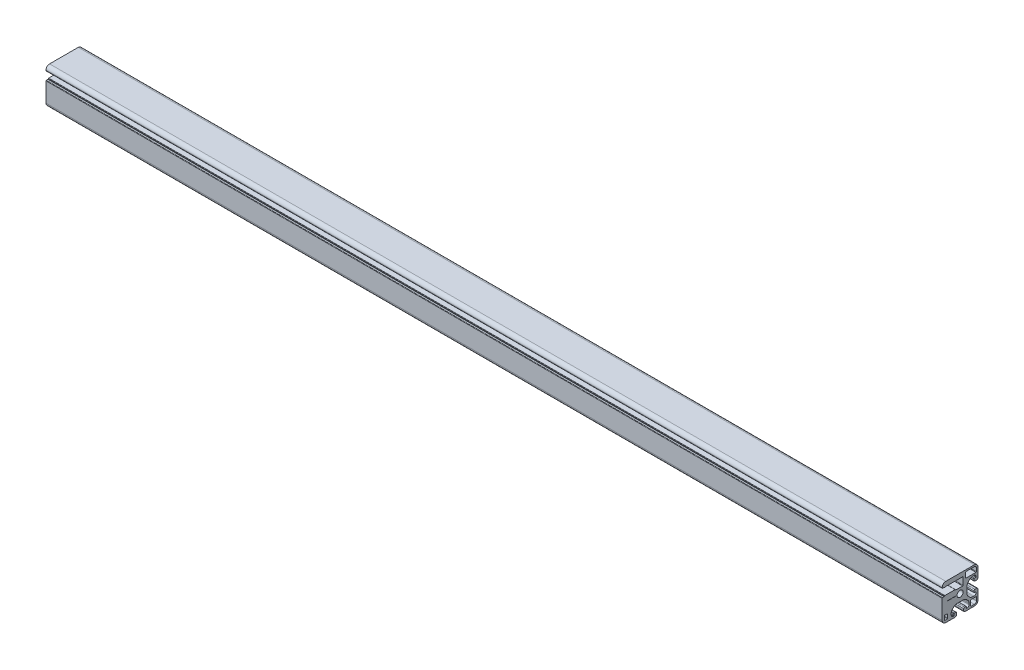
ISO-10303-21;
HEADER;
FILE_DESCRIPTION(('STEP AP214'),'2;1');
FILE_NAME('part.step','',(''),(''),'','','');
FILE_SCHEMA(('AUTOMOTIVE_DESIGN { 1 0 10303 214 1 1 1 1 }'));
ENDSEC;
DATA;
#1=APPLICATION_CONTEXT('core data for automotive mechanical design processes');
#2=APPLICATION_PROTOCOL_DEFINITION('international standard','automotive_design',2000,#1);
#3=PRODUCT_CONTEXT('',#1,'mechanical');
#4=PRODUCT('Part','Part','',(#3));
#5=PRODUCT_RELATED_PRODUCT_CATEGORY('part','',(#4));
#6=PRODUCT_DEFINITION_FORMATION('','',#4);
#7=PRODUCT_DEFINITION_CONTEXT('part definition',#1,'design');
#8=PRODUCT_DEFINITION('design','',#6,#7);
#9=PRODUCT_DEFINITION_SHAPE('','',#8);
#10=(LENGTH_UNIT() NAMED_UNIT(*) SI_UNIT(.MILLI.,.METRE.));
#11=(NAMED_UNIT(*) PLANE_ANGLE_UNIT() SI_UNIT($,.RADIAN.));
#12=(NAMED_UNIT(*) SI_UNIT($,.STERADIAN.) SOLID_ANGLE_UNIT());
#13=UNCERTAINTY_MEASURE_WITH_UNIT(LENGTH_MEASURE(1.E-05),#10,'distance_accuracy_value','');
#14=(GEOMETRIC_REPRESENTATION_CONTEXT(3) GLOBAL_UNCERTAINTY_ASSIGNED_CONTEXT((#13)) GLOBAL_UNIT_ASSIGNED_CONTEXT((#10,
#11,#12)) REPRESENTATION_CONTEXT('',''));
#15=CARTESIAN_POINT('',(0.,0.,0.));
#16=DIRECTION('',(0.,0.,1.));
#17=DIRECTION('',(1.,0.,0.));
#18=AXIS2_PLACEMENT_3D('',#15,#16,#17);
#19=CARTESIAN_POINT('',(1000.,-12.73087803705,3.55227627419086));
#20=DIRECTION('',(-1.,0.,0.));
#21=DIRECTION('',(0.,0.,1.));
#22=AXIS2_PLACEMENT_3D('',#19,#20,#21);
#23=CYLINDRICAL_SURFACE('',#22,4.992501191);
#24=CARTESIAN_POINT('',(0.,-12.73087803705,3.55227627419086));
#25=DIRECTION('',(-1.,0.,0.));
#26=DIRECTION('',(0.,0.,-1.));
#27=AXIS2_PLACEMENT_3D('',#24,#25,#26);
#28=CIRCLE('',#27,4.992501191);
#29=CARTESIAN_POINT('',(0.,-9.20064658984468,7.08250772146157));
#30=VERTEX_POINT('',#29);
#31=CARTESIAN_POINT('',(0.,-7.73837684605,3.55227627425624));
#32=VERTEX_POINT('',#31);
#33=EDGE_CURVE('E1212',#30,#32,#28,.T.);
#34=ORIENTED_EDGE('',*,*,#33,.T.);
#35=DIRECTION('',(-1.,0.,0.));
#36=VECTOR('',#35,1.);
#37=CARTESIAN_POINT('',(1000.,-7.73837684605,3.55227627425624));
#38=LINE('',#37,#36);
#39=CARTESIAN_POINT('',(1000.,-7.73837684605,3.55227627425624));
#40=VERTEX_POINT('',#39);
#41=EDGE_CURVE('E12',#40,#32,#38,.T.);
#42=ORIENTED_EDGE('',*,*,#41,.F.);
#43=CARTESIAN_POINT('',(1000.,-12.73087803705,3.55227627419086));
#44=DIRECTION('',(-1.,0.,0.));
#45=DIRECTION('',(0.,0.,-1.));
#46=AXIS2_PLACEMENT_3D('',#43,#44,#45);
#47=CIRCLE('',#46,4.992501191);
#48=CARTESIAN_POINT('',(1000.,-9.20064658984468,7.08250772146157));
#49=VERTEX_POINT('',#48);
#50=EDGE_CURVE('E1834',#49,#40,#47,.T.);
#51=ORIENTED_EDGE('',*,*,#50,.F.);
#52=DIRECTION('',(-1.,0.,0.));
#53=VECTOR('',#52,1.);
#54=CARTESIAN_POINT('',(1000.,-9.20064658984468,7.08250772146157));
#55=LINE('',#54,#53);
#56=EDGE_CURVE('E1407',#49,#30,#55,.T.);
#57=ORIENTED_EDGE('',*,*,#56,.T.);
#58=EDGE_LOOP('',(#34,#42,#51,#57));
#59=FACE_BOUND('',#58,.T.);
#60=ADVANCED_FACE('F335',(#59),#23,.F.);
#61=CARTESIAN_POINT('',(1000.,-7.73837684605,3.55227627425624));
#62=DIRECTION('',(0.,1.,0.));
#63=DIRECTION('',(0.,0.,1.));
#64=AXIS2_PLACEMENT_3D('',#61,#62,#63);
#65=PLANE('',#64);
#66=DIRECTION('',(0.,0.,-1.));
#67=VECTOR('',#66,1.);
#68=CARTESIAN_POINT('',(0.,-7.73837684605,3.55227627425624));
#69=LINE('',#68,#67);
#70=CARTESIAN_POINT('',(0.,-7.73837684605,-3.55227627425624));
#71=VERTEX_POINT('',#70);
#72=EDGE_CURVE('E1215',#32,#71,#69,.T.);
#73=ORIENTED_EDGE('',*,*,#72,.T.);
#74=DIRECTION('',(-1.,0.,0.));
#75=VECTOR('',#74,1.);
#76=CARTESIAN_POINT('',(1000.,-7.73837684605,-3.55227627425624));
#77=LINE('',#76,#75);
#78=CARTESIAN_POINT('',(1000.,-7.73837684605,-3.55227627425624));
#79=VERTEX_POINT('',#78);
#80=EDGE_CURVE('E345',#79,#71,#77,.T.);
#81=ORIENTED_EDGE('',*,*,#80,.F.);
#82=DIRECTION('',(0.,0.,-1.));
#83=VECTOR('',#82,1.);
#84=CARTESIAN_POINT('',(1000.,-7.73837684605,3.55227627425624));
#85=LINE('',#84,#83);
#86=EDGE_CURVE('E1836',#40,#79,#85,.T.);
#87=ORIENTED_EDGE('',*,*,#86,.F.);
#88=ORIENTED_EDGE('',*,*,#41,.T.);
#89=EDGE_LOOP('',(#73,#81,#87,#88));
#90=FACE_BOUND('',#89,.T.);
#91=ADVANCED_FACE('F2052',(#90),#65,.F.);
#92=CARTESIAN_POINT('',(1000.,-12.73087803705,-3.55227627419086));
#93=DIRECTION('',(-1.,0.,0.));
#94=DIRECTION('',(0.,0.,1.));
#95=AXIS2_PLACEMENT_3D('',#92,#93,#94);
#96=CYLINDRICAL_SURFACE('',#95,4.992501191);
#97=CARTESIAN_POINT('',(0.,-12.73087803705,-3.55227627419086));
#98=DIRECTION('',(-1.,0.,0.));
#99=DIRECTION('',(0.,0.,-1.));
#100=AXIS2_PLACEMENT_3D('',#97,#98,#99);
#101=CIRCLE('',#100,4.992501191);
#102=CARTESIAN_POINT('',(0.,-9.20064658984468,-7.08250772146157));
#103=VERTEX_POINT('',#102);
#104=EDGE_CURVE('E1217',#71,#103,#101,.T.);
#105=ORIENTED_EDGE('',*,*,#104,.T.);
#106=DIRECTION('',(-1.,0.,0.));
#107=VECTOR('',#106,1.);
#108=CARTESIAN_POINT('',(1000.,-9.20064658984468,-7.08250772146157));
#109=LINE('',#108,#107);
#110=CARTESIAN_POINT('',(1000.,-9.20064658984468,-7.08250772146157));
#111=VERTEX_POINT('',#110);
#112=EDGE_CURVE('E1685',#111,#103,#109,.T.);
#113=ORIENTED_EDGE('',*,*,#112,.F.);
#114=CARTESIAN_POINT('',(1000.,-12.73087803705,-3.55227627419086));
#115=DIRECTION('',(-1.,0.,0.));
#116=DIRECTION('',(0.,0.,-1.));
#117=AXIS2_PLACEMENT_3D('',#114,#115,#116);
#118=CIRCLE('',#117,4.992501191);
#119=EDGE_CURVE('E1838',#79,#111,#118,.T.);
#120=ORIENTED_EDGE('',*,*,#119,.F.);
#121=ORIENTED_EDGE('',*,*,#80,.T.);
#122=EDGE_LOOP('',(#105,#113,#120,#121));
#123=FACE_BOUND('',#122,.T.);
#124=ADVANCED_FACE('F2057',(#123),#96,.F.);
#125=CARTESIAN_POINT('',(1000.,-9.20064658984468,-7.08250772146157));
#126=DIRECTION('',(0.,0.707106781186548,-0.707106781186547));
#127=DIRECTION('',(0.,0.707106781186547,0.707106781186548));
#128=AXIS2_PLACEMENT_3D('',#125,#126,#127);
#129=PLANE('',#128);
#130=DIRECTION('',(0.,-0.707106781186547,-0.707106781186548));
#131=VECTOR('',#130,1.);
#132=CARTESIAN_POINT('',(0.,-9.20064658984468,-7.08250772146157));
#133=LINE('',#132,#131);
#134=CARTESIAN_POINT('',(0.,-10.6408715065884,-8.52273263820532));
#135=VERTEX_POINT('',#134);
#136=EDGE_CURVE('E1219',#103,#135,#133,.T.);
#137=ORIENTED_EDGE('',*,*,#136,.T.);
#138=DIRECTION('',(-1.,0.,0.));
#139=VECTOR('',#138,1.);
#140=CARTESIAN_POINT('',(1000.,-10.6408715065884,-8.52273263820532));
#141=LINE('',#140,#139);
#142=CARTESIAN_POINT('',(1000.,-10.6408715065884,-8.52273263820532));
#143=VERTEX_POINT('',#142);
#144=EDGE_CURVE('E1682',#143,#135,#141,.T.);
#145=ORIENTED_EDGE('',*,*,#144,.F.);
#146=DIRECTION('',(0.,-0.707106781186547,-0.707106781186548));
#147=VECTOR('',#146,1.);
#148=CARTESIAN_POINT('',(1000.,-9.20064658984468,-7.08250772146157));
#149=LINE('',#148,#147);
#150=EDGE_CURVE('E1840',#111,#143,#149,.T.);
#151=ORIENTED_EDGE('',*,*,#150,.F.);
#152=ORIENTED_EDGE('',*,*,#112,.T.);
#153=EDGE_LOOP('',(#137,#145,#151,#152));
#154=FACE_BOUND('',#153,.T.);
#155=ADVANCED_FACE('F2948',(#154),#129,.F.);
#156=CARTESIAN_POINT('',(1000.,-14.1711029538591,-4.992501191));
#157=DIRECTION('',(-1.,0.,0.));
#158=DIRECTION('',(0.,0.,1.));
#159=AXIS2_PLACEMENT_3D('',#156,#157,#158);
#160=CYLINDRICAL_SURFACE('',#159,4.992501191);
#161=CARTESIAN_POINT('',(0.,-14.1711029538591,-4.992501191));
#162=DIRECTION('',(-1.,0.,0.));
#163=DIRECTION('',(0.,0.,-1.));
#164=AXIS2_PLACEMENT_3D('',#161,#162,#163);
#165=CIRCLE('',#164,4.992501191);
#166=CARTESIAN_POINT('',(0.,-14.1711029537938,-9.985002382));
#167=VERTEX_POINT('',#166);
#168=EDGE_CURVE('E1221',#135,#167,#165,.T.);
#169=ORIENTED_EDGE('',*,*,#168,.T.);
#170=DIRECTION('',(-1.,0.,0.));
#171=VECTOR('',#170,1.);
#172=CARTESIAN_POINT('',(1000.,-14.1711029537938,-9.985002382));
#173=LINE('',#172,#171);
#174=CARTESIAN_POINT('',(1000.,-14.1711029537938,-9.985002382));
#175=VERTEX_POINT('',#174);
#176=EDGE_CURVE('E1679',#175,#167,#173,.T.);
#177=ORIENTED_EDGE('',*,*,#176,.F.);
#178=CARTESIAN_POINT('',(1000.,-14.1711029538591,-4.992501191));
#179=DIRECTION('',(-1.,0.,0.));
#180=DIRECTION('',(0.,0.,-1.));
#181=AXIS2_PLACEMENT_3D('',#178,#179,#180);
#182=CIRCLE('',#181,4.992501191);
#183=EDGE_CURVE('E1842',#143,#175,#182,.T.);
#184=ORIENTED_EDGE('',*,*,#183,.F.);
#185=ORIENTED_EDGE('',*,*,#144,.T.);
#186=EDGE_LOOP('',(#169,#177,#184,#185));
#187=FACE_BOUND('',#186,.T.);
#188=ADVANCED_FACE('F2940',(#187),#160,.F.);
#189=CARTESIAN_POINT('',(1000.,-14.1711029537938,-9.985002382));
#190=DIRECTION('',(0.,0.,-1.));
#191=DIRECTION('',(-1.,0.,0.));
#192=AXIS2_PLACEMENT_3D('',#189,#190,#191);
#193=PLANE('',#192);
#194=DIRECTION('',(0.,-1.,0.));
#195=VECTOR('',#194,1.);
#196=CARTESIAN_POINT('',(0.,-14.1711029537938,-9.985002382));
#197=LINE('',#196,#195);
#198=CARTESIAN_POINT('',(0.,-15.4767536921,-9.985002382));
#199=VERTEX_POINT('',#198);
#200=EDGE_CURVE('E1223',#167,#199,#197,.T.);
#201=ORIENTED_EDGE('',*,*,#200,.T.);
#202=DIRECTION('',(-1.,0.,0.));
#203=VECTOR('',#202,1.);
#204=CARTESIAN_POINT('',(1000.,-15.4767536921,-9.985002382));
#205=LINE('',#204,#203);
#206=CARTESIAN_POINT('',(1000.,-15.4767536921,-9.985002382));
#207=VERTEX_POINT('',#206);
#208=EDGE_CURVE('E1676',#207,#199,#205,.T.);
#209=ORIENTED_EDGE('',*,*,#208,.F.);
#210=DIRECTION('',(0.,-1.,0.));
#211=VECTOR('',#210,1.);
#212=CARTESIAN_POINT('',(1000.,-14.1711029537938,-9.985002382));
#213=LINE('',#212,#211);
#214=EDGE_CURVE('E1844',#175,#207,#213,.T.);
#215=ORIENTED_EDGE('',*,*,#214,.F.);
#216=ORIENTED_EDGE('',*,*,#176,.T.);
#217=EDGE_LOOP('',(#201,#209,#215,#216));
#218=FACE_BOUND('',#217,.T.);
#219=ADVANCED_FACE('F2932',(#218),#193,.F.);
#220=CARTESIAN_POINT('',(1000.,-15.4767536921,-7.4887517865));
#221=DIRECTION('',(-1.,0.,0.));
#222=DIRECTION('',(0.,0.,1.));
#223=AXIS2_PLACEMENT_3D('',#220,#221,#222);
#224=CYLINDRICAL_SURFACE('',#223,2.4962505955);
#225=CARTESIAN_POINT('',(0.,-15.4767536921,-7.4887517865));
#226=DIRECTION('',(-1.,0.,0.));
#227=DIRECTION('',(0.,0.,-1.));
#228=AXIS2_PLACEMENT_3D('',#225,#226,#227);
#229=CIRCLE('',#228,2.4962505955);
#230=CARTESIAN_POINT('',(0.,-17.9730042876,-7.4887517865));
#231=VERTEX_POINT('',#230);
#232=EDGE_CURVE('E1225',#199,#231,#229,.T.);
#233=ORIENTED_EDGE('',*,*,#232,.T.);
#234=DIRECTION('',(-1.,0.,0.));
#235=VECTOR('',#234,1.);
#236=CARTESIAN_POINT('',(1000.,-17.9730042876,-7.4887517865));
#237=LINE('',#236,#235);
#238=CARTESIAN_POINT('',(1000.,-17.9730042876,-7.4887517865));
#239=VERTEX_POINT('',#238);
#240=EDGE_CURVE('E1673',#239,#231,#237,.T.);
#241=ORIENTED_EDGE('',*,*,#240,.F.);
#242=CARTESIAN_POINT('',(1000.,-15.4767536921,-7.4887517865));
#243=DIRECTION('',(-1.,0.,0.));
#244=DIRECTION('',(0.,0.,-1.));
#245=AXIS2_PLACEMENT_3D('',#242,#243,#244);
#246=CIRCLE('',#245,2.4962505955);
#247=EDGE_CURVE('E1846',#207,#239,#246,.T.);
#248=ORIENTED_EDGE('',*,*,#247,.F.);
#249=ORIENTED_EDGE('',*,*,#208,.T.);
#250=EDGE_LOOP('',(#233,#241,#248,#249));
#251=FACE_BOUND('',#250,.T.);
#252=ADVANCED_FACE('F2924',(#251),#224,.F.);
#253=CARTESIAN_POINT('',(1000.,-17.4737541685,-7.4887517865));
#254=DIRECTION('',(-1.,0.,0.));
#255=DIRECTION('',(0.,0.,1.));
#256=AXIS2_PLACEMENT_3D('',#253,#254,#255);
#257=CYLINDRICAL_SURFACE('',#256,0.4992501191);
#258=CARTESIAN_POINT('',(0.,-17.4737541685,-7.4887517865));
#259=DIRECTION('',(-1.,0.,0.));
#260=DIRECTION('',(0.,0.,-1.));
#261=AXIS2_PLACEMENT_3D('',#258,#259,#260);
#262=CIRCLE('',#261,0.4992501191);
#263=CARTESIAN_POINT('',(0.,-17.4737541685,-6.9895016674));
#264=VERTEX_POINT('',#263);
#265=EDGE_CURVE('E1227',#231,#264,#262,.T.);
#266=ORIENTED_EDGE('',*,*,#265,.T.);
#267=DIRECTION('',(-1.,0.,0.));
#268=VECTOR('',#267,1.);
#269=CARTESIAN_POINT('',(1000.,-17.4737541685,-6.9895016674));
#270=LINE('',#269,#268);
#271=CARTESIAN_POINT('',(1000.,-17.4737541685,-6.9895016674));
#272=VERTEX_POINT('',#271);
#273=EDGE_CURVE('E1670',#272,#264,#270,.T.);
#274=ORIENTED_EDGE('',*,*,#273,.F.);
#275=CARTESIAN_POINT('',(1000.,-17.4737541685,-7.4887517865));
#276=DIRECTION('',(-1.,0.,0.));
#277=DIRECTION('',(0.,0.,-1.));
#278=AXIS2_PLACEMENT_3D('',#275,#276,#277);
#279=CIRCLE('',#278,0.4992501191);
#280=EDGE_CURVE('E1848',#239,#272,#279,.T.);
#281=ORIENTED_EDGE('',*,*,#280,.F.);
#282=ORIENTED_EDGE('',*,*,#240,.T.);
#283=EDGE_LOOP('',(#266,#274,#281,#282));
#284=FACE_BOUND('',#283,.T.);
#285=ADVANCED_FACE('F2916',(#284),#257,.F.);
#286=CARTESIAN_POINT('',(1000.,-17.4737541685,-6.9895016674));
#287=DIRECTION('',(0.,0.,1.));
#288=DIRECTION('',(1.,0.,0.));
#289=AXIS2_PLACEMENT_3D('',#286,#287,#288);
#290=PLANE('',#289);
#291=DIRECTION('',(0.,1.,0.));
#292=VECTOR('',#291,1.);
#293=CARTESIAN_POINT('',(0.,-17.4737541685,-6.9895016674));
#294=LINE('',#293,#292);
#295=CARTESIAN_POINT('',(0.,-15.9760038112,-6.9895016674));
#296=VERTEX_POINT('',#295);
#297=EDGE_CURVE('E1229',#264,#296,#294,.T.);
#298=ORIENTED_EDGE('',*,*,#297,.T.);
#299=DIRECTION('',(-1.,0.,0.));
#300=VECTOR('',#299,1.);
#301=CARTESIAN_POINT('',(1000.,-15.9760038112,-6.9895016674));
#302=LINE('',#301,#300);
#303=CARTESIAN_POINT('',(1000.,-15.9760038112,-6.9895016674));
#304=VERTEX_POINT('',#303);
#305=EDGE_CURVE('E1667',#304,#296,#302,.T.);
#306=ORIENTED_EDGE('',*,*,#305,.F.);
#307=DIRECTION('',(0.,1.,0.));
#308=VECTOR('',#307,1.);
#309=CARTESIAN_POINT('',(1000.,-17.4737541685,-6.9895016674));
#310=LINE('',#309,#308);
#311=EDGE_CURVE('E1850',#272,#304,#310,.T.);
#312=ORIENTED_EDGE('',*,*,#311,.F.);
#313=ORIENTED_EDGE('',*,*,#273,.T.);
#314=EDGE_LOOP('',(#298,#306,#312,#313));
#315=FACE_BOUND('',#314,.T.);
#316=ADVANCED_FACE('F2908',(#315),#290,.F.);
#317=CARTESIAN_POINT('',(1000.,-15.9760038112,-6.4902515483));
#318=DIRECTION('',(-1.,0.,0.));
#319=DIRECTION('',(0.,0.,1.));
#320=AXIS2_PLACEMENT_3D('',#317,#318,#319);
#321=CYLINDRICAL_SURFACE('',#320,0.4992501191);
#322=CARTESIAN_POINT('',(0.,-15.9760038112,-6.4902515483));
#323=DIRECTION('',(1.,0.,0.));
#324=DIRECTION('',(0.,0.,-1.));
#325=AXIS2_PLACEMENT_3D('',#322,#323,#324);
#326=CIRCLE('',#325,0.4992501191);
#327=CARTESIAN_POINT('',(0.,-15.4767536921,-6.4902515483));
#328=VERTEX_POINT('',#327);
#329=EDGE_CURVE('E1231',#296,#328,#326,.T.);
#330=ORIENTED_EDGE('',*,*,#329,.T.);
#331=DIRECTION('',(-1.,0.,0.));
#332=VECTOR('',#331,1.);
#333=CARTESIAN_POINT('',(1000.,-15.4767536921,-6.4902515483));
#334=LINE('',#333,#332);
#335=CARTESIAN_POINT('',(1000.,-15.4767536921,-6.4902515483));
#336=VERTEX_POINT('',#335);
#337=EDGE_CURVE('E1664',#336,#328,#334,.T.);
#338=ORIENTED_EDGE('',*,*,#337,.F.);
#339=CARTESIAN_POINT('',(1000.,-15.9760038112,-6.4902515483));
#340=DIRECTION('',(1.,0.,0.));
#341=DIRECTION('',(0.,0.,-1.));
#342=AXIS2_PLACEMENT_3D('',#339,#340,#341);
#343=CIRCLE('',#342,0.4992501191);
#344=EDGE_CURVE('E1852',#304,#336,#343,.T.);
#345=ORIENTED_EDGE('',*,*,#344,.F.);
#346=ORIENTED_EDGE('',*,*,#305,.T.);
#347=EDGE_LOOP('',(#330,#338,#345,#346));
#348=FACE_BOUND('',#347,.T.);
#349=ADVANCED_FACE('F2900',(#348),#321,.T.);
#350=CARTESIAN_POINT('',(1000.,-15.4767536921,-6.4902515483));
#351=DIRECTION('',(0.,-1.,0.));
#352=DIRECTION('',(0.,0.,-1.));
#353=AXIS2_PLACEMENT_3D('',#350,#351,#352);
#354=PLANE('',#353);
#355=DIRECTION('',(0.,0.,1.));
#356=VECTOR('',#355,1.);
#357=CARTESIAN_POINT('',(0.,-15.4767536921,-6.4902515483));
#358=LINE('',#357,#356);
#359=CARTESIAN_POINT('',(0.,-15.4767536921,-4.992501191));
#360=VERTEX_POINT('',#359);
#361=EDGE_CURVE('E1233',#328,#360,#358,.T.);
#362=ORIENTED_EDGE('',*,*,#361,.T.);
#363=DIRECTION('',(-1.,0.,0.));
#364=VECTOR('',#363,1.);
#365=CARTESIAN_POINT('',(1000.,-15.4767536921,-4.992501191));
#366=LINE('',#365,#364);
#367=CARTESIAN_POINT('',(1000.,-15.4767536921,-4.992501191));
#368=VERTEX_POINT('',#367);
#369=EDGE_CURVE('E1661',#368,#360,#366,.T.);
#370=ORIENTED_EDGE('',*,*,#369,.F.);
#371=DIRECTION('',(0.,0.,1.));
#372=VECTOR('',#371,1.);
#373=CARTESIAN_POINT('',(1000.,-15.4767536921,-6.4902515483));
#374=LINE('',#373,#372);
#375=EDGE_CURVE('E1854',#336,#368,#374,.T.);
#376=ORIENTED_EDGE('',*,*,#375,.F.);
#377=ORIENTED_EDGE('',*,*,#337,.T.);
#378=EDGE_LOOP('',(#362,#370,#376,#377));
#379=FACE_BOUND('',#378,.T.);
#380=ADVANCED_FACE('F2892',(#379),#354,.F.);
#381=CARTESIAN_POINT('',(1000.,-16.4752539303,-4.992501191));
#382=DIRECTION('',(-1.,0.,0.));
#383=DIRECTION('',(0.,0.,1.));
#384=AXIS2_PLACEMENT_3D('',#381,#382,#383);
#385=CYLINDRICAL_SURFACE('',#384,0.9985002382);
#386=CARTESIAN_POINT('',(0.,-16.4752539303,-4.992501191));
#387=DIRECTION('',(1.,0.,0.));
#388=DIRECTION('',(0.,0.,-1.));
#389=AXIS2_PLACEMENT_3D('',#386,#387,#388);
#390=CIRCLE('',#389,0.9985002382);
#391=CARTESIAN_POINT('',(0.,-16.4752539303,-3.9940009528));
#392=VERTEX_POINT('',#391);
#393=EDGE_CURVE('E1235',#360,#392,#390,.T.);
#394=ORIENTED_EDGE('',*,*,#393,.T.);
#395=DIRECTION('',(-1.,0.,0.));
#396=VECTOR('',#395,1.);
#397=CARTESIAN_POINT('',(1000.,-16.4752539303,-3.9940009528));
#398=LINE('',#397,#396);
#399=CARTESIAN_POINT('',(1000.,-16.4752539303,-3.9940009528));
#400=VERTEX_POINT('',#399);
#401=EDGE_CURVE('E1658',#400,#392,#398,.T.);
#402=ORIENTED_EDGE('',*,*,#401,.F.);
#403=CARTESIAN_POINT('',(1000.,-16.4752539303,-4.992501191));
#404=DIRECTION('',(1.,0.,0.));
#405=DIRECTION('',(0.,0.,-1.));
#406=AXIS2_PLACEMENT_3D('',#403,#404,#405);
#407=CIRCLE('',#406,0.9985002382);
#408=EDGE_CURVE('E1856',#368,#400,#407,.T.);
#409=ORIENTED_EDGE('',*,*,#408,.F.);
#410=ORIENTED_EDGE('',*,*,#369,.T.);
#411=EDGE_LOOP('',(#394,#402,#409,#410));
#412=FACE_BOUND('',#411,.T.);
#413=ADVANCED_FACE('F2884',(#412),#385,.T.);
#414=CARTESIAN_POINT('',(1000.,-16.4752539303,-3.9940009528));
#415=DIRECTION('',(0.,0.,-1.));
#416=DIRECTION('',(-1.,0.,0.));
#417=AXIS2_PLACEMENT_3D('',#414,#415,#416);
#418=PLANE('',#417);
#419=DIRECTION('',(0.,-1.,0.));
#420=VECTOR('',#419,1.);
#421=CARTESIAN_POINT('',(0.,-16.4752539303,-3.9940009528));
#422=LINE('',#421,#420);
#423=CARTESIAN_POINT('',(0.,-18.4722544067,-3.9940009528));
#424=VERTEX_POINT('',#423);
#425=EDGE_CURVE('E1237',#392,#424,#422,.T.);
#426=ORIENTED_EDGE('',*,*,#425,.T.);
#427=DIRECTION('',(-1.,0.,0.));
#428=VECTOR('',#427,1.);
#429=CARTESIAN_POINT('',(1000.,-18.4722544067,-3.9940009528));
#430=LINE('',#429,#428);
#431=CARTESIAN_POINT('',(1000.,-18.4722544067,-3.9940009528));
#432=VERTEX_POINT('',#431);
#433=EDGE_CURVE('E1655',#432,#424,#430,.T.);
#434=ORIENTED_EDGE('',*,*,#433,.F.);
#435=DIRECTION('',(0.,-1.,0.));
#436=VECTOR('',#435,1.);
#437=CARTESIAN_POINT('',(1000.,-16.4752539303,-3.9940009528));
#438=LINE('',#437,#436);
#439=EDGE_CURVE('E1858',#400,#432,#438,.T.);
#440=ORIENTED_EDGE('',*,*,#439,.F.);
#441=ORIENTED_EDGE('',*,*,#401,.T.);
#442=EDGE_LOOP('',(#426,#434,#440,#441));
#443=FACE_BOUND('',#442,.T.);
#444=ADVANCED_FACE('F2876',(#443),#418,.F.);
#445=CARTESIAN_POINT('',(1000.,-18.4722544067,-5.4917513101));
#446=DIRECTION('',(-1.,0.,0.));
#447=DIRECTION('',(0.,0.,1.));
#448=AXIS2_PLACEMENT_3D('',#445,#446,#447);
#449=CYLINDRICAL_SURFACE('',#448,1.4977503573);
#450=CARTESIAN_POINT('',(0.,-18.4722544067,-5.4917513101));
#451=DIRECTION('',(1.,0.,0.));
#452=DIRECTION('',(0.,0.,-1.));
#453=AXIS2_PLACEMENT_3D('',#450,#451,#452);
#454=CIRCLE('',#453,1.4977503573);
#455=CARTESIAN_POINT('',(0.,-19.970004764,-5.4917513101));
#456=VERTEX_POINT('',#455);
#457=EDGE_CURVE('E1239',#424,#456,#454,.T.);
#458=ORIENTED_EDGE('',*,*,#457,.T.);
#459=DIRECTION('',(-1.,0.,0.));
#460=VECTOR('',#459,1.);
#461=CARTESIAN_POINT('',(1000.,-19.970004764,-5.4917513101));
#462=LINE('',#461,#460);
#463=CARTESIAN_POINT('',(1000.,-19.970004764,-5.4917513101));
#464=VERTEX_POINT('',#463);
#465=EDGE_CURVE('E1652',#464,#456,#462,.T.);
#466=ORIENTED_EDGE('',*,*,#465,.F.);
#467=CARTESIAN_POINT('',(1000.,-18.4722544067,-5.4917513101));
#468=DIRECTION('',(1.,0.,0.));
#469=DIRECTION('',(0.,0.,-1.));
#470=AXIS2_PLACEMENT_3D('',#467,#468,#469);
#471=CIRCLE('',#470,1.4977503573);
#472=EDGE_CURVE('E1860',#432,#464,#471,.T.);
#473=ORIENTED_EDGE('',*,*,#472,.F.);
#474=ORIENTED_EDGE('',*,*,#433,.T.);
#475=EDGE_LOOP('',(#458,#466,#473,#474));
#476=FACE_BOUND('',#475,.T.);
#477=ADVANCED_FACE('F2868',(#476),#449,.T.);
#478=CARTESIAN_POINT('',(1000.,-19.970004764,-5.4917513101));
#479=DIRECTION('',(0.,1.,0.));
#480=DIRECTION('',(0.,0.,1.));
#481=AXIS2_PLACEMENT_3D('',#478,#479,#480);
#482=PLANE('',#481);
#483=DIRECTION('',(0.,0.,-1.));
#484=VECTOR('',#483,1.);
#485=CARTESIAN_POINT('',(0.,-19.970004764,-5.4917513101));
#486=LINE('',#485,#484);
#487=CARTESIAN_POINT('',(0.,-19.970004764,-15.9760038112));
#488=VERTEX_POINT('',#487);
#489=EDGE_CURVE('E1241',#456,#488,#486,.T.);
#490=ORIENTED_EDGE('',*,*,#489,.T.);
#491=DIRECTION('',(-1.,0.,0.));
#492=VECTOR('',#491,1.);
#493=CARTESIAN_POINT('',(1000.,-19.970004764,-15.9760038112));
#494=LINE('',#493,#492);
#495=CARTESIAN_POINT('',(1000.,-19.970004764,-15.9760038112));
#496=VERTEX_POINT('',#495);
#497=EDGE_CURVE('E1649',#496,#488,#494,.T.);
#498=ORIENTED_EDGE('',*,*,#497,.F.);
#499=DIRECTION('',(0.,0.,-1.));
#500=VECTOR('',#499,1.);
#501=CARTESIAN_POINT('',(1000.,-19.970004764,-5.4917513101));
#502=LINE('',#501,#500);
#503=EDGE_CURVE('E1862',#464,#496,#502,.T.);
#504=ORIENTED_EDGE('',*,*,#503,.F.);
#505=ORIENTED_EDGE('',*,*,#465,.T.);
#506=EDGE_LOOP('',(#490,#498,#504,#505));
#507=FACE_BOUND('',#506,.T.);
#508=ADVANCED_FACE('F2860',(#507),#482,.F.);
#509=CARTESIAN_POINT('',(1000.,-15.9760038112,-15.9760038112));
#510=DIRECTION('',(-1.,0.,0.));
#511=DIRECTION('',(0.,0.,1.));
#512=AXIS2_PLACEMENT_3D('',#509,#510,#511);
#513=CYLINDRICAL_SURFACE('',#512,3.9940009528);
#514=CARTESIAN_POINT('',(0.,-15.9760038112,-15.9760038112));
#515=DIRECTION('',(1.,0.,0.));
#516=DIRECTION('',(0.,0.,-1.));
#517=AXIS2_PLACEMENT_3D('',#514,#515,#516);
#518=CIRCLE('',#517,3.9940009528);
#519=CARTESIAN_POINT('',(0.,-15.9760038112,-19.970004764));
#520=VERTEX_POINT('',#519);
#521=EDGE_CURVE('E1243',#488,#520,#518,.T.);
#522=ORIENTED_EDGE('',*,*,#521,.T.);
#523=DIRECTION('',(-1.,0.,0.));
#524=VECTOR('',#523,1.);
#525=CARTESIAN_POINT('',(1000.,-15.9760038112,-19.970004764));
#526=LINE('',#525,#524);
#527=CARTESIAN_POINT('',(1000.,-15.9760038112,-19.970004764));
#528=VERTEX_POINT('',#527);
#529=EDGE_CURVE('E1646',#528,#520,#526,.T.);
#530=ORIENTED_EDGE('',*,*,#529,.F.);
#531=CARTESIAN_POINT('',(1000.,-15.9760038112,-15.9760038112));
#532=DIRECTION('',(1.,0.,0.));
#533=DIRECTION('',(0.,0.,-1.));
#534=AXIS2_PLACEMENT_3D('',#531,#532,#533);
#535=CIRCLE('',#534,3.9940009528);
#536=EDGE_CURVE('E1864',#496,#528,#535,.T.);
#537=ORIENTED_EDGE('',*,*,#536,.F.);
#538=ORIENTED_EDGE('',*,*,#497,.T.);
#539=EDGE_LOOP('',(#522,#530,#537,#538));
#540=FACE_BOUND('',#539,.T.);
#541=ADVANCED_FACE('F2852',(#540),#513,.T.);
#542=CARTESIAN_POINT('',(1000.,-15.9760038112,-19.970004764));
#543=DIRECTION('',(0.,0.,1.));
#544=DIRECTION('',(1.,0.,0.));
#545=AXIS2_PLACEMENT_3D('',#542,#543,#544);
#546=PLANE('',#545);
#547=DIRECTION('',(0.,1.,0.));
#548=VECTOR('',#547,1.);
#549=CARTESIAN_POINT('',(0.,-15.9760038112,-19.970004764));
#550=LINE('',#549,#548);
#551=CARTESIAN_POINT('',(0.,-5.4917513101,-19.970004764));
#552=VERTEX_POINT('',#551);
#553=EDGE_CURVE('E1245',#520,#552,#550,.T.);
#554=ORIENTED_EDGE('',*,*,#553,.T.);
#555=DIRECTION('',(-1.,0.,0.));
#556=VECTOR('',#555,1.);
#557=CARTESIAN_POINT('',(1000.,-5.4917513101,-19.970004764));
#558=LINE('',#557,#556);
#559=CARTESIAN_POINT('',(1000.,-5.4917513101,-19.970004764));
#560=VERTEX_POINT('',#559);
#561=EDGE_CURVE('E1643',#560,#552,#558,.T.);
#562=ORIENTED_EDGE('',*,*,#561,.F.);
#563=DIRECTION('',(0.,1.,0.));
#564=VECTOR('',#563,1.);
#565=CARTESIAN_POINT('',(1000.,-15.9760038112,-19.970004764));
#566=LINE('',#565,#564);
#567=EDGE_CURVE('E1866',#528,#560,#566,.T.);
#568=ORIENTED_EDGE('',*,*,#567,.F.);
#569=ORIENTED_EDGE('',*,*,#529,.T.);
#570=EDGE_LOOP('',(#554,#562,#568,#569));
#571=FACE_BOUND('',#570,.T.);
#572=ADVANCED_FACE('F2844',(#571),#546,.F.);
#573=CARTESIAN_POINT('',(1000.,-5.4917513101,-18.4722544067));
#574=DIRECTION('',(-1.,0.,0.));
#575=DIRECTION('',(0.,0.,1.));
#576=AXIS2_PLACEMENT_3D('',#573,#574,#575);
#577=CYLINDRICAL_SURFACE('',#576,1.4977503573);
#578=CARTESIAN_POINT('',(0.,-5.4917513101,-18.4722544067));
#579=DIRECTION('',(1.,0.,0.));
#580=DIRECTION('',(0.,0.,-1.));
#581=AXIS2_PLACEMENT_3D('',#578,#579,#580);
#582=CIRCLE('',#581,1.4977503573);
#583=CARTESIAN_POINT('',(0.,-3.9940009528,-18.4722544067));
#584=VERTEX_POINT('',#583);
#585=EDGE_CURVE('E1247',#552,#584,#582,.T.);
#586=ORIENTED_EDGE('',*,*,#585,.T.);
#587=DIRECTION('',(-1.,0.,0.));
#588=VECTOR('',#587,1.);
#589=CARTESIAN_POINT('',(1000.,-3.9940009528,-18.4722544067));
#590=LINE('',#589,#588);
#591=CARTESIAN_POINT('',(1000.,-3.9940009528,-18.4722544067));
#592=VERTEX_POINT('',#591);
#593=EDGE_CURVE('E1640',#592,#584,#590,.T.);
#594=ORIENTED_EDGE('',*,*,#593,.F.);
#595=CARTESIAN_POINT('',(1000.,-5.4917513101,-18.4722544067));
#596=DIRECTION('',(1.,0.,0.));
#597=DIRECTION('',(0.,0.,-1.));
#598=AXIS2_PLACEMENT_3D('',#595,#596,#597);
#599=CIRCLE('',#598,1.4977503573);
#600=EDGE_CURVE('E1868',#560,#592,#599,.T.);
#601=ORIENTED_EDGE('',*,*,#600,.F.);
#602=ORIENTED_EDGE('',*,*,#561,.T.);
#603=EDGE_LOOP('',(#586,#594,#601,#602));
#604=FACE_BOUND('',#603,.T.);
#605=ADVANCED_FACE('F2836',(#604),#577,.T.);
#606=CARTESIAN_POINT('',(1000.,-3.9940009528,-18.4722544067));
#607=DIRECTION('',(0.,-1.,0.));
#608=DIRECTION('',(0.,0.,-1.));
#609=AXIS2_PLACEMENT_3D('',#606,#607,#608);
#610=PLANE('',#609);
#611=DIRECTION('',(0.,0.,1.));
#612=VECTOR('',#611,1.);
#613=CARTESIAN_POINT('',(0.,-3.9940009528,-18.4722544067));
#614=LINE('',#613,#612);
#615=CARTESIAN_POINT('',(0.,-3.9940009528,-16.4752539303));
#616=VERTEX_POINT('',#615);
#617=EDGE_CURVE('E1249',#584,#616,#614,.T.);
#618=ORIENTED_EDGE('',*,*,#617,.T.);
#619=DIRECTION('',(-1.,0.,0.));
#620=VECTOR('',#619,1.);
#621=CARTESIAN_POINT('',(1000.,-3.9940009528,-16.4752539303));
#622=LINE('',#621,#620);
#623=CARTESIAN_POINT('',(1000.,-3.9940009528,-16.4752539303));
#624=VERTEX_POINT('',#623);
#625=EDGE_CURVE('E1637',#624,#616,#622,.T.);
#626=ORIENTED_EDGE('',*,*,#625,.F.);
#627=DIRECTION('',(0.,0.,1.));
#628=VECTOR('',#627,1.);
#629=CARTESIAN_POINT('',(1000.,-3.9940009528,-18.4722544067));
#630=LINE('',#629,#628);
#631=EDGE_CURVE('E1870',#592,#624,#630,.T.);
#632=ORIENTED_EDGE('',*,*,#631,.F.);
#633=ORIENTED_EDGE('',*,*,#593,.T.);
#634=EDGE_LOOP('',(#618,#626,#632,#633));
#635=FACE_BOUND('',#634,.T.);
#636=ADVANCED_FACE('F2828',(#635),#610,.F.);
#637=CARTESIAN_POINT('',(1000.,-4.992501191,-16.4752539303));
#638=DIRECTION('',(-1.,0.,0.));
#639=DIRECTION('',(0.,0.,1.));
#640=AXIS2_PLACEMENT_3D('',#637,#638,#639);
#641=CYLINDRICAL_SURFACE('',#640,0.9985002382);
#642=CARTESIAN_POINT('',(0.,-4.992501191,-16.4752539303));
#643=DIRECTION('',(1.,0.,0.));
#644=DIRECTION('',(0.,0.,-1.));
#645=AXIS2_PLACEMENT_3D('',#642,#643,#644);
#646=CIRCLE('',#645,0.9985002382);
#647=CARTESIAN_POINT('',(0.,-4.992501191,-15.4767536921));
#648=VERTEX_POINT('',#647);
#649=EDGE_CURVE('E1251',#616,#648,#646,.T.);
#650=ORIENTED_EDGE('',*,*,#649,.T.);
#651=DIRECTION('',(-1.,0.,0.));
#652=VECTOR('',#651,1.);
#653=CARTESIAN_POINT('',(1000.,-4.992501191,-15.4767536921));
#654=LINE('',#653,#652);
#655=CARTESIAN_POINT('',(1000.,-4.992501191,-15.4767536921));
#656=VERTEX_POINT('',#655);
#657=EDGE_CURVE('E1634',#656,#648,#654,.T.);
#658=ORIENTED_EDGE('',*,*,#657,.F.);
#659=CARTESIAN_POINT('',(1000.,-4.992501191,-16.4752539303));
#660=DIRECTION('',(1.,0.,0.));
#661=DIRECTION('',(0.,0.,-1.));
#662=AXIS2_PLACEMENT_3D('',#659,#660,#661);
#663=CIRCLE('',#662,0.9985002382);
#664=EDGE_CURVE('E1872',#624,#656,#663,.T.);
#665=ORIENTED_EDGE('',*,*,#664,.F.);
#666=ORIENTED_EDGE('',*,*,#625,.T.);
#667=EDGE_LOOP('',(#650,#658,#665,#666));
#668=FACE_BOUND('',#667,.T.);
#669=ADVANCED_FACE('F2820',(#668),#641,.T.);
#670=CARTESIAN_POINT('',(1000.,-4.992501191,-15.4767536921));
#671=DIRECTION('',(0.,0.,-1.));
#672=DIRECTION('',(-1.,0.,0.));
#673=AXIS2_PLACEMENT_3D('',#670,#671,#672);
#674=PLANE('',#673);
#675=DIRECTION('',(0.,-1.,0.));
#676=VECTOR('',#675,1.);
#677=CARTESIAN_POINT('',(0.,-4.992501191,-15.4767536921));
#678=LINE('',#677,#676);
#679=CARTESIAN_POINT('',(0.,-6.4902515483,-15.4767536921));
#680=VERTEX_POINT('',#679);
#681=EDGE_CURVE('E1253',#648,#680,#678,.T.);
#682=ORIENTED_EDGE('',*,*,#681,.T.);
#683=DIRECTION('',(-1.,0.,0.));
#684=VECTOR('',#683,1.);
#685=CARTESIAN_POINT('',(1000.,-6.4902515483,-15.4767536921));
#686=LINE('',#685,#684);
#687=CARTESIAN_POINT('',(1000.,-6.4902515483,-15.4767536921));
#688=VERTEX_POINT('',#687);
#689=EDGE_CURVE('E1631',#688,#680,#686,.T.);
#690=ORIENTED_EDGE('',*,*,#689,.F.);
#691=DIRECTION('',(0.,-1.,0.));
#692=VECTOR('',#691,1.);
#693=CARTESIAN_POINT('',(1000.,-4.992501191,-15.4767536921));
#694=LINE('',#693,#692);
#695=EDGE_CURVE('E1874',#656,#688,#694,.T.);
#696=ORIENTED_EDGE('',*,*,#695,.F.);
#697=ORIENTED_EDGE('',*,*,#657,.T.);
#698=EDGE_LOOP('',(#682,#690,#696,#697));
#699=FACE_BOUND('',#698,.T.);
#700=ADVANCED_FACE('F2812',(#699),#674,.F.);
#701=CARTESIAN_POINT('',(1000.,-6.4902515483,-15.9760038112));
#702=DIRECTION('',(-1.,0.,0.));
#703=DIRECTION('',(0.,0.,1.));
#704=AXIS2_PLACEMENT_3D('',#701,#702,#703);
#705=CYLINDRICAL_SURFACE('',#704,0.4992501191);
#706=CARTESIAN_POINT('',(0.,-6.4902515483,-15.9760038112));
#707=DIRECTION('',(1.,0.,0.));
#708=DIRECTION('',(0.,0.,-1.));
#709=AXIS2_PLACEMENT_3D('',#706,#707,#708);
#710=CIRCLE('',#709,0.4992501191);
#711=CARTESIAN_POINT('',(0.,-6.9895016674,-15.9760038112));
#712=VERTEX_POINT('',#711);
#713=EDGE_CURVE('E1255',#680,#712,#710,.T.);
#714=ORIENTED_EDGE('',*,*,#713,.T.);
#715=DIRECTION('',(-1.,0.,0.));
#716=VECTOR('',#715,1.);
#717=CARTESIAN_POINT('',(1000.,-6.9895016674,-15.9760038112));
#718=LINE('',#717,#716);
#719=CARTESIAN_POINT('',(1000.,-6.9895016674,-15.9760038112));
#720=VERTEX_POINT('',#719);
#721=EDGE_CURVE('E1628',#720,#712,#718,.T.);
#722=ORIENTED_EDGE('',*,*,#721,.F.);
#723=CARTESIAN_POINT('',(1000.,-6.4902515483,-15.9760038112));
#724=DIRECTION('',(1.,0.,0.));
#725=DIRECTION('',(0.,0.,-1.));
#726=AXIS2_PLACEMENT_3D('',#723,#724,#725);
#727=CIRCLE('',#726,0.4992501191);
#728=EDGE_CURVE('E1876',#688,#720,#727,.T.);
#729=ORIENTED_EDGE('',*,*,#728,.F.);
#730=ORIENTED_EDGE('',*,*,#689,.T.);
#731=EDGE_LOOP('',(#714,#722,#729,#730));
#732=FACE_BOUND('',#731,.T.);
#733=ADVANCED_FACE('F2804',(#732),#705,.T.);
#734=CARTESIAN_POINT('',(1000.,-6.9895016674,-15.9760038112));
#735=DIRECTION('',(0.,1.,0.));
#736=DIRECTION('',(0.,0.,1.));
#737=AXIS2_PLACEMENT_3D('',#734,#735,#736);
#738=PLANE('',#737);
#739=DIRECTION('',(0.,0.,-1.));
#740=VECTOR('',#739,1.);
#741=CARTESIAN_POINT('',(0.,-6.9895016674,-15.9760038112));
#742=LINE('',#741,#740);
#743=CARTESIAN_POINT('',(0.,-6.9895016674,-17.4737541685));
#744=VERTEX_POINT('',#743);
#745=EDGE_CURVE('E1257',#712,#744,#742,.T.);
#746=ORIENTED_EDGE('',*,*,#745,.T.);
#747=DIRECTION('',(-1.,0.,0.));
#748=VECTOR('',#747,1.);
#749=CARTESIAN_POINT('',(1000.,-6.9895016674,-17.4737541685));
#750=LINE('',#749,#748);
#751=CARTESIAN_POINT('',(1000.,-6.9895016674,-17.4737541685));
#752=VERTEX_POINT('',#751);
#753=EDGE_CURVE('E1625',#752,#744,#750,.T.);
#754=ORIENTED_EDGE('',*,*,#753,.F.);
#755=DIRECTION('',(0.,0.,-1.));
#756=VECTOR('',#755,1.);
#757=CARTESIAN_POINT('',(1000.,-6.9895016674,-15.9760038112));
#758=LINE('',#757,#756);
#759=EDGE_CURVE('E1878',#720,#752,#758,.T.);
#760=ORIENTED_EDGE('',*,*,#759,.F.);
#761=ORIENTED_EDGE('',*,*,#721,.T.);
#762=EDGE_LOOP('',(#746,#754,#760,#761));
#763=FACE_BOUND('',#762,.T.);
#764=ADVANCED_FACE('F2796',(#763),#738,.F.);
#765=CARTESIAN_POINT('',(1000.,-7.4887517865,-17.4737541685));
#766=DIRECTION('',(-1.,0.,0.));
#767=DIRECTION('',(0.,0.,1.));
#768=AXIS2_PLACEMENT_3D('',#765,#766,#767);
#769=CYLINDRICAL_SURFACE('',#768,0.4992501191);
#770=CARTESIAN_POINT('',(0.,-7.4887517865,-17.4737541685));
#771=DIRECTION('',(-1.,0.,0.));
#772=DIRECTION('',(0.,0.,-1.));
#773=AXIS2_PLACEMENT_3D('',#770,#771,#772);
#774=CIRCLE('',#773,0.4992501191);
#775=CARTESIAN_POINT('',(0.,-7.4887517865,-17.9730042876));
#776=VERTEX_POINT('',#775);
#777=EDGE_CURVE('E1259',#744,#776,#774,.T.);
#778=ORIENTED_EDGE('',*,*,#777,.T.);
#779=DIRECTION('',(-1.,0.,0.));
#780=VECTOR('',#779,1.);
#781=CARTESIAN_POINT('',(1000.,-7.4887517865,-17.9730042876));
#782=LINE('',#781,#780);
#783=CARTESIAN_POINT('',(1000.,-7.4887517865,-17.9730042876));
#784=VERTEX_POINT('',#783);
#785=EDGE_CURVE('E1622',#784,#776,#782,.T.);
#786=ORIENTED_EDGE('',*,*,#785,.F.);
#787=CARTESIAN_POINT('',(1000.,-7.4887517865,-17.4737541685));
#788=DIRECTION('',(-1.,0.,0.));
#789=DIRECTION('',(0.,0.,-1.));
#790=AXIS2_PLACEMENT_3D('',#787,#788,#789);
#791=CIRCLE('',#790,0.4992501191);
#792=EDGE_CURVE('E1880',#752,#784,#791,.T.);
#793=ORIENTED_EDGE('',*,*,#792,.F.);
#794=ORIENTED_EDGE('',*,*,#753,.T.);
#795=EDGE_LOOP('',(#778,#786,#793,#794));
#796=FACE_BOUND('',#795,.T.);
#797=ADVANCED_FACE('F2788',(#796),#769,.F.);
#798=CARTESIAN_POINT('',(1000.,-7.4887517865,-15.4767536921));
#799=DIRECTION('',(-1.,0.,0.));
#800=DIRECTION('',(0.,0.,1.));
#801=AXIS2_PLACEMENT_3D('',#798,#799,#800);
#802=CYLINDRICAL_SURFACE('',#801,2.4962505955);
#803=CARTESIAN_POINT('',(0.,-7.4887517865,-15.4767536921));
#804=DIRECTION('',(-1.,0.,0.));
#805=DIRECTION('',(0.,0.,-1.));
#806=AXIS2_PLACEMENT_3D('',#803,#804,#805);
#807=CIRCLE('',#806,2.4962505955);
#808=CARTESIAN_POINT('',(0.,-9.985002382,-15.4767536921));
#809=VERTEX_POINT('',#808);
#810=EDGE_CURVE('E1261',#776,#809,#807,.T.);
#811=ORIENTED_EDGE('',*,*,#810,.T.);
#812=DIRECTION('',(-1.,0.,0.));
#813=VECTOR('',#812,1.);
#814=CARTESIAN_POINT('',(1000.,-9.985002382,-15.4767536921));
#815=LINE('',#814,#813);
#816=CARTESIAN_POINT('',(1000.,-9.985002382,-15.4767536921));
#817=VERTEX_POINT('',#816);
#818=EDGE_CURVE('E1619',#817,#809,#815,.T.);
#819=ORIENTED_EDGE('',*,*,#818,.F.);
#820=CARTESIAN_POINT('',(1000.,-7.4887517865,-15.4767536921));
#821=DIRECTION('',(-1.,0.,0.));
#822=DIRECTION('',(0.,0.,-1.));
#823=AXIS2_PLACEMENT_3D('',#820,#821,#822);
#824=CIRCLE('',#823,2.4962505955);
#825=EDGE_CURVE('E1882',#784,#817,#824,.T.);
#826=ORIENTED_EDGE('',*,*,#825,.F.);
#827=ORIENTED_EDGE('',*,*,#785,.T.);
#828=EDGE_LOOP('',(#811,#819,#826,#827));
#829=FACE_BOUND('',#828,.T.);
#830=ADVANCED_FACE('F2780',(#829),#802,.F.);
#831=CARTESIAN_POINT('',(1000.,-9.985002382,-15.4767536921));
#832=DIRECTION('',(0.,-1.,0.));
#833=DIRECTION('',(0.,0.,-1.));
#834=AXIS2_PLACEMENT_3D('',#831,#832,#833);
#835=PLANE('',#834);
#836=DIRECTION('',(0.,0.,1.));
#837=VECTOR('',#836,1.);
#838=CARTESIAN_POINT('',(0.,-9.985002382,-15.4767536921));
#839=LINE('',#838,#837);
#840=CARTESIAN_POINT('',(0.,-9.985002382,-14.1711029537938));
#841=VERTEX_POINT('',#840);
#842=EDGE_CURVE('E1263',#809,#841,#839,.T.);
#843=ORIENTED_EDGE('',*,*,#842,.T.);
#844=DIRECTION('',(-1.,0.,0.));
#845=VECTOR('',#844,1.);
#846=CARTESIAN_POINT('',(1000.,-9.985002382,-14.1711029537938));
#847=LINE('',#846,#845);
#848=CARTESIAN_POINT('',(1000.,-9.985002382,-14.1711029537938));
#849=VERTEX_POINT('',#848);
#850=EDGE_CURVE('E1616',#849,#841,#847,.T.);
#851=ORIENTED_EDGE('',*,*,#850,.F.);
#852=DIRECTION('',(0.,0.,1.));
#853=VECTOR('',#852,1.);
#854=CARTESIAN_POINT('',(1000.,-9.985002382,-15.4767536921));
#855=LINE('',#854,#853);
#856=EDGE_CURVE('E1884',#817,#849,#855,.T.);
#857=ORIENTED_EDGE('',*,*,#856,.F.);
#858=ORIENTED_EDGE('',*,*,#818,.T.);
#859=EDGE_LOOP('',(#843,#851,#857,#858));
#860=FACE_BOUND('',#859,.T.);
#861=ADVANCED_FACE('F2772',(#860),#835,.F.);
#862=CARTESIAN_POINT('',(1000.,-4.992501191,-14.1711029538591));
#863=DIRECTION('',(-1.,0.,0.));
#864=DIRECTION('',(0.,0.,1.));
#865=AXIS2_PLACEMENT_3D('',#862,#863,#864);
#866=CYLINDRICAL_SURFACE('',#865,4.992501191);
#867=CARTESIAN_POINT('',(0.,-4.992501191,-14.1711029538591));
#868=DIRECTION('',(-1.,0.,0.));
#869=DIRECTION('',(0.,0.,-1.));
#870=AXIS2_PLACEMENT_3D('',#867,#868,#869);
#871=CIRCLE('',#870,4.992501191);
#872=CARTESIAN_POINT('',(0.,-8.52273263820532,-10.6408715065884));
#873=VERTEX_POINT('',#872);
#874=EDGE_CURVE('E1265',#841,#873,#871,.T.);
#875=ORIENTED_EDGE('',*,*,#874,.T.);
#876=DIRECTION('',(-1.,0.,0.));
#877=VECTOR('',#876,1.);
#878=CARTESIAN_POINT('',(1000.,-8.52273263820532,-10.6408715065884));
#879=LINE('',#878,#877);
#880=CARTESIAN_POINT('',(1000.,-8.52273263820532,-10.6408715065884));
#881=VERTEX_POINT('',#880);
#882=EDGE_CURVE('E1613',#881,#873,#879,.T.);
#883=ORIENTED_EDGE('',*,*,#882,.F.);
#884=CARTESIAN_POINT('',(1000.,-4.992501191,-14.1711029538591));
#885=DIRECTION('',(-1.,0.,0.));
#886=DIRECTION('',(0.,0.,-1.));
#887=AXIS2_PLACEMENT_3D('',#884,#885,#886);
#888=CIRCLE('',#887,4.992501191);
#889=EDGE_CURVE('E1886',#849,#881,#888,.T.);
#890=ORIENTED_EDGE('',*,*,#889,.F.);
#891=ORIENTED_EDGE('',*,*,#850,.T.);
#892=EDGE_LOOP('',(#875,#883,#890,#891));
#893=FACE_BOUND('',#892,.T.);
#894=ADVANCED_FACE('F2764',(#893),#866,.F.);
#895=CARTESIAN_POINT('',(1000.,-8.52273263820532,-10.6408715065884));
#896=DIRECTION('',(0.,-0.707106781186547,0.707106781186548));
#897=DIRECTION('',(0.,-0.707106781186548,-0.707106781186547));
#898=AXIS2_PLACEMENT_3D('',#895,#896,#897);
#899=PLANE('',#898);
#900=DIRECTION('',(0.,0.707106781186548,0.707106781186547));
#901=VECTOR('',#900,1.);
#902=CARTESIAN_POINT('',(0.,-8.52273263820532,-10.6408715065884));
#903=LINE('',#902,#901);
#904=CARTESIAN_POINT('',(0.,-7.08250772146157,-9.20064658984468));
#905=VERTEX_POINT('',#904);
#906=EDGE_CURVE('E1267',#873,#905,#903,.T.);
#907=ORIENTED_EDGE('',*,*,#906,.T.);
#908=DIRECTION('',(-1.,0.,0.));
#909=VECTOR('',#908,1.);
#910=CARTESIAN_POINT('',(1000.,-7.08250772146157,-9.20064658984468));
#911=LINE('',#910,#909);
#912=CARTESIAN_POINT('',(1000.,-7.08250772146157,-9.20064658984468));
#913=VERTEX_POINT('',#912);
#914=EDGE_CURVE('E1610',#913,#905,#911,.T.);
#915=ORIENTED_EDGE('',*,*,#914,.F.);
#916=DIRECTION('',(0.,0.707106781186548,0.707106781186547));
#917=VECTOR('',#916,1.);
#918=CARTESIAN_POINT('',(1000.,-8.52273263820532,-10.6408715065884));
#919=LINE('',#918,#917);
#920=EDGE_CURVE('E1888',#881,#913,#919,.T.);
#921=ORIENTED_EDGE('',*,*,#920,.F.);
#922=ORIENTED_EDGE('',*,*,#882,.T.);
#923=EDGE_LOOP('',(#907,#915,#921,#922));
#924=FACE_BOUND('',#923,.T.);
#925=ADVANCED_FACE('F2756',(#924),#899,.F.);
#926=CARTESIAN_POINT('',(1000.,-3.55227627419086,-12.73087803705));
#927=DIRECTION('',(-1.,0.,0.));
#928=DIRECTION('',(0.,0.,1.));
#929=AXIS2_PLACEMENT_3D('',#926,#927,#928);
#930=CYLINDRICAL_SURFACE('',#929,4.992501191);
#931=CARTESIAN_POINT('',(0.,-3.55227627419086,-12.73087803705));
#932=DIRECTION('',(-1.,0.,0.));
#933=DIRECTION('',(0.,0.,-1.));
#934=AXIS2_PLACEMENT_3D('',#931,#932,#933);
#935=CIRCLE('',#934,4.992501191);
#936=CARTESIAN_POINT('',(0.,-3.55227627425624,-7.73837684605));
#937=VERTEX_POINT('',#936);
#938=EDGE_CURVE('E1269',#905,#937,#935,.T.);
#939=ORIENTED_EDGE('',*,*,#938,.T.);
#940=DIRECTION('',(-1.,0.,0.));
#941=VECTOR('',#940,1.);
#942=CARTESIAN_POINT('',(1000.,-3.55227627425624,-7.73837684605));
#943=LINE('',#942,#941);
#944=CARTESIAN_POINT('',(1000.,-3.55227627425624,-7.73837684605));
#945=VERTEX_POINT('',#944);
#946=EDGE_CURVE('E1607',#945,#937,#943,.T.);
#947=ORIENTED_EDGE('',*,*,#946,.F.);
#948=CARTESIAN_POINT('',(1000.,-3.55227627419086,-12.73087803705));
#949=DIRECTION('',(-1.,0.,0.));
#950=DIRECTION('',(0.,0.,-1.));
#951=AXIS2_PLACEMENT_3D('',#948,#949,#950);
#952=CIRCLE('',#951,4.992501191);
#953=EDGE_CURVE('E1890',#913,#945,#952,.T.);
#954=ORIENTED_EDGE('',*,*,#953,.F.);
#955=ORIENTED_EDGE('',*,*,#914,.T.);
#956=EDGE_LOOP('',(#939,#947,#954,#955));
#957=FACE_BOUND('',#956,.T.);
#958=ADVANCED_FACE('F2748',(#957),#930,.F.);
#959=CARTESIAN_POINT('',(1000.,-3.55227627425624,-7.73837684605));
#960=DIRECTION('',(0.,0.,1.));
#961=DIRECTION('',(1.,0.,0.));
#962=AXIS2_PLACEMENT_3D('',#959,#960,#961);
#963=PLANE('',#962);
#964=DIRECTION('',(0.,1.,0.));
#965=VECTOR('',#964,1.);
#966=CARTESIAN_POINT('',(0.,-3.55227627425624,-7.73837684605));
#967=LINE('',#966,#965);
#968=CARTESIAN_POINT('',(0.,3.55227627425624,-7.73837684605));
#969=VERTEX_POINT('',#968);
#970=EDGE_CURVE('E1271',#937,#969,#967,.T.);
#971=ORIENTED_EDGE('',*,*,#970,.T.);
#972=DIRECTION('',(-1.,0.,0.));
#973=VECTOR('',#972,1.);
#974=CARTESIAN_POINT('',(1000.,3.55227627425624,-7.73837684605));
#975=LINE('',#974,#973);
#976=CARTESIAN_POINT('',(1000.,3.55227627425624,-7.73837684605));
#977=VERTEX_POINT('',#976);
#978=EDGE_CURVE('E1604',#977,#969,#975,.T.);
#979=ORIENTED_EDGE('',*,*,#978,.F.);
#980=DIRECTION('',(0.,1.,0.));
#981=VECTOR('',#980,1.);
#982=CARTESIAN_POINT('',(1000.,-3.55227627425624,-7.73837684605));
#983=LINE('',#982,#981);
#984=EDGE_CURVE('E1892',#945,#977,#983,.T.);
#985=ORIENTED_EDGE('',*,*,#984,.F.);
#986=ORIENTED_EDGE('',*,*,#946,.T.);
#987=EDGE_LOOP('',(#971,#979,#985,#986));
#988=FACE_BOUND('',#987,.T.);
#989=ADVANCED_FACE('F2740',(#988),#963,.F.);
#990=CARTESIAN_POINT('',(1000.,3.55227627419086,-12.73087803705));
#991=DIRECTION('',(-1.,0.,0.));
#992=DIRECTION('',(0.,0.,1.));
#993=AXIS2_PLACEMENT_3D('',#990,#991,#992);
#994=CYLINDRICAL_SURFACE('',#993,4.992501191);
#995=CARTESIAN_POINT('',(0.,3.55227627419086,-12.73087803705));
#996=DIRECTION('',(-1.,0.,0.));
#997=DIRECTION('',(0.,0.,-1.));
#998=AXIS2_PLACEMENT_3D('',#995,#996,#997);
#999=CIRCLE('',#998,4.992501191);
#1000=CARTESIAN_POINT('',(0.,7.08250772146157,-9.20064658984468));
#1001=VERTEX_POINT('',#1000);
#1002=EDGE_CURVE('E1273',#969,#1001,#999,.T.);
#1003=ORIENTED_EDGE('',*,*,#1002,.T.);
#1004=DIRECTION('',(-1.,0.,0.));
#1005=VECTOR('',#1004,1.);
#1006=CARTESIAN_POINT('',(1000.,7.08250772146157,-9.20064658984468));
#1007=LINE('',#1006,#1005);
#1008=CARTESIAN_POINT('',(1000.,7.08250772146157,-9.20064658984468));
#1009=VERTEX_POINT('',#1008);
#1010=EDGE_CURVE('E1601',#1009,#1001,#1007,.T.);
#1011=ORIENTED_EDGE('',*,*,#1010,.F.);
#1012=CARTESIAN_POINT('',(1000.,3.55227627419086,-12.73087803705));
#1013=DIRECTION('',(-1.,0.,0.));
#1014=DIRECTION('',(0.,0.,-1.));
#1015=AXIS2_PLACEMENT_3D('',#1012,#1013,#1014);
#1016=CIRCLE('',#1015,4.992501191);
#1017=EDGE_CURVE('E1894',#977,#1009,#1016,.T.);
#1018=ORIENTED_EDGE('',*,*,#1017,.F.);
#1019=ORIENTED_EDGE('',*,*,#978,.T.);
#1020=EDGE_LOOP('',(#1003,#1011,#1018,#1019));
#1021=FACE_BOUND('',#1020,.T.);
#1022=ADVANCED_FACE('F2732',(#1021),#994,.F.);
#1023=CARTESIAN_POINT('',(1000.,7.08250772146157,-9.20064658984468));
#1024=DIRECTION('',(0.,0.707106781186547,0.707106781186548));
#1025=DIRECTION('',(0.,-0.707106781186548,0.707106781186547));
#1026=AXIS2_PLACEMENT_3D('',#1023,#1024,#1025);
#1027=PLANE('',#1026);
#1028=DIRECTION('',(0.,0.707106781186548,-0.707106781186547));
#1029=VECTOR('',#1028,1.);
#1030=CARTESIAN_POINT('',(0.,7.08250772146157,-9.20064658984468));
#1031=LINE('',#1030,#1029);
#1032=CARTESIAN_POINT('',(0.,8.52273263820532,-10.6408715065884));
#1033=VERTEX_POINT('',#1032);
#1034=EDGE_CURVE('E1275',#1001,#1033,#1031,.T.);
#1035=ORIENTED_EDGE('',*,*,#1034,.T.);
#1036=DIRECTION('',(-1.,0.,0.));
#1037=VECTOR('',#1036,1.);
#1038=CARTESIAN_POINT('',(1000.,8.52273263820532,-10.6408715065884));
#1039=LINE('',#1038,#1037);
#1040=CARTESIAN_POINT('',(1000.,8.52273263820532,-10.6408715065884));
#1041=VERTEX_POINT('',#1040);
#1042=EDGE_CURVE('E1598',#1041,#1033,#1039,.T.);
#1043=ORIENTED_EDGE('',*,*,#1042,.F.);
#1044=DIRECTION('',(0.,0.707106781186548,-0.707106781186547));
#1045=VECTOR('',#1044,1.);
#1046=CARTESIAN_POINT('',(1000.,7.08250772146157,-9.20064658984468));
#1047=LINE('',#1046,#1045);
#1048=EDGE_CURVE('E1896',#1009,#1041,#1047,.T.);
#1049=ORIENTED_EDGE('',*,*,#1048,.F.);
#1050=ORIENTED_EDGE('',*,*,#1010,.T.);
#1051=EDGE_LOOP('',(#1035,#1043,#1049,#1050));
#1052=FACE_BOUND('',#1051,.T.);
#1053=ADVANCED_FACE('F2724',(#1052),#1027,.F.);
#1054=CARTESIAN_POINT('',(1000.,4.992501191,-14.1711029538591));
#1055=DIRECTION('',(-1.,0.,0.));
#1056=DIRECTION('',(0.,0.,1.));
#1057=AXIS2_PLACEMENT_3D('',#1054,#1055,#1056);
#1058=CYLINDRICAL_SURFACE('',#1057,4.992501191);
#1059=CARTESIAN_POINT('',(0.,4.992501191,-14.1711029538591));
#1060=DIRECTION('',(-1.,0.,0.));
#1061=DIRECTION('',(0.,0.,-1.));
#1062=AXIS2_PLACEMENT_3D('',#1059,#1060,#1061);
#1063=CIRCLE('',#1062,4.992501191);
#1064=CARTESIAN_POINT('',(0.,9.985002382,-14.1711029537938));
#1065=VERTEX_POINT('',#1064);
#1066=EDGE_CURVE('E1277',#1033,#1065,#1063,.T.);
#1067=ORIENTED_EDGE('',*,*,#1066,.T.);
#1068=DIRECTION('',(-1.,0.,0.));
#1069=VECTOR('',#1068,1.);
#1070=CARTESIAN_POINT('',(1000.,9.985002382,-14.1711029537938));
#1071=LINE('',#1070,#1069);
#1072=CARTESIAN_POINT('',(1000.,9.985002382,-14.1711029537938));
#1073=VERTEX_POINT('',#1072);
#1074=EDGE_CURVE('E1595',#1073,#1065,#1071,.T.);
#1075=ORIENTED_EDGE('',*,*,#1074,.F.);
#1076=CARTESIAN_POINT('',(1000.,4.992501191,-14.1711029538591));
#1077=DIRECTION('',(-1.,0.,0.));
#1078=DIRECTION('',(0.,0.,-1.));
#1079=AXIS2_PLACEMENT_3D('',#1076,#1077,#1078);
#1080=CIRCLE('',#1079,4.992501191);
#1081=EDGE_CURVE('E1898',#1041,#1073,#1080,.T.);
#1082=ORIENTED_EDGE('',*,*,#1081,.F.);
#1083=ORIENTED_EDGE('',*,*,#1042,.T.);
#1084=EDGE_LOOP('',(#1067,#1075,#1082,#1083));
#1085=FACE_BOUND('',#1084,.T.);
#1086=ADVANCED_FACE('F2716',(#1085),#1058,.F.);
#1087=CARTESIAN_POINT('',(1000.,9.985002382,-14.1711029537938));
#1088=DIRECTION('',(0.,1.,0.));
#1089=DIRECTION('',(0.,0.,1.));
#1090=AXIS2_PLACEMENT_3D('',#1087,#1088,#1089);
#1091=PLANE('',#1090);
#1092=DIRECTION('',(0.,0.,-1.));
#1093=VECTOR('',#1092,1.);
#1094=CARTESIAN_POINT('',(0.,9.985002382,-14.1711029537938));
#1095=LINE('',#1094,#1093);
#1096=CARTESIAN_POINT('',(0.,9.985002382,-15.4767536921));
#1097=VERTEX_POINT('',#1096);
#1098=EDGE_CURVE('E1279',#1065,#1097,#1095,.T.);
#1099=ORIENTED_EDGE('',*,*,#1098,.T.);
#1100=DIRECTION('',(-1.,0.,0.));
#1101=VECTOR('',#1100,1.);
#1102=CARTESIAN_POINT('',(1000.,9.985002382,-15.4767536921));
#1103=LINE('',#1102,#1101);
#1104=CARTESIAN_POINT('',(1000.,9.985002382,-15.4767536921));
#1105=VERTEX_POINT('',#1104);
#1106=EDGE_CURVE('E1592',#1105,#1097,#1103,.T.);
#1107=ORIENTED_EDGE('',*,*,#1106,.F.);
#1108=DIRECTION('',(0.,0.,-1.));
#1109=VECTOR('',#1108,1.);
#1110=CARTESIAN_POINT('',(1000.,9.985002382,-14.1711029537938));
#1111=LINE('',#1110,#1109);
#1112=EDGE_CURVE('E1900',#1073,#1105,#1111,.T.);
#1113=ORIENTED_EDGE('',*,*,#1112,.F.);
#1114=ORIENTED_EDGE('',*,*,#1074,.T.);
#1115=EDGE_LOOP('',(#1099,#1107,#1113,#1114));
#1116=FACE_BOUND('',#1115,.T.);
#1117=ADVANCED_FACE('F2708',(#1116),#1091,.F.);
#1118=CARTESIAN_POINT('',(1000.,7.4887517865,-15.4767536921));
#1119=DIRECTION('',(-1.,0.,0.));
#1120=DIRECTION('',(0.,0.,1.));
#1121=AXIS2_PLACEMENT_3D('',#1118,#1119,#1120);
#1122=CYLINDRICAL_SURFACE('',#1121,2.4962505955);
#1123=CARTESIAN_POINT('',(0.,7.4887517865,-15.4767536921));
#1124=DIRECTION('',(-1.,0.,0.));
#1125=DIRECTION('',(0.,0.,-1.));
#1126=AXIS2_PLACEMENT_3D('',#1123,#1124,#1125);
#1127=CIRCLE('',#1126,2.4962505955);
#1128=CARTESIAN_POINT('',(0.,7.4887517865,-17.9730042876));
#1129=VERTEX_POINT('',#1128);
#1130=EDGE_CURVE('E1281',#1097,#1129,#1127,.T.);
#1131=ORIENTED_EDGE('',*,*,#1130,.T.);
#1132=DIRECTION('',(-1.,0.,0.));
#1133=VECTOR('',#1132,1.);
#1134=CARTESIAN_POINT('',(1000.,7.4887517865,-17.9730042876));
#1135=LINE('',#1134,#1133);
#1136=CARTESIAN_POINT('',(1000.,7.4887517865,-17.9730042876));
#1137=VERTEX_POINT('',#1136);
#1138=EDGE_CURVE('E1589',#1137,#1129,#1135,.T.);
#1139=ORIENTED_EDGE('',*,*,#1138,.F.);
#1140=CARTESIAN_POINT('',(1000.,7.4887517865,-15.4767536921));
#1141=DIRECTION('',(-1.,0.,0.));
#1142=DIRECTION('',(0.,0.,-1.));
#1143=AXIS2_PLACEMENT_3D('',#1140,#1141,#1142);
#1144=CIRCLE('',#1143,2.4962505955);
#1145=EDGE_CURVE('E1902',#1105,#1137,#1144,.T.);
#1146=ORIENTED_EDGE('',*,*,#1145,.F.);
#1147=ORIENTED_EDGE('',*,*,#1106,.T.);
#1148=EDGE_LOOP('',(#1131,#1139,#1146,#1147));
#1149=FACE_BOUND('',#1148,.T.);
#1150=ADVANCED_FACE('F2700',(#1149),#1122,.F.);
#1151=CARTESIAN_POINT('',(1000.,7.4887517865,-17.4737541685));
#1152=DIRECTION('',(-1.,0.,0.));
#1153=DIRECTION('',(0.,0.,1.));
#1154=AXIS2_PLACEMENT_3D('',#1151,#1152,#1153);
#1155=CYLINDRICAL_SURFACE('',#1154,0.4992501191);
#1156=CARTESIAN_POINT('',(0.,7.4887517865,-17.4737541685));
#1157=DIRECTION('',(-1.,0.,0.));
#1158=DIRECTION('',(0.,0.,-1.));
#1159=AXIS2_PLACEMENT_3D('',#1156,#1157,#1158);
#1160=CIRCLE('',#1159,0.4992501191);
#1161=CARTESIAN_POINT('',(0.,6.9895016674,-17.4737541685));
#1162=VERTEX_POINT('',#1161);
#1163=EDGE_CURVE('E1283',#1129,#1162,#1160,.T.);
#1164=ORIENTED_EDGE('',*,*,#1163,.T.);
#1165=DIRECTION('',(-1.,0.,0.));
#1166=VECTOR('',#1165,1.);
#1167=CARTESIAN_POINT('',(1000.,6.9895016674,-17.4737541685));
#1168=LINE('',#1167,#1166);
#1169=CARTESIAN_POINT('',(1000.,6.9895016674,-17.4737541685));
#1170=VERTEX_POINT('',#1169);
#1171=EDGE_CURVE('E1586',#1170,#1162,#1168,.T.);
#1172=ORIENTED_EDGE('',*,*,#1171,.F.);
#1173=CARTESIAN_POINT('',(1000.,7.4887517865,-17.4737541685));
#1174=DIRECTION('',(-1.,0.,0.));
#1175=DIRECTION('',(0.,0.,-1.));
#1176=AXIS2_PLACEMENT_3D('',#1173,#1174,#1175);
#1177=CIRCLE('',#1176,0.4992501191);
#1178=EDGE_CURVE('E1904',#1137,#1170,#1177,.T.);
#1179=ORIENTED_EDGE('',*,*,#1178,.F.);
#1180=ORIENTED_EDGE('',*,*,#1138,.T.);
#1181=EDGE_LOOP('',(#1164,#1172,#1179,#1180));
#1182=FACE_BOUND('',#1181,.T.);
#1183=ADVANCED_FACE('F2692',(#1182),#1155,.F.);
#1184=CARTESIAN_POINT('',(1000.,6.9895016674,-17.4737541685));
#1185=DIRECTION('',(0.,-1.,0.));
#1186=DIRECTION('',(0.,0.,-1.));
#1187=AXIS2_PLACEMENT_3D('',#1184,#1185,#1186);
#1188=PLANE('',#1187);
#1189=DIRECTION('',(0.,0.,1.));
#1190=VECTOR('',#1189,1.);
#1191=CARTESIAN_POINT('',(0.,6.9895016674,-17.4737541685));
#1192=LINE('',#1191,#1190);
#1193=CARTESIAN_POINT('',(0.,6.9895016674,-15.9760038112));
#1194=VERTEX_POINT('',#1193);
#1195=EDGE_CURVE('E1285',#1162,#1194,#1192,.T.);
#1196=ORIENTED_EDGE('',*,*,#1195,.T.);
#1197=DIRECTION('',(-1.,0.,0.));
#1198=VECTOR('',#1197,1.);
#1199=CARTESIAN_POINT('',(1000.,6.9895016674,-15.9760038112));
#1200=LINE('',#1199,#1198);
#1201=CARTESIAN_POINT('',(1000.,6.9895016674,-15.9760038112));
#1202=VERTEX_POINT('',#1201);
#1203=EDGE_CURVE('E1583',#1202,#1194,#1200,.T.);
#1204=ORIENTED_EDGE('',*,*,#1203,.F.);
#1205=DIRECTION('',(0.,0.,1.));
#1206=VECTOR('',#1205,1.);
#1207=CARTESIAN_POINT('',(1000.,6.9895016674,-17.4737541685));
#1208=LINE('',#1207,#1206);
#1209=EDGE_CURVE('E1906',#1170,#1202,#1208,.T.);
#1210=ORIENTED_EDGE('',*,*,#1209,.F.);
#1211=ORIENTED_EDGE('',*,*,#1171,.T.);
#1212=EDGE_LOOP('',(#1196,#1204,#1210,#1211));
#1213=FACE_BOUND('',#1212,.T.);
#1214=ADVANCED_FACE('F2684',(#1213),#1188,.F.);
#1215=CARTESIAN_POINT('',(1000.,6.4902515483,-15.9760038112));
#1216=DIRECTION('',(-1.,0.,0.));
#1217=DIRECTION('',(0.,0.,1.));
#1218=AXIS2_PLACEMENT_3D('',#1215,#1216,#1217);
#1219=CYLINDRICAL_SURFACE('',#1218,0.4992501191);
#1220=CARTESIAN_POINT('',(0.,6.4902515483,-15.9760038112));
#1221=DIRECTION('',(1.,0.,0.));
#1222=DIRECTION('',(0.,0.,-1.));
#1223=AXIS2_PLACEMENT_3D('',#1220,#1221,#1222);
#1224=CIRCLE('',#1223,0.4992501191);
#1225=CARTESIAN_POINT('',(0.,6.4902515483,-15.4767536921));
#1226=VERTEX_POINT('',#1225);
#1227=EDGE_CURVE('E1287',#1194,#1226,#1224,.T.);
#1228=ORIENTED_EDGE('',*,*,#1227,.T.);
#1229=DIRECTION('',(-1.,0.,0.));
#1230=VECTOR('',#1229,1.);
#1231=CARTESIAN_POINT('',(1000.,6.4902515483,-15.4767536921));
#1232=LINE('',#1231,#1230);
#1233=CARTESIAN_POINT('',(1000.,6.4902515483,-15.4767536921));
#1234=VERTEX_POINT('',#1233);
#1235=EDGE_CURVE('E1580',#1234,#1226,#1232,.T.);
#1236=ORIENTED_EDGE('',*,*,#1235,.F.);
#1237=CARTESIAN_POINT('',(1000.,6.4902515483,-15.9760038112));
#1238=DIRECTION('',(1.,0.,0.));
#1239=DIRECTION('',(0.,0.,-1.));
#1240=AXIS2_PLACEMENT_3D('',#1237,#1238,#1239);
#1241=CIRCLE('',#1240,0.4992501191);
#1242=EDGE_CURVE('E1908',#1202,#1234,#1241,.T.);
#1243=ORIENTED_EDGE('',*,*,#1242,.F.);
#1244=ORIENTED_EDGE('',*,*,#1203,.T.);
#1245=EDGE_LOOP('',(#1228,#1236,#1243,#1244));
#1246=FACE_BOUND('',#1245,.T.);
#1247=ADVANCED_FACE('F2676',(#1246),#1219,.T.);
#1248=CARTESIAN_POINT('',(1000.,6.4902515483,-15.4767536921));
#1249=DIRECTION('',(0.,0.,-1.));
#1250=DIRECTION('',(-1.,0.,0.));
#1251=AXIS2_PLACEMENT_3D('',#1248,#1249,#1250);
#1252=PLANE('',#1251);
#1253=DIRECTION('',(0.,-1.,0.));
#1254=VECTOR('',#1253,1.);
#1255=CARTESIAN_POINT('',(0.,6.4902515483,-15.4767536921));
#1256=LINE('',#1255,#1254);
#1257=CARTESIAN_POINT('',(0.,4.992501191,-15.4767536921));
#1258=VERTEX_POINT('',#1257);
#1259=EDGE_CURVE('E1289',#1226,#1258,#1256,.T.);
#1260=ORIENTED_EDGE('',*,*,#1259,.T.);
#1261=DIRECTION('',(-1.,0.,0.));
#1262=VECTOR('',#1261,1.);
#1263=CARTESIAN_POINT('',(1000.,4.992501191,-15.4767536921));
#1264=LINE('',#1263,#1262);
#1265=CARTESIAN_POINT('',(1000.,4.992501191,-15.4767536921));
#1266=VERTEX_POINT('',#1265);
#1267=EDGE_CURVE('E1577',#1266,#1258,#1264,.T.);
#1268=ORIENTED_EDGE('',*,*,#1267,.F.);
#1269=DIRECTION('',(0.,-1.,0.));
#1270=VECTOR('',#1269,1.);
#1271=CARTESIAN_POINT('',(1000.,6.4902515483,-15.4767536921));
#1272=LINE('',#1271,#1270);
#1273=EDGE_CURVE('E1910',#1234,#1266,#1272,.T.);
#1274=ORIENTED_EDGE('',*,*,#1273,.F.);
#1275=ORIENTED_EDGE('',*,*,#1235,.T.);
#1276=EDGE_LOOP('',(#1260,#1268,#1274,#1275));
#1277=FACE_BOUND('',#1276,.T.);
#1278=ADVANCED_FACE('F2668',(#1277),#1252,.F.);
#1279=CARTESIAN_POINT('',(1000.,4.992501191,-16.4752539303));
#1280=DIRECTION('',(-1.,0.,0.));
#1281=DIRECTION('',(0.,0.,1.));
#1282=AXIS2_PLACEMENT_3D('',#1279,#1280,#1281);
#1283=CYLINDRICAL_SURFACE('',#1282,0.9985002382);
#1284=CARTESIAN_POINT('',(0.,4.992501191,-16.4752539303));
#1285=DIRECTION('',(1.,0.,0.));
#1286=DIRECTION('',(0.,0.,-1.));
#1287=AXIS2_PLACEMENT_3D('',#1284,#1285,#1286);
#1288=CIRCLE('',#1287,0.9985002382);
#1289=CARTESIAN_POINT('',(0.,3.9940009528,-16.4752539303));
#1290=VERTEX_POINT('',#1289);
#1291=EDGE_CURVE('E1291',#1258,#1290,#1288,.T.);
#1292=ORIENTED_EDGE('',*,*,#1291,.T.);
#1293=DIRECTION('',(-1.,0.,0.));
#1294=VECTOR('',#1293,1.);
#1295=CARTESIAN_POINT('',(1000.,3.9940009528,-16.4752539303));
#1296=LINE('',#1295,#1294);
#1297=CARTESIAN_POINT('',(1000.,3.9940009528,-16.4752539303));
#1298=VERTEX_POINT('',#1297);
#1299=EDGE_CURVE('E1574',#1298,#1290,#1296,.T.);
#1300=ORIENTED_EDGE('',*,*,#1299,.F.);
#1301=CARTESIAN_POINT('',(1000.,4.992501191,-16.4752539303));
#1302=DIRECTION('',(1.,0.,0.));
#1303=DIRECTION('',(0.,0.,-1.));
#1304=AXIS2_PLACEMENT_3D('',#1301,#1302,#1303);
#1305=CIRCLE('',#1304,0.9985002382);
#1306=EDGE_CURVE('E1912',#1266,#1298,#1305,.T.);
#1307=ORIENTED_EDGE('',*,*,#1306,.F.);
#1308=ORIENTED_EDGE('',*,*,#1267,.T.);
#1309=EDGE_LOOP('',(#1292,#1300,#1307,#1308));
#1310=FACE_BOUND('',#1309,.T.);
#1311=ADVANCED_FACE('F2660',(#1310),#1283,.T.);
#1312=CARTESIAN_POINT('',(1000.,3.9940009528,-16.4752539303));
#1313=DIRECTION('',(0.,1.,0.));
#1314=DIRECTION('',(0.,0.,1.));
#1315=AXIS2_PLACEMENT_3D('',#1312,#1313,#1314);
#1316=PLANE('',#1315);
#1317=DIRECTION('',(0.,0.,-1.));
#1318=VECTOR('',#1317,1.);
#1319=CARTESIAN_POINT('',(0.,3.9940009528,-16.4752539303));
#1320=LINE('',#1319,#1318);
#1321=CARTESIAN_POINT('',(0.,3.9940009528,-18.4722544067));
#1322=VERTEX_POINT('',#1321);
#1323=EDGE_CURVE('E1293',#1290,#1322,#1320,.T.);
#1324=ORIENTED_EDGE('',*,*,#1323,.T.);
#1325=DIRECTION('',(-1.,0.,0.));
#1326=VECTOR('',#1325,1.);
#1327=CARTESIAN_POINT('',(1000.,3.9940009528,-18.4722544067));
#1328=LINE('',#1327,#1326);
#1329=CARTESIAN_POINT('',(1000.,3.9940009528,-18.4722544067));
#1330=VERTEX_POINT('',#1329);
#1331=EDGE_CURVE('E1571',#1330,#1322,#1328,.T.);
#1332=ORIENTED_EDGE('',*,*,#1331,.F.);
#1333=DIRECTION('',(0.,0.,-1.));
#1334=VECTOR('',#1333,1.);
#1335=CARTESIAN_POINT('',(1000.,3.9940009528,-16.4752539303));
#1336=LINE('',#1335,#1334);
#1337=EDGE_CURVE('E1914',#1298,#1330,#1336,.T.);
#1338=ORIENTED_EDGE('',*,*,#1337,.F.);
#1339=ORIENTED_EDGE('',*,*,#1299,.T.);
#1340=EDGE_LOOP('',(#1324,#1332,#1338,#1339));
#1341=FACE_BOUND('',#1340,.T.);
#1342=ADVANCED_FACE('F2652',(#1341),#1316,.F.);
#1343=CARTESIAN_POINT('',(1000.,5.4917513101,-18.4722544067));
#1344=DIRECTION('',(-1.,0.,0.));
#1345=DIRECTION('',(0.,0.,1.));
#1346=AXIS2_PLACEMENT_3D('',#1343,#1344,#1345);
#1347=CYLINDRICAL_SURFACE('',#1346,1.4977503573);
#1348=CARTESIAN_POINT('',(0.,5.4917513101,-18.4722544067));
#1349=DIRECTION('',(1.,0.,0.));
#1350=DIRECTION('',(0.,0.,-1.));
#1351=AXIS2_PLACEMENT_3D('',#1348,#1349,#1350);
#1352=CIRCLE('',#1351,1.4977503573);
#1353=CARTESIAN_POINT('',(0.,5.4917513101,-19.970004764));
#1354=VERTEX_POINT('',#1353);
#1355=EDGE_CURVE('E1295',#1322,#1354,#1352,.T.);
#1356=ORIENTED_EDGE('',*,*,#1355,.T.);
#1357=DIRECTION('',(-1.,0.,0.));
#1358=VECTOR('',#1357,1.);
#1359=CARTESIAN_POINT('',(1000.,5.4917513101,-19.970004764));
#1360=LINE('',#1359,#1358);
#1361=CARTESIAN_POINT('',(1000.,5.4917513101,-19.970004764));
#1362=VERTEX_POINT('',#1361);
#1363=EDGE_CURVE('E1568',#1362,#1354,#1360,.T.);
#1364=ORIENTED_EDGE('',*,*,#1363,.F.);
#1365=CARTESIAN_POINT('',(1000.,5.4917513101,-18.4722544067));
#1366=DIRECTION('',(1.,0.,0.));
#1367=DIRECTION('',(0.,0.,-1.));
#1368=AXIS2_PLACEMENT_3D('',#1365,#1366,#1367);
#1369=CIRCLE('',#1368,1.4977503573);
#1370=EDGE_CURVE('E1916',#1330,#1362,#1369,.T.);
#1371=ORIENTED_EDGE('',*,*,#1370,.F.);
#1372=ORIENTED_EDGE('',*,*,#1331,.T.);
#1373=EDGE_LOOP('',(#1356,#1364,#1371,#1372));
#1374=FACE_BOUND('',#1373,.T.);
#1375=ADVANCED_FACE('F2644',(#1374),#1347,.T.);
#1376=CARTESIAN_POINT('',(1000.,5.4917513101,-19.970004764));
#1377=DIRECTION('',(0.,0.,1.));
#1378=DIRECTION('',(1.,0.,0.));
#1379=AXIS2_PLACEMENT_3D('',#1376,#1377,#1378);
#1380=PLANE('',#1379);
#1381=DIRECTION('',(0.,1.,0.));
#1382=VECTOR('',#1381,1.);
#1383=CARTESIAN_POINT('',(0.,5.4917513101,-19.970004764));
#1384=LINE('',#1383,#1382);
#1385=CARTESIAN_POINT('',(0.,15.9760038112,-19.970004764));
#1386=VERTEX_POINT('',#1385);
#1387=EDGE_CURVE('E1297',#1354,#1386,#1384,.T.);
#1388=ORIENTED_EDGE('',*,*,#1387,.T.);
#1389=DIRECTION('',(-1.,0.,0.));
#1390=VECTOR('',#1389,1.);
#1391=CARTESIAN_POINT('',(1000.,15.9760038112,-19.970004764));
#1392=LINE('',#1391,#1390);
#1393=CARTESIAN_POINT('',(1000.,15.9760038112,-19.970004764));
#1394=VERTEX_POINT('',#1393);
#1395=EDGE_CURVE('E1565',#1394,#1386,#1392,.T.);
#1396=ORIENTED_EDGE('',*,*,#1395,.F.);
#1397=DIRECTION('',(0.,1.,0.));
#1398=VECTOR('',#1397,1.);
#1399=CARTESIAN_POINT('',(1000.,5.4917513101,-19.970004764));
#1400=LINE('',#1399,#1398);
#1401=EDGE_CURVE('E1918',#1362,#1394,#1400,.T.);
#1402=ORIENTED_EDGE('',*,*,#1401,.F.);
#1403=ORIENTED_EDGE('',*,*,#1363,.T.);
#1404=EDGE_LOOP('',(#1388,#1396,#1402,#1403));
#1405=FACE_BOUND('',#1404,.T.);
#1406=ADVANCED_FACE('F2636',(#1405),#1380,.F.);
#1407=CARTESIAN_POINT('',(1000.,15.9760038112,-15.9760038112));
#1408=DIRECTION('',(-1.,0.,0.));
#1409=DIRECTION('',(0.,0.,1.));
#1410=AXIS2_PLACEMENT_3D('',#1407,#1408,#1409);
#1411=CYLINDRICAL_SURFACE('',#1410,3.9940009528);
#1412=CARTESIAN_POINT('',(0.,15.9760038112,-15.9760038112));
#1413=DIRECTION('',(1.,0.,0.));
#1414=DIRECTION('',(0.,0.,-1.));
#1415=AXIS2_PLACEMENT_3D('',#1412,#1413,#1414);
#1416=CIRCLE('',#1415,3.9940009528);
#1417=CARTESIAN_POINT('',(0.,19.970004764,-15.9760038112));
#1418=VERTEX_POINT('',#1417);
#1419=EDGE_CURVE('E1299',#1386,#1418,#1416,.T.);
#1420=ORIENTED_EDGE('',*,*,#1419,.T.);
#1421=DIRECTION('',(-1.,0.,0.));
#1422=VECTOR('',#1421,1.);
#1423=CARTESIAN_POINT('',(1000.,19.970004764,-15.9760038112));
#1424=LINE('',#1423,#1422);
#1425=CARTESIAN_POINT('',(1000.,19.970004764,-15.9760038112));
#1426=VERTEX_POINT('',#1425);
#1427=EDGE_CURVE('E1562',#1426,#1418,#1424,.T.);
#1428=ORIENTED_EDGE('',*,*,#1427,.F.);
#1429=CARTESIAN_POINT('',(1000.,15.9760038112,-15.9760038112));
#1430=DIRECTION('',(1.,0.,0.));
#1431=DIRECTION('',(0.,0.,-1.));
#1432=AXIS2_PLACEMENT_3D('',#1429,#1430,#1431);
#1433=CIRCLE('',#1432,3.9940009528);
#1434=EDGE_CURVE('E1920',#1394,#1426,#1433,.T.);
#1435=ORIENTED_EDGE('',*,*,#1434,.F.);
#1436=ORIENTED_EDGE('',*,*,#1395,.T.);
#1437=EDGE_LOOP('',(#1420,#1428,#1435,#1436));
#1438=FACE_BOUND('',#1437,.T.);
#1439=ADVANCED_FACE('F2628',(#1438),#1411,.T.);
#1440=CARTESIAN_POINT('',(1000.,19.970004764,-15.9760038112));
#1441=DIRECTION('',(0.,-1.,0.));
#1442=DIRECTION('',(0.,0.,-1.));
#1443=AXIS2_PLACEMENT_3D('',#1440,#1441,#1442);
#1444=PLANE('',#1443);
#1445=DIRECTION('',(0.,0.,1.));
#1446=VECTOR('',#1445,1.);
#1447=CARTESIAN_POINT('',(0.,19.970004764,-15.9760038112));
#1448=LINE('',#1447,#1446);
#1449=CARTESIAN_POINT('',(0.,19.970004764,15.9760038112));
#1450=VERTEX_POINT('',#1449);
#1451=EDGE_CURVE('E1301',#1418,#1450,#1448,.T.);
#1452=ORIENTED_EDGE('',*,*,#1451,.T.);
#1453=DIRECTION('',(-1.,0.,0.));
#1454=VECTOR('',#1453,1.);
#1455=CARTESIAN_POINT('',(1000.,19.970004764,15.9760038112));
#1456=LINE('',#1455,#1454);
#1457=CARTESIAN_POINT('',(1000.,19.970004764,15.9760038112));
#1458=VERTEX_POINT('',#1457);
#1459=EDGE_CURVE('E1559',#1458,#1450,#1456,.T.);
#1460=ORIENTED_EDGE('',*,*,#1459,.F.);
#1461=DIRECTION('',(0.,0.,1.));
#1462=VECTOR('',#1461,1.);
#1463=CARTESIAN_POINT('',(1000.,19.970004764,-15.9760038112));
#1464=LINE('',#1463,#1462);
#1465=EDGE_CURVE('E1922',#1426,#1458,#1464,.T.);
#1466=ORIENTED_EDGE('',*,*,#1465,.F.);
#1467=ORIENTED_EDGE('',*,*,#1427,.T.);
#1468=EDGE_LOOP('',(#1452,#1460,#1466,#1467));
#1469=FACE_BOUND('',#1468,.T.);
#1470=ADVANCED_FACE('F2620',(#1469),#1444,.F.);
#1471=CARTESIAN_POINT('',(1000.,15.9760038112,15.9760038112));
#1472=DIRECTION('',(-1.,0.,0.));
#1473=DIRECTION('',(0.,0.,1.));
#1474=AXIS2_PLACEMENT_3D('',#1471,#1472,#1473);
#1475=CYLINDRICAL_SURFACE('',#1474,3.9940009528);
#1476=CARTESIAN_POINT('',(0.,15.9760038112,15.9760038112));
#1477=DIRECTION('',(1.,0.,0.));
#1478=DIRECTION('',(0.,0.,-1.));
#1479=AXIS2_PLACEMENT_3D('',#1476,#1477,#1478);
#1480=CIRCLE('',#1479,3.9940009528);
#1481=CARTESIAN_POINT('',(0.,15.9760038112,19.970004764));
#1482=VERTEX_POINT('',#1481);
#1483=EDGE_CURVE('E1303',#1450,#1482,#1480,.T.);
#1484=ORIENTED_EDGE('',*,*,#1483,.T.);
#1485=DIRECTION('',(-1.,0.,0.));
#1486=VECTOR('',#1485,1.);
#1487=CARTESIAN_POINT('',(1000.,15.9760038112,19.970004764));
#1488=LINE('',#1487,#1486);
#1489=CARTESIAN_POINT('',(1000.,15.9760038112,19.970004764));
#1490=VERTEX_POINT('',#1489);
#1491=EDGE_CURVE('E1556',#1490,#1482,#1488,.T.);
#1492=ORIENTED_EDGE('',*,*,#1491,.F.);
#1493=CARTESIAN_POINT('',(1000.,15.9760038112,15.9760038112));
#1494=DIRECTION('',(1.,0.,0.));
#1495=DIRECTION('',(0.,0.,-1.));
#1496=AXIS2_PLACEMENT_3D('',#1493,#1494,#1495);
#1497=CIRCLE('',#1496,3.9940009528);
#1498=EDGE_CURVE('E1924',#1458,#1490,#1497,.T.);
#1499=ORIENTED_EDGE('',*,*,#1498,.F.);
#1500=ORIENTED_EDGE('',*,*,#1459,.T.);
#1501=EDGE_LOOP('',(#1484,#1492,#1499,#1500));
#1502=FACE_BOUND('',#1501,.T.);
#1503=ADVANCED_FACE('F2612',(#1502),#1475,.T.);
#1504=CARTESIAN_POINT('',(1000.,15.9760038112,19.970004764));
#1505=DIRECTION('',(0.,0.,-1.));
#1506=DIRECTION('',(-1.,0.,0.));
#1507=AXIS2_PLACEMENT_3D('',#1504,#1505,#1506);
#1508=PLANE('',#1507);
#1509=DIRECTION('',(0.,-1.,0.));
#1510=VECTOR('',#1509,1.);
#1511=CARTESIAN_POINT('',(0.,15.9760038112,19.970004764));
#1512=LINE('',#1511,#1510);
#1513=CARTESIAN_POINT('',(0.,15.4767536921,19.970004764));
#1514=VERTEX_POINT('',#1513);
#1515=EDGE_CURVE('E1305',#1482,#1514,#1512,.T.);
#1516=ORIENTED_EDGE('',*,*,#1515,.T.);
#1517=DIRECTION('',(-1.,0.,0.));
#1518=VECTOR('',#1517,1.);
#1519=CARTESIAN_POINT('',(1000.,15.4767536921,19.970004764));
#1520=LINE('',#1519,#1518);
#1521=CARTESIAN_POINT('',(1000.,15.4767536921,19.970004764));
#1522=VERTEX_POINT('',#1521);
#1523=EDGE_CURVE('E1553',#1522,#1514,#1520,.T.);
#1524=ORIENTED_EDGE('',*,*,#1523,.F.);
#1525=DIRECTION('',(0.,-1.,0.));
#1526=VECTOR('',#1525,1.);
#1527=CARTESIAN_POINT('',(1000.,15.9760038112,19.970004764));
#1528=LINE('',#1527,#1526);
#1529=EDGE_CURVE('E1926',#1490,#1522,#1528,.T.);
#1530=ORIENTED_EDGE('',*,*,#1529,.F.);
#1531=ORIENTED_EDGE('',*,*,#1491,.T.);
#1532=EDGE_LOOP('',(#1516,#1524,#1530,#1531));
#1533=FACE_BOUND('',#1532,.T.);
#1534=ADVANCED_FACE('F2604',(#1533),#1508,.F.);
#1535=CARTESIAN_POINT('',(1000.,15.4767536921,19.4707546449));
#1536=DIRECTION('',(-1.,0.,0.));
#1537=DIRECTION('',(0.,0.,1.));
#1538=AXIS2_PLACEMENT_3D('',#1535,#1536,#1537);
#1539=CYLINDRICAL_SURFACE('',#1538,0.4992501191);
#1540=CARTESIAN_POINT('',(0.,15.4767536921,19.4707546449));
#1541=DIRECTION('',(1.,0.,0.));
#1542=DIRECTION('',(0.,0.,-1.));
#1543=AXIS2_PLACEMENT_3D('',#1540,#1541,#1542);
#1544=CIRCLE('',#1543,0.4992501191);
#1545=CARTESIAN_POINT('',(0.,14.977503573,19.4707546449));
#1546=VERTEX_POINT('',#1545);
#1547=EDGE_CURVE('E1307',#1514,#1546,#1544,.T.);
#1548=ORIENTED_EDGE('',*,*,#1547,.T.);
#1549=DIRECTION('',(-1.,0.,0.));
#1550=VECTOR('',#1549,1.);
#1551=CARTESIAN_POINT('',(1000.,14.977503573,19.4707546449));
#1552=LINE('',#1551,#1550);
#1553=CARTESIAN_POINT('',(1000.,14.977503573,19.4707546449));
#1554=VERTEX_POINT('',#1553);
#1555=EDGE_CURVE('E1550',#1554,#1546,#1552,.T.);
#1556=ORIENTED_EDGE('',*,*,#1555,.F.);
#1557=CARTESIAN_POINT('',(1000.,15.4767536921,19.4707546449));
#1558=DIRECTION('',(1.,0.,0.));
#1559=DIRECTION('',(0.,0.,-1.));
#1560=AXIS2_PLACEMENT_3D('',#1557,#1558,#1559);
#1561=CIRCLE('',#1560,0.4992501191);
#1562=EDGE_CURVE('E1928',#1522,#1554,#1561,.T.);
#1563=ORIENTED_EDGE('',*,*,#1562,.F.);
#1564=ORIENTED_EDGE('',*,*,#1523,.T.);
#1565=EDGE_LOOP('',(#1548,#1556,#1563,#1564));
#1566=FACE_BOUND('',#1565,.T.);
#1567=ADVANCED_FACE('F2596',(#1566),#1539,.T.);
#1568=CARTESIAN_POINT('',(1000.,14.977503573,19.4707546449));
#1569=DIRECTION('',(0.,1.,0.));
#1570=DIRECTION('',(0.,0.,1.));
#1571=AXIS2_PLACEMENT_3D('',#1568,#1569,#1570);
#1572=PLANE('',#1571);
#1573=DIRECTION('',(0.,0.,-1.));
#1574=VECTOR('',#1573,1.);
#1575=CARTESIAN_POINT('',(0.,14.977503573,19.4707546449));
#1576=LINE('',#1575,#1574);
#1577=CARTESIAN_POINT('',(0.,14.977503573,17.27405412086));
#1578=VERTEX_POINT('',#1577);
#1579=EDGE_CURVE('E1309',#1546,#1578,#1576,.T.);
#1580=ORIENTED_EDGE('',*,*,#1579,.T.);
#1581=DIRECTION('',(-1.,0.,0.));
#1582=VECTOR('',#1581,1.);
#1583=CARTESIAN_POINT('',(1000.,14.977503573,17.27405412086));
#1584=LINE('',#1583,#1582);
#1585=CARTESIAN_POINT('',(1000.,14.977503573,17.27405412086));
#1586=VERTEX_POINT('',#1585);
#1587=EDGE_CURVE('E1547',#1586,#1578,#1584,.T.);
#1588=ORIENTED_EDGE('',*,*,#1587,.F.);
#1589=DIRECTION('',(0.,0.,-1.));
#1590=VECTOR('',#1589,1.);
#1591=CARTESIAN_POINT('',(1000.,14.977503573,19.4707546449));
#1592=LINE('',#1591,#1590);
#1593=EDGE_CURVE('E1930',#1554,#1586,#1592,.T.);
#1594=ORIENTED_EDGE('',*,*,#1593,.F.);
#1595=ORIENTED_EDGE('',*,*,#1555,.T.);
#1596=EDGE_LOOP('',(#1580,#1588,#1594,#1595));
#1597=FACE_BOUND('',#1596,.T.);
#1598=ADVANCED_FACE('F2588',(#1597),#1572,.F.);
#1599=CARTESIAN_POINT('',(1000.,14.977503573,16.9745040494));
#1600=DIRECTION('',(-1.,0.,0.));
#1601=DIRECTION('',(0.,0.,1.));
#1602=AXIS2_PLACEMENT_3D('',#1599,#1600,#1601);
#1603=CYLINDRICAL_SURFACE('',#1602,0.29955007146);
#1604=CARTESIAN_POINT('',(0.,14.977503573,16.9745040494));
#1605=DIRECTION('',(1.,0.,0.));
#1606=DIRECTION('',(0.,0.,-1.));
#1607=AXIS2_PLACEMENT_3D('',#1604,#1605,#1606);
#1608=CIRCLE('',#1607,0.29955007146);
#1609=CARTESIAN_POINT('',(0.,14.977503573,16.67495397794));
#1610=VERTEX_POINT('',#1609);
#1611=EDGE_CURVE('E1311',#1578,#1610,#1608,.T.);
#1612=ORIENTED_EDGE('',*,*,#1611,.T.);
#1613=DIRECTION('',(-1.,0.,0.));
#1614=VECTOR('',#1613,1.);
#1615=CARTESIAN_POINT('',(1000.,14.977503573,16.67495397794));
#1616=LINE('',#1615,#1614);
#1617=CARTESIAN_POINT('',(1000.,14.977503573,16.67495397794));
#1618=VERTEX_POINT('',#1617);
#1619=EDGE_CURVE('E1544',#1618,#1610,#1616,.T.);
#1620=ORIENTED_EDGE('',*,*,#1619,.F.);
#1621=CARTESIAN_POINT('',(1000.,14.977503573,16.9745040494));
#1622=DIRECTION('',(1.,0.,0.));
#1623=DIRECTION('',(0.,0.,-1.));
#1624=AXIS2_PLACEMENT_3D('',#1621,#1622,#1623);
#1625=CIRCLE('',#1624,0.29955007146);
#1626=EDGE_CURVE('E1932',#1586,#1618,#1625,.T.);
#1627=ORIENTED_EDGE('',*,*,#1626,.F.);
#1628=ORIENTED_EDGE('',*,*,#1587,.T.);
#1629=EDGE_LOOP('',(#1612,#1620,#1627,#1628));
#1630=FACE_BOUND('',#1629,.T.);
#1631=ADVANCED_FACE('F2580',(#1630),#1603,.T.);
#1632=CARTESIAN_POINT('',(1000.,14.977503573,16.67495397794));
#1633=DIRECTION('',(0.,1.,0.));
#1634=DIRECTION('',(0.,0.,1.));
#1635=AXIS2_PLACEMENT_3D('',#1632,#1633,#1634);
#1636=PLANE('',#1635);
#1637=DIRECTION('',(0.,0.,-1.));
#1638=VECTOR('',#1637,1.);
#1639=CARTESIAN_POINT('',(0.,14.977503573,16.67495397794));
#1640=LINE('',#1639,#1638);
#1641=CARTESIAN_POINT('',(0.,14.977503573,14.27855340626));
#1642=VERTEX_POINT('',#1641);
#1643=EDGE_CURVE('E1313',#1610,#1642,#1640,.T.);
#1644=ORIENTED_EDGE('',*,*,#1643,.T.);
#1645=DIRECTION('',(-1.,0.,0.));
#1646=VECTOR('',#1645,1.);
#1647=CARTESIAN_POINT('',(1000.,14.977503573,14.27855340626));
#1648=LINE('',#1647,#1646);
#1649=CARTESIAN_POINT('',(1000.,14.977503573,14.27855340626));
#1650=VERTEX_POINT('',#1649);
#1651=EDGE_CURVE('E1541',#1650,#1642,#1648,.T.);
#1652=ORIENTED_EDGE('',*,*,#1651,.F.);
#1653=DIRECTION('',(0.,0.,-1.));
#1654=VECTOR('',#1653,1.);
#1655=CARTESIAN_POINT('',(1000.,14.977503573,16.67495397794));
#1656=LINE('',#1655,#1654);
#1657=EDGE_CURVE('E1934',#1618,#1650,#1656,.T.);
#1658=ORIENTED_EDGE('',*,*,#1657,.F.);
#1659=ORIENTED_EDGE('',*,*,#1619,.T.);
#1660=EDGE_LOOP('',(#1644,#1652,#1658,#1659));
#1661=FACE_BOUND('',#1660,.T.);
#1662=ADVANCED_FACE('F2572',(#1661),#1636,.F.);
#1663=CARTESIAN_POINT('',(1000.,14.977503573,13.9790033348));
#1664=DIRECTION('',(-1.,0.,0.));
#1665=DIRECTION('',(0.,0.,1.));
#1666=AXIS2_PLACEMENT_3D('',#1663,#1664,#1665);
#1667=CYLINDRICAL_SURFACE('',#1666,0.299550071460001);
#1668=CARTESIAN_POINT('',(0.,14.977503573,13.9790033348));
#1669=DIRECTION('',(1.,0.,0.));
#1670=DIRECTION('',(0.,0.,-1.));
#1671=AXIS2_PLACEMENT_3D('',#1668,#1669,#1670);
#1672=CIRCLE('',#1671,0.299550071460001);
#1673=CARTESIAN_POINT('',(0.,14.977503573,13.67945326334));
#1674=VERTEX_POINT('',#1673);
#1675=EDGE_CURVE('E1315',#1642,#1674,#1672,.T.);
#1676=ORIENTED_EDGE('',*,*,#1675,.T.);
#1677=DIRECTION('',(-1.,0.,0.));
#1678=VECTOR('',#1677,1.);
#1679=CARTESIAN_POINT('',(1000.,14.977503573,13.67945326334));
#1680=LINE('',#1679,#1678);
#1681=CARTESIAN_POINT('',(1000.,14.977503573,13.67945326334));
#1682=VERTEX_POINT('',#1681);
#1683=EDGE_CURVE('E1538',#1682,#1674,#1680,.T.);
#1684=ORIENTED_EDGE('',*,*,#1683,.F.);
#1685=CARTESIAN_POINT('',(1000.,14.977503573,13.9790033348));
#1686=DIRECTION('',(1.,0.,0.));
#1687=DIRECTION('',(0.,0.,-1.));
#1688=AXIS2_PLACEMENT_3D('',#1685,#1686,#1687);
#1689=CIRCLE('',#1688,0.299550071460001);
#1690=EDGE_CURVE('E1936',#1650,#1682,#1689,.T.);
#1691=ORIENTED_EDGE('',*,*,#1690,.F.);
#1692=ORIENTED_EDGE('',*,*,#1651,.T.);
#1693=EDGE_LOOP('',(#1676,#1684,#1691,#1692));
#1694=FACE_BOUND('',#1693,.T.);
#1695=ADVANCED_FACE('F2564',(#1694),#1667,.T.);
#1696=CARTESIAN_POINT('',(1000.,14.977503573,13.67945326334));
#1697=DIRECTION('',(0.,1.,0.));
#1698=DIRECTION('',(0.,0.,1.));
#1699=AXIS2_PLACEMENT_3D('',#1696,#1697,#1698);
#1700=PLANE('',#1699);
#1701=DIRECTION('',(0.,0.,-1.));
#1702=VECTOR('',#1701,1.);
#1703=CARTESIAN_POINT('',(0.,14.977503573,13.67945326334));
#1704=LINE('',#1703,#1702);
#1705=CARTESIAN_POINT('',(0.,14.977503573,11.28305269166));
#1706=VERTEX_POINT('',#1705);
#1707=EDGE_CURVE('E1317',#1674,#1706,#1704,.T.);
#1708=ORIENTED_EDGE('',*,*,#1707,.T.);
#1709=DIRECTION('',(-1.,0.,0.));
#1710=VECTOR('',#1709,1.);
#1711=CARTESIAN_POINT('',(1000.,14.977503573,11.28305269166));
#1712=LINE('',#1711,#1710);
#1713=CARTESIAN_POINT('',(1000.,14.977503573,11.28305269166));
#1714=VERTEX_POINT('',#1713);
#1715=EDGE_CURVE('E1535',#1714,#1706,#1712,.T.);
#1716=ORIENTED_EDGE('',*,*,#1715,.F.);
#1717=DIRECTION('',(0.,0.,-1.));
#1718=VECTOR('',#1717,1.);
#1719=CARTESIAN_POINT('',(1000.,14.977503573,13.67945326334));
#1720=LINE('',#1719,#1718);
#1721=EDGE_CURVE('E1938',#1682,#1714,#1720,.T.);
#1722=ORIENTED_EDGE('',*,*,#1721,.F.);
#1723=ORIENTED_EDGE('',*,*,#1683,.T.);
#1724=EDGE_LOOP('',(#1708,#1716,#1722,#1723));
#1725=FACE_BOUND('',#1724,.T.);
#1726=ADVANCED_FACE('F2556',(#1725),#1700,.F.);
#1727=CARTESIAN_POINT('',(1000.,14.977503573,10.9835026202));
#1728=DIRECTION('',(-1.,0.,0.));
#1729=DIRECTION('',(0.,0.,1.));
#1730=AXIS2_PLACEMENT_3D('',#1727,#1728,#1729);
#1731=CYLINDRICAL_SURFACE('',#1730,0.29955007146);
#1732=CARTESIAN_POINT('',(0.,14.977503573,10.9835026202));
#1733=DIRECTION('',(1.,0.,0.));
#1734=DIRECTION('',(0.,0.,-1.));
#1735=AXIS2_PLACEMENT_3D('',#1732,#1733,#1734);
#1736=CIRCLE('',#1735,0.29955007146);
#1737=CARTESIAN_POINT('',(0.,14.977503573,10.68395254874));
#1738=VERTEX_POINT('',#1737);
#1739=EDGE_CURVE('E1319',#1706,#1738,#1736,.T.);
#1740=ORIENTED_EDGE('',*,*,#1739,.T.);
#1741=DIRECTION('',(-1.,0.,0.));
#1742=VECTOR('',#1741,1.);
#1743=CARTESIAN_POINT('',(1000.,14.977503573,10.68395254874));
#1744=LINE('',#1743,#1742);
#1745=CARTESIAN_POINT('',(1000.,14.977503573,10.68395254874));
#1746=VERTEX_POINT('',#1745);
#1747=EDGE_CURVE('E1532',#1746,#1738,#1744,.T.);
#1748=ORIENTED_EDGE('',*,*,#1747,.F.);
#1749=CARTESIAN_POINT('',(1000.,14.977503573,10.9835026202));
#1750=DIRECTION('',(1.,0.,0.));
#1751=DIRECTION('',(0.,0.,-1.));
#1752=AXIS2_PLACEMENT_3D('',#1749,#1750,#1751);
#1753=CIRCLE('',#1752,0.29955007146);
#1754=EDGE_CURVE('E1940',#1714,#1746,#1753,.T.);
#1755=ORIENTED_EDGE('',*,*,#1754,.F.);
#1756=ORIENTED_EDGE('',*,*,#1715,.T.);
#1757=EDGE_LOOP('',(#1740,#1748,#1755,#1756));
#1758=FACE_BOUND('',#1757,.T.);
#1759=ADVANCED_FACE('F2548',(#1758),#1731,.T.);
#1760=CARTESIAN_POINT('',(1000.,14.977503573,10.68395254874));
#1761=DIRECTION('',(0.,1.,0.));
#1762=DIRECTION('',(0.,0.,1.));
#1763=AXIS2_PLACEMENT_3D('',#1760,#1761,#1762);
#1764=PLANE('',#1763);
#1765=DIRECTION('',(0.,0.,-1.));
#1766=VECTOR('',#1765,1.);
#1767=CARTESIAN_POINT('',(0.,14.977503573,10.68395254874));
#1768=LINE('',#1767,#1766);
#1769=CARTESIAN_POINT('',(0.,14.977503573,8.28755197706));
#1770=VERTEX_POINT('',#1769);
#1771=EDGE_CURVE('E1321',#1738,#1770,#1768,.T.);
#1772=ORIENTED_EDGE('',*,*,#1771,.T.);
#1773=DIRECTION('',(-1.,0.,0.));
#1774=VECTOR('',#1773,1.);
#1775=CARTESIAN_POINT('',(1000.,14.977503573,8.28755197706));
#1776=LINE('',#1775,#1774);
#1777=CARTESIAN_POINT('',(1000.,14.977503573,8.28755197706));
#1778=VERTEX_POINT('',#1777);
#1779=EDGE_CURVE('E1529',#1778,#1770,#1776,.T.);
#1780=ORIENTED_EDGE('',*,*,#1779,.F.);
#1781=DIRECTION('',(0.,0.,-1.));
#1782=VECTOR('',#1781,1.);
#1783=CARTESIAN_POINT('',(1000.,14.977503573,10.68395254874));
#1784=LINE('',#1783,#1782);
#1785=EDGE_CURVE('E1942',#1746,#1778,#1784,.T.);
#1786=ORIENTED_EDGE('',*,*,#1785,.F.);
#1787=ORIENTED_EDGE('',*,*,#1747,.T.);
#1788=EDGE_LOOP('',(#1772,#1780,#1786,#1787));
#1789=FACE_BOUND('',#1788,.T.);
#1790=ADVANCED_FACE('F2540',(#1789),#1764,.F.);
#1791=CARTESIAN_POINT('',(1000.,14.977503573,7.9880019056));
#1792=DIRECTION('',(-1.,0.,0.));
#1793=DIRECTION('',(0.,0.,1.));
#1794=AXIS2_PLACEMENT_3D('',#1791,#1792,#1793);
#1795=CYLINDRICAL_SURFACE('',#1794,0.29955007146);
#1796=CARTESIAN_POINT('',(0.,14.977503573,7.9880019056));
#1797=DIRECTION('',(1.,0.,0.));
#1798=DIRECTION('',(0.,0.,-1.));
#1799=AXIS2_PLACEMENT_3D('',#1796,#1797,#1798);
#1800=CIRCLE('',#1799,0.29955007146);
#1801=CARTESIAN_POINT('',(0.,14.977503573,7.68845183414));
#1802=VERTEX_POINT('',#1801);
#1803=EDGE_CURVE('E1323',#1770,#1802,#1800,.T.);
#1804=ORIENTED_EDGE('',*,*,#1803,.T.);
#1805=DIRECTION('',(-1.,0.,0.));
#1806=VECTOR('',#1805,1.);
#1807=CARTESIAN_POINT('',(1000.,14.977503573,7.68845183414));
#1808=LINE('',#1807,#1806);
#1809=CARTESIAN_POINT('',(1000.,14.977503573,7.68845183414));
#1810=VERTEX_POINT('',#1809);
#1811=EDGE_CURVE('E1526',#1810,#1802,#1808,.T.);
#1812=ORIENTED_EDGE('',*,*,#1811,.F.);
#1813=CARTESIAN_POINT('',(1000.,14.977503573,7.9880019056));
#1814=DIRECTION('',(1.,0.,0.));
#1815=DIRECTION('',(0.,0.,-1.));
#1816=AXIS2_PLACEMENT_3D('',#1813,#1814,#1815);
#1817=CIRCLE('',#1816,0.29955007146);
#1818=EDGE_CURVE('E1944',#1778,#1810,#1817,.T.);
#1819=ORIENTED_EDGE('',*,*,#1818,.F.);
#1820=ORIENTED_EDGE('',*,*,#1779,.T.);
#1821=EDGE_LOOP('',(#1804,#1812,#1819,#1820));
#1822=FACE_BOUND('',#1821,.T.);
#1823=ADVANCED_FACE('F2532',(#1822),#1795,.T.);
#1824=CARTESIAN_POINT('',(1000.,14.977503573,7.68845183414));
#1825=DIRECTION('',(0.,1.,0.));
#1826=DIRECTION('',(0.,0.,1.));
#1827=AXIS2_PLACEMENT_3D('',#1824,#1825,#1826);
#1828=PLANE('',#1827);
#1829=DIRECTION('',(0.,0.,-1.));
#1830=VECTOR('',#1829,1.);
#1831=CARTESIAN_POINT('',(0.,14.977503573,7.68845183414));
#1832=LINE('',#1831,#1830);
#1833=CARTESIAN_POINT('',(0.,14.977503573,5.29205126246));
#1834=VERTEX_POINT('',#1833);
#1835=EDGE_CURVE('E1325',#1802,#1834,#1832,.T.);
#1836=ORIENTED_EDGE('',*,*,#1835,.T.);
#1837=DIRECTION('',(-1.,0.,0.));
#1838=VECTOR('',#1837,1.);
#1839=CARTESIAN_POINT('',(1000.,14.977503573,5.29205126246));
#1840=LINE('',#1839,#1838);
#1841=CARTESIAN_POINT('',(1000.,14.977503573,5.29205126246));
#1842=VERTEX_POINT('',#1841);
#1843=EDGE_CURVE('E1523',#1842,#1834,#1840,.T.);
#1844=ORIENTED_EDGE('',*,*,#1843,.F.);
#1845=DIRECTION('',(0.,0.,-1.));
#1846=VECTOR('',#1845,1.);
#1847=CARTESIAN_POINT('',(1000.,14.977503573,7.68845183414));
#1848=LINE('',#1847,#1846);
#1849=EDGE_CURVE('E1946',#1810,#1842,#1848,.T.);
#1850=ORIENTED_EDGE('',*,*,#1849,.F.);
#1851=ORIENTED_EDGE('',*,*,#1811,.T.);
#1852=EDGE_LOOP('',(#1836,#1844,#1850,#1851));
#1853=FACE_BOUND('',#1852,.T.);
#1854=ADVANCED_FACE('F2524',(#1853),#1828,.F.);
#1855=CARTESIAN_POINT('',(1000.,14.977503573,4.992501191));
#1856=DIRECTION('',(-1.,0.,0.));
#1857=DIRECTION('',(0.,0.,1.));
#1858=AXIS2_PLACEMENT_3D('',#1855,#1856,#1857);
#1859=CYLINDRICAL_SURFACE('',#1858,0.29955007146);
#1860=CARTESIAN_POINT('',(0.,14.977503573,4.992501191));
#1861=DIRECTION('',(1.,0.,0.));
#1862=DIRECTION('',(0.,0.,-1.));
#1863=AXIS2_PLACEMENT_3D('',#1860,#1861,#1862);
#1864=CIRCLE('',#1863,0.29955007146);
#1865=CARTESIAN_POINT('',(0.,14.977503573,4.69295111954));
#1866=VERTEX_POINT('',#1865);
#1867=EDGE_CURVE('E1327',#1834,#1866,#1864,.T.);
#1868=ORIENTED_EDGE('',*,*,#1867,.T.);
#1869=DIRECTION('',(-1.,0.,0.));
#1870=VECTOR('',#1869,1.);
#1871=CARTESIAN_POINT('',(1000.,14.977503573,4.69295111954));
#1872=LINE('',#1871,#1870);
#1873=CARTESIAN_POINT('',(1000.,14.977503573,4.69295111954));
#1874=VERTEX_POINT('',#1873);
#1875=EDGE_CURVE('E1520',#1874,#1866,#1872,.T.);
#1876=ORIENTED_EDGE('',*,*,#1875,.F.);
#1877=CARTESIAN_POINT('',(1000.,14.977503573,4.992501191));
#1878=DIRECTION('',(1.,0.,0.));
#1879=DIRECTION('',(0.,0.,-1.));
#1880=AXIS2_PLACEMENT_3D('',#1877,#1878,#1879);
#1881=CIRCLE('',#1880,0.29955007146);
#1882=EDGE_CURVE('E1948',#1842,#1874,#1881,.T.);
#1883=ORIENTED_EDGE('',*,*,#1882,.F.);
#1884=ORIENTED_EDGE('',*,*,#1843,.T.);
#1885=EDGE_LOOP('',(#1868,#1876,#1883,#1884));
#1886=FACE_BOUND('',#1885,.T.);
#1887=ADVANCED_FACE('F2516',(#1886),#1859,.T.);
#1888=CARTESIAN_POINT('',(1000.,14.977503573,4.69295111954));
#1889=DIRECTION('',(0.,1.,0.));
#1890=DIRECTION('',(0.,0.,1.));
#1891=AXIS2_PLACEMENT_3D('',#1888,#1889,#1890);
#1892=PLANE('',#1891);
#1893=DIRECTION('',(0.,0.,-1.));
#1894=VECTOR('',#1893,1.);
#1895=CARTESIAN_POINT('',(0.,14.977503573,4.69295111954));
#1896=LINE('',#1895,#1894);
#1897=CARTESIAN_POINT('',(0.,14.977503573,-2.79580066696));
#1898=VERTEX_POINT('',#1897);
#1899=EDGE_CURVE('E1329',#1866,#1898,#1896,.T.);
#1900=ORIENTED_EDGE('',*,*,#1899,.T.);
#1901=DIRECTION('',(-1.,0.,0.));
#1902=VECTOR('',#1901,1.);
#1903=CARTESIAN_POINT('',(1000.,14.977503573,-2.79580066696));
#1904=LINE('',#1903,#1902);
#1905=CARTESIAN_POINT('',(1000.,14.977503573,-2.79580066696));
#1906=VERTEX_POINT('',#1905);
#1907=EDGE_CURVE('E1517',#1906,#1898,#1904,.T.);
#1908=ORIENTED_EDGE('',*,*,#1907,.F.);
#1909=DIRECTION('',(0.,0.,-1.));
#1910=VECTOR('',#1909,1.);
#1911=CARTESIAN_POINT('',(1000.,14.977503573,4.69295111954));
#1912=LINE('',#1911,#1910);
#1913=EDGE_CURVE('E1950',#1874,#1906,#1912,.T.);
#1914=ORIENTED_EDGE('',*,*,#1913,.F.);
#1915=ORIENTED_EDGE('',*,*,#1875,.T.);
#1916=EDGE_LOOP('',(#1900,#1908,#1914,#1915));
#1917=FACE_BOUND('',#1916,.T.);
#1918=ADVANCED_FACE('F2508',(#1917),#1892,.F.);
#1919=CARTESIAN_POINT('',(1000.,14.4782534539,-2.79580066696));
#1920=DIRECTION('',(-1.,0.,0.));
#1921=DIRECTION('',(0.,0.,1.));
#1922=AXIS2_PLACEMENT_3D('',#1919,#1920,#1921);
#1923=CYLINDRICAL_SURFACE('',#1922,0.499250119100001);
#1924=CARTESIAN_POINT('',(0.,14.4782534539,-2.79580066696));
#1925=DIRECTION('',(-1.,0.,0.));
#1926=DIRECTION('',(0.,0.,-1.));
#1927=AXIS2_PLACEMENT_3D('',#1924,#1925,#1926);
#1928=CIRCLE('',#1927,0.499250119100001);
#1929=CARTESIAN_POINT('',(0.,14.4782534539,-3.29505078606));
#1930=VERTEX_POINT('',#1929);
#1931=EDGE_CURVE('E1331',#1898,#1930,#1928,.T.);
#1932=ORIENTED_EDGE('',*,*,#1931,.T.);
#1933=DIRECTION('',(-1.,0.,0.));
#1934=VECTOR('',#1933,1.);
#1935=CARTESIAN_POINT('',(1000.,14.4782534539,-3.29505078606));
#1936=LINE('',#1935,#1934);
#1937=CARTESIAN_POINT('',(1000.,14.4782534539,-3.29505078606));
#1938=VERTEX_POINT('',#1937);
#1939=EDGE_CURVE('E1514',#1938,#1930,#1936,.T.);
#1940=ORIENTED_EDGE('',*,*,#1939,.F.);
#1941=CARTESIAN_POINT('',(1000.,14.4782534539,-2.79580066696));
#1942=DIRECTION('',(-1.,0.,0.));
#1943=DIRECTION('',(0.,0.,-1.));
#1944=AXIS2_PLACEMENT_3D('',#1941,#1942,#1943);
#1945=CIRCLE('',#1944,0.499250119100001);
#1946=EDGE_CURVE('E1952',#1906,#1938,#1945,.T.);
#1947=ORIENTED_EDGE('',*,*,#1946,.F.);
#1948=ORIENTED_EDGE('',*,*,#1907,.T.);
#1949=EDGE_LOOP('',(#1932,#1940,#1947,#1948));
#1950=FACE_BOUND('',#1949,.T.);
#1951=ADVANCED_FACE('F2500',(#1950),#1923,.F.);
#1952=CARTESIAN_POINT('',(1000.,14.4782534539,-3.29505078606));
#1953=DIRECTION('',(0.,0.,-1.));
#1954=DIRECTION('',(-1.,0.,0.));
#1955=AXIS2_PLACEMENT_3D('',#1952,#1953,#1954);
#1956=PLANE('',#1955);
#1957=DIRECTION('',(0.,-1.,0.));
#1958=VECTOR('',#1957,1.);
#1959=CARTESIAN_POINT('',(0.,14.4782534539,-3.29505078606));
#1960=LINE('',#1959,#1958);
#1961=CARTESIAN_POINT('',(0.,6.4902515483,-3.29505078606));
#1962=VERTEX_POINT('',#1961);
#1963=EDGE_CURVE('E1333',#1930,#1962,#1960,.T.);
#1964=ORIENTED_EDGE('',*,*,#1963,.T.);
#1965=DIRECTION('',(-1.,0.,0.));
#1966=VECTOR('',#1965,1.);
#1967=CARTESIAN_POINT('',(1000.,6.4902515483,-3.29505078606));
#1968=LINE('',#1967,#1966);
#1969=CARTESIAN_POINT('',(1000.,6.4902515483,-3.29505078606));
#1970=VERTEX_POINT('',#1969);
#1971=EDGE_CURVE('E1511',#1970,#1962,#1968,.T.);
#1972=ORIENTED_EDGE('',*,*,#1971,.F.);
#1973=DIRECTION('',(0.,-1.,0.));
#1974=VECTOR('',#1973,1.);
#1975=CARTESIAN_POINT('',(1000.,14.4782534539,-3.29505078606));
#1976=LINE('',#1975,#1974);
#1977=EDGE_CURVE('E1954',#1938,#1970,#1976,.T.);
#1978=ORIENTED_EDGE('',*,*,#1977,.F.);
#1979=ORIENTED_EDGE('',*,*,#1939,.T.);
#1980=EDGE_LOOP('',(#1964,#1972,#1978,#1979));
#1981=FACE_BOUND('',#1980,.T.);
#1982=ADVANCED_FACE('F2492',(#1981),#1956,.F.);
#1983=CARTESIAN_POINT('',(1000.,6.4902515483,-2.79580066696));
#1984=DIRECTION('',(-1.,0.,0.));
#1985=DIRECTION('',(0.,0.,1.));
#1986=AXIS2_PLACEMENT_3D('',#1983,#1984,#1985);
#1987=CYLINDRICAL_SURFACE('',#1986,0.4992501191);
#1988=CARTESIAN_POINT('',(0.,6.4902515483,-2.79580066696));
#1989=DIRECTION('',(-1.,0.,0.));
#1990=DIRECTION('',(0.,0.,-1.));
#1991=AXIS2_PLACEMENT_3D('',#1988,#1989,#1990);
#1992=CIRCLE('',#1991,0.4992501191);
#1993=CARTESIAN_POINT('',(0.,5.9910014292,-2.79580066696));
#1994=VERTEX_POINT('',#1993);
#1995=EDGE_CURVE('E1335',#1962,#1994,#1992,.T.);
#1996=ORIENTED_EDGE('',*,*,#1995,.T.);
#1997=DIRECTION('',(-1.,0.,0.));
#1998=VECTOR('',#1997,1.);
#1999=CARTESIAN_POINT('',(1000.,5.9910014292,-2.79580066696));
#2000=LINE('',#1999,#1998);
#2001=CARTESIAN_POINT('',(1000.,5.9910014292,-2.79580066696));
#2002=VERTEX_POINT('',#2001);
#2003=EDGE_CURVE('E1508',#2002,#1994,#2000,.T.);
#2004=ORIENTED_EDGE('',*,*,#2003,.F.);
#2005=CARTESIAN_POINT('',(1000.,6.4902515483,-2.79580066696));
#2006=DIRECTION('',(-1.,0.,0.));
#2007=DIRECTION('',(0.,0.,-1.));
#2008=AXIS2_PLACEMENT_3D('',#2005,#2006,#2007);
#2009=CIRCLE('',#2008,0.4992501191);
#2010=EDGE_CURVE('E1956',#1970,#2002,#2009,.T.);
#2011=ORIENTED_EDGE('',*,*,#2010,.F.);
#2012=ORIENTED_EDGE('',*,*,#1971,.T.);
#2013=EDGE_LOOP('',(#1996,#2004,#2011,#2012));
#2014=FACE_BOUND('',#2013,.T.);
#2015=ADVANCED_FACE('F2484',(#2014),#1987,.F.);
#2016=CARTESIAN_POINT('',(1000.,5.9910014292,-2.79580066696));
#2017=DIRECTION('',(0.,-1.,0.));
#2018=DIRECTION('',(0.,0.,-1.));
#2019=AXIS2_PLACEMENT_3D('',#2016,#2017,#2018);
#2020=PLANE('',#2019);
#2021=DIRECTION('',(0.,0.,1.));
#2022=VECTOR('',#2021,1.);
#2023=CARTESIAN_POINT('',(0.,5.9910014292,-2.79580066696));
#2024=LINE('',#2023,#2022);
#2025=CARTESIAN_POINT('',(0.,5.9910014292,4.4932510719));
#2026=VERTEX_POINT('',#2025);
#2027=EDGE_CURVE('E1337',#1994,#2026,#2024,.T.);
#2028=ORIENTED_EDGE('',*,*,#2027,.T.);
#2029=DIRECTION('',(-1.,0.,0.));
#2030=VECTOR('',#2029,1.);
#2031=CARTESIAN_POINT('',(1000.,5.9910014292,4.4932510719));
#2032=LINE('',#2031,#2030);
#2033=CARTESIAN_POINT('',(1000.,5.9910014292,4.4932510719));
#2034=VERTEX_POINT('',#2033);
#2035=EDGE_CURVE('E1505',#2034,#2026,#2032,.T.);
#2036=ORIENTED_EDGE('',*,*,#2035,.F.);
#2037=DIRECTION('',(0.,0.,1.));
#2038=VECTOR('',#2037,1.);
#2039=CARTESIAN_POINT('',(1000.,5.9910014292,-2.79580066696));
#2040=LINE('',#2039,#2038);
#2041=EDGE_CURVE('E1958',#2002,#2034,#2040,.T.);
#2042=ORIENTED_EDGE('',*,*,#2041,.F.);
#2043=ORIENTED_EDGE('',*,*,#2003,.T.);
#2044=EDGE_LOOP('',(#2028,#2036,#2042,#2043));
#2045=FACE_BOUND('',#2044,.T.);
#2046=ADVANCED_FACE('F2476',(#2045),#2020,.F.);
#2047=CARTESIAN_POINT('',(1000.,5.4917513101,4.4932510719));
#2048=DIRECTION('',(-1.,0.,0.));
#2049=DIRECTION('',(0.,0.,1.));
#2050=AXIS2_PLACEMENT_3D('',#2047,#2048,#2049);
#2051=CYLINDRICAL_SURFACE('',#2050,0.4992501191);
#2052=CARTESIAN_POINT('',(0.,5.4917513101,4.4932510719));
#2053=DIRECTION('',(1.,0.,0.));
#2054=DIRECTION('',(0.,0.,-1.));
#2055=AXIS2_PLACEMENT_3D('',#2052,#2053,#2054);
#2056=CIRCLE('',#2055,0.4992501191);
#2057=CARTESIAN_POINT('',(0.,5.4917513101,4.992501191));
#2058=VERTEX_POINT('',#2057);
#2059=EDGE_CURVE('E1339',#2026,#2058,#2056,.T.);
#2060=ORIENTED_EDGE('',*,*,#2059,.T.);
#2061=DIRECTION('',(-1.,0.,0.));
#2062=VECTOR('',#2061,1.);
#2063=CARTESIAN_POINT('',(1000.,5.4917513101,4.992501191));
#2064=LINE('',#2063,#2062);
#2065=CARTESIAN_POINT('',(1000.,5.4917513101,4.992501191));
#2066=VERTEX_POINT('',#2065);
#2067=EDGE_CURVE('E1502',#2066,#2058,#2064,.T.);
#2068=ORIENTED_EDGE('',*,*,#2067,.F.);
#2069=CARTESIAN_POINT('',(1000.,5.4917513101,4.4932510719));
#2070=DIRECTION('',(1.,0.,0.));
#2071=DIRECTION('',(0.,0.,-1.));
#2072=AXIS2_PLACEMENT_3D('',#2069,#2070,#2071);
#2073=CIRCLE('',#2072,0.4992501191);
#2074=EDGE_CURVE('E1960',#2034,#2066,#2073,.T.);
#2075=ORIENTED_EDGE('',*,*,#2074,.F.);
#2076=ORIENTED_EDGE('',*,*,#2035,.T.);
#2077=EDGE_LOOP('',(#2060,#2068,#2075,#2076));
#2078=FACE_BOUND('',#2077,.T.);
#2079=ADVANCED_FACE('F2468',(#2078),#2051,.T.);
#2080=CARTESIAN_POINT('',(1000.,5.4917513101,4.992501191));
#2081=DIRECTION('',(0.,0.,-1.));
#2082=DIRECTION('',(-1.,0.,0.));
#2083=AXIS2_PLACEMENT_3D('',#2080,#2081,#2082);
#2084=PLANE('',#2083);
#2085=DIRECTION('',(0.,-1.,0.));
#2086=VECTOR('',#2085,1.);
#2087=CARTESIAN_POINT('',(0.,5.4917513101,4.992501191));
#2088=LINE('',#2087,#2086);
#2089=CARTESIAN_POINT('',(0.,0.4992501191,4.992501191));
#2090=VERTEX_POINT('',#2089);
#2091=EDGE_CURVE('E1341',#2058,#2090,#2088,.T.);
#2092=ORIENTED_EDGE('',*,*,#2091,.T.);
#2093=DIRECTION('',(-1.,0.,0.));
#2094=VECTOR('',#2093,1.);
#2095=CARTESIAN_POINT('',(1000.,0.4992501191,4.992501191));
#2096=LINE('',#2095,#2094);
#2097=CARTESIAN_POINT('',(1000.,0.4992501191,4.992501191));
#2098=VERTEX_POINT('',#2097);
#2099=EDGE_CURVE('E1499',#2098,#2090,#2096,.T.);
#2100=ORIENTED_EDGE('',*,*,#2099,.F.);
#2101=DIRECTION('',(0.,-1.,0.));
#2102=VECTOR('',#2101,1.);
#2103=CARTESIAN_POINT('',(1000.,5.4917513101,4.992501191));
#2104=LINE('',#2103,#2102);
#2105=EDGE_CURVE('E1962',#2066,#2098,#2104,.T.);
#2106=ORIENTED_EDGE('',*,*,#2105,.F.);
#2107=ORIENTED_EDGE('',*,*,#2067,.T.);
#2108=EDGE_LOOP('',(#2092,#2100,#2106,#2107));
#2109=FACE_BOUND('',#2108,.T.);
#2110=ADVANCED_FACE('F2460',(#2109),#2084,.F.);
#2111=CARTESIAN_POINT('',(1000.,0.4992501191,5.4917513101));
#2112=DIRECTION('',(-1.,0.,0.));
#2113=DIRECTION('',(0.,0.,1.));
#2114=AXIS2_PLACEMENT_3D('',#2111,#2112,#2113);
#2115=CYLINDRICAL_SURFACE('',#2114,0.4992501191);
#2116=CARTESIAN_POINT('',(0.,0.4992501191,5.4917513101));
#2117=DIRECTION('',(-1.,0.,0.));
#2118=DIRECTION('',(0.,0.,-1.));
#2119=AXIS2_PLACEMENT_3D('',#2116,#2117,#2118);
#2120=CIRCLE('',#2119,0.4992501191);
#2121=CARTESIAN_POINT('',(0.,0.,5.4917513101));
#2122=VERTEX_POINT('',#2121);
#2123=EDGE_CURVE('E1343',#2090,#2122,#2120,.T.);
#2124=ORIENTED_EDGE('',*,*,#2123,.T.);
#2125=DIRECTION('',(-1.,0.,0.));
#2126=VECTOR('',#2125,1.);
#2127=CARTESIAN_POINT('',(1000.,0.,5.4917513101));
#2128=LINE('',#2127,#2126);
#2129=CARTESIAN_POINT('',(1000.,0.,5.4917513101));
#2130=VERTEX_POINT('',#2129);
#2131=EDGE_CURVE('E1496',#2130,#2122,#2128,.T.);
#2132=ORIENTED_EDGE('',*,*,#2131,.F.);
#2133=CARTESIAN_POINT('',(1000.,0.4992501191,5.4917513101));
#2134=DIRECTION('',(-1.,0.,0.));
#2135=DIRECTION('',(0.,0.,-1.));
#2136=AXIS2_PLACEMENT_3D('',#2133,#2134,#2135);
#2137=CIRCLE('',#2136,0.4992501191);
#2138=EDGE_CURVE('E1964',#2098,#2130,#2137,.T.);
#2139=ORIENTED_EDGE('',*,*,#2138,.F.);
#2140=ORIENTED_EDGE('',*,*,#2099,.T.);
#2141=EDGE_LOOP('',(#2124,#2132,#2139,#2140));
#2142=FACE_BOUND('',#2141,.T.);
#2143=ADVANCED_FACE('F2452',(#2142),#2115,.F.);
#2144=CARTESIAN_POINT('',(1000.,0.,5.4917513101));
#2145=DIRECTION('',(0.,-1.,0.));
#2146=DIRECTION('',(0.,0.,-1.));
#2147=AXIS2_PLACEMENT_3D('',#2144,#2145,#2146);
#2148=PLANE('',#2147);
#2149=DIRECTION('',(0.,0.,1.));
#2150=VECTOR('',#2149,1.);
#2151=CARTESIAN_POINT('',(0.,0.,5.4917513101));
#2152=LINE('',#2151,#2150);
#2153=CARTESIAN_POINT('',(0.,0.,13.37990319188));
#2154=VERTEX_POINT('',#2153);
#2155=EDGE_CURVE('E1345',#2122,#2154,#2152,.T.);
#2156=ORIENTED_EDGE('',*,*,#2155,.T.);
#2157=DIRECTION('',(-1.,0.,0.));
#2158=VECTOR('',#2157,1.);
#2159=CARTESIAN_POINT('',(1000.,0.,13.37990319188));
#2160=LINE('',#2159,#2158);
#2161=CARTESIAN_POINT('',(1000.,0.,13.37990319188));
#2162=VERTEX_POINT('',#2161);
#2163=EDGE_CURVE('E1493',#2162,#2154,#2160,.T.);
#2164=ORIENTED_EDGE('',*,*,#2163,.F.);
#2165=DIRECTION('',(0.,0.,1.));
#2166=VECTOR('',#2165,1.);
#2167=CARTESIAN_POINT('',(1000.,0.,5.4917513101));
#2168=LINE('',#2167,#2166);
#2169=EDGE_CURVE('E1966',#2130,#2162,#2168,.T.);
#2170=ORIENTED_EDGE('',*,*,#2169,.F.);
#2171=ORIENTED_EDGE('',*,*,#2131,.T.);
#2172=EDGE_LOOP('',(#2156,#2164,#2170,#2171));
#2173=FACE_BOUND('',#2172,.T.);
#2174=ADVANCED_FACE('F2444',(#2173),#2148,.F.);
#2175=CARTESIAN_POINT('',(1000.,-0.4992501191,13.37990319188));
#2176=DIRECTION('',(-1.,0.,0.));
#2177=DIRECTION('',(0.,0.,1.));
#2178=AXIS2_PLACEMENT_3D('',#2175,#2176,#2177);
#2179=CYLINDRICAL_SURFACE('',#2178,0.499250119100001);
#2180=CARTESIAN_POINT('',(0.,-0.4992501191,13.37990319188));
#2181=DIRECTION('',(1.,0.,0.));
#2182=DIRECTION('',(0.,0.,-1.));
#2183=AXIS2_PLACEMENT_3D('',#2180,#2181,#2182);
#2184=CIRCLE('',#2183,0.499250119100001);
#2185=CARTESIAN_POINT('',(0.,-0.4992501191,13.87915331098));
#2186=VERTEX_POINT('',#2185);
#2187=EDGE_CURVE('E1347',#2154,#2186,#2184,.T.);
#2188=ORIENTED_EDGE('',*,*,#2187,.T.);
#2189=DIRECTION('',(-1.,0.,0.));
#2190=VECTOR('',#2189,1.);
#2191=CARTESIAN_POINT('',(1000.,-0.4992501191,13.87915331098));
#2192=LINE('',#2191,#2190);
#2193=CARTESIAN_POINT('',(1000.,-0.4992501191,13.87915331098));
#2194=VERTEX_POINT('',#2193);
#2195=EDGE_CURVE('E1490',#2194,#2186,#2192,.T.);
#2196=ORIENTED_EDGE('',*,*,#2195,.F.);
#2197=CARTESIAN_POINT('',(1000.,-0.4992501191,13.37990319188));
#2198=DIRECTION('',(1.,0.,0.));
#2199=DIRECTION('',(0.,0.,-1.));
#2200=AXIS2_PLACEMENT_3D('',#2197,#2198,#2199);
#2201=CIRCLE('',#2200,0.499250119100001);
#2202=EDGE_CURVE('E1968',#2162,#2194,#2201,.T.);
#2203=ORIENTED_EDGE('',*,*,#2202,.F.);
#2204=ORIENTED_EDGE('',*,*,#2163,.T.);
#2205=EDGE_LOOP('',(#2188,#2196,#2203,#2204));
#2206=FACE_BOUND('',#2205,.T.);
#2207=ADVANCED_FACE('F2436',(#2206),#2179,.T.);
#2208=CARTESIAN_POINT('',(1000.,-0.4992501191,13.87915331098));
#2209=DIRECTION('',(0.,0.,-1.));
#2210=DIRECTION('',(-1.,0.,0.));
#2211=AXIS2_PLACEMENT_3D('',#2208,#2209,#2210);
#2212=PLANE('',#2211);
#2213=DIRECTION('',(0.,-1.,0.));
#2214=VECTOR('',#2213,1.);
#2215=CARTESIAN_POINT('',(0.,-0.4992501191,13.87915331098));
#2216=LINE('',#2215,#2214);
#2217=CARTESIAN_POINT('',(0.,-11.4601426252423,13.87915331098));
#2218=VERTEX_POINT('',#2217);
#2219=EDGE_CURVE('E1349',#2186,#2218,#2216,.T.);
#2220=ORIENTED_EDGE('',*,*,#2219,.T.);
#2221=DIRECTION('',(-1.,0.,0.));
#2222=VECTOR('',#2221,1.);
#2223=CARTESIAN_POINT('',(1000.,-11.4601426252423,13.87915331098));
#2224=LINE('',#2223,#2222);
#2225=CARTESIAN_POINT('',(1000.,-11.4601426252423,13.87915331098));
#2226=VERTEX_POINT('',#2225);
#2227=EDGE_CURVE('E1487',#2226,#2218,#2224,.T.);
#2228=ORIENTED_EDGE('',*,*,#2227,.F.);
#2229=DIRECTION('',(0.,-1.,0.));
#2230=VECTOR('',#2229,1.);
#2231=CARTESIAN_POINT('',(1000.,-0.4992501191,13.87915331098));
#2232=LINE('',#2231,#2230);
#2233=EDGE_CURVE('E1970',#2194,#2226,#2232,.T.);
#2234=ORIENTED_EDGE('',*,*,#2233,.F.);
#2235=ORIENTED_EDGE('',*,*,#2195,.T.);
#2236=EDGE_LOOP('',(#2220,#2228,#2234,#2235));
#2237=FACE_BOUND('',#2236,.T.);
#2238=ADVANCED_FACE('F2428',(#2237),#2212,.F.);
#2239=CARTESIAN_POINT('',(1000.,-11.4601426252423,13.9790033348));
#2240=DIRECTION('',(0.,-1.,0.));
#2241=DIRECTION('',(0.,0.,-1.));
#2242=AXIS2_PLACEMENT_3D('',#2239,#2240,#2241);
#2243=PLANE('',#2242);
#2244=DIRECTION('',(0.,0.,1.));
#2245=VECTOR('',#2244,1.);
#2246=CARTESIAN_POINT('',(0.,-11.4601426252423,13.9790033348));
#2247=LINE('',#2246,#2245);
#2248=CARTESIAN_POINT('',(0.,-11.4601426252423,13.9790033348));
#2249=VERTEX_POINT('',#2248);
#2250=EDGE_CURVE('E1351',#2218,#2249,#2247,.T.);
#2251=ORIENTED_EDGE('',*,*,#2250,.T.);
#2252=DIRECTION('',(-1.,0.,0.));
#2253=VECTOR('',#2252,1.);
#2254=CARTESIAN_POINT('',(1000.,-11.4601426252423,13.9790033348));
#2255=LINE('',#2254,#2253);
#2256=CARTESIAN_POINT('',(1000.,-11.4601426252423,13.9790033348));
#2257=VERTEX_POINT('',#2256);
#2258=EDGE_CURVE('E1484',#2257,#2249,#2255,.T.);
#2259=ORIENTED_EDGE('',*,*,#2258,.F.);
#2260=DIRECTION('',(0.,0.,1.));
#2261=VECTOR('',#2260,1.);
#2262=CARTESIAN_POINT('',(1000.,-11.4601426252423,13.9790033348));
#2263=LINE('',#2262,#2261);
#2264=EDGE_CURVE('E1972',#2226,#2257,#2263,.T.);
#2265=ORIENTED_EDGE('',*,*,#2264,.F.);
#2266=ORIENTED_EDGE('',*,*,#2227,.T.);
#2267=EDGE_LOOP('',(#2251,#2259,#2265,#2266));
#2268=FACE_BOUND('',#2267,.T.);
#2269=ADVANCED_FACE('F2420',(#2268),#2243,.F.);
#2270=CARTESIAN_POINT('',(1000.,-11.4601426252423,13.9790033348));
#2271=DIRECTION('',(0.,0.,1.));
#2272=DIRECTION('',(1.,0.,0.));
#2273=AXIS2_PLACEMENT_3D('',#2270,#2271,#2272);
#2274=PLANE('',#2273);
#2275=DIRECTION('',(0.,1.,0.));
#2276=VECTOR('',#2275,1.);
#2277=CARTESIAN_POINT('',(0.,-11.4601426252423,13.9790033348));
#2278=LINE('',#2277,#2276);
#2279=CARTESIAN_POINT('',(0.,-0.0503829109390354,13.9790033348));
#2280=VERTEX_POINT('',#2279);
#2281=EDGE_CURVE('E1353',#2249,#2280,#2278,.T.);
#2282=ORIENTED_EDGE('',*,*,#2281,.T.);
#2283=DIRECTION('',(-1.,0.,0.));
#2284=VECTOR('',#2283,1.);
#2285=CARTESIAN_POINT('',(1000.,-0.0503829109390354,13.9790033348));
#2286=LINE('',#2285,#2284);
#2287=CARTESIAN_POINT('',(1000.,-0.0503829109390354,13.9790033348));
#2288=VERTEX_POINT('',#2287);
#2289=EDGE_CURVE('E1481',#2288,#2280,#2286,.T.);
#2290=ORIENTED_EDGE('',*,*,#2289,.F.);
#2291=DIRECTION('',(0.,1.,0.));
#2292=VECTOR('',#2291,1.);
#2293=CARTESIAN_POINT('',(1000.,-11.4601426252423,13.9790033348));
#2294=LINE('',#2293,#2292);
#2295=EDGE_CURVE('E1974',#2257,#2288,#2294,.T.);
#2296=ORIENTED_EDGE('',*,*,#2295,.F.);
#2297=ORIENTED_EDGE('',*,*,#2258,.T.);
#2298=EDGE_LOOP('',(#2282,#2290,#2296,#2297));
#2299=FACE_BOUND('',#2298,.T.);
#2300=ADVANCED_FACE('F2412',(#2299),#2274,.F.);
#2301=CARTESIAN_POINT('',(1000.,-0.0503829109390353,13.67945326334));
#2302=DIRECTION('',(-1.,0.,0.));
#2303=DIRECTION('',(0.,0.,1.));
#2304=AXIS2_PLACEMENT_3D('',#2301,#2302,#2303);
#2305=CYLINDRICAL_SURFACE('',#2304,0.299550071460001);
#2306=CARTESIAN_POINT('',(0.,-0.0503829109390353,13.67945326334));
#2307=DIRECTION('',(-1.,0.,0.));
#2308=DIRECTION('',(0.,0.,-1.));
#2309=AXIS2_PLACEMENT_3D('',#2306,#2307,#2308);
#2310=CIRCLE('',#2309,0.299550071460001);
#2311=CARTESIAN_POINT('',(0.,0.249167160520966,13.67945326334));
#2312=VERTEX_POINT('',#2311);
#2313=EDGE_CURVE('E1355',#2280,#2312,#2310,.T.);
#2314=ORIENTED_EDGE('',*,*,#2313,.T.);
#2315=DIRECTION('',(-1.,0.,0.));
#2316=VECTOR('',#2315,1.);
#2317=CARTESIAN_POINT('',(1000.,0.249167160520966,13.67945326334));
#2318=LINE('',#2317,#2316);
#2319=CARTESIAN_POINT('',(1000.,0.249167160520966,13.67945326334));
#2320=VERTEX_POINT('',#2319);
#2321=EDGE_CURVE('E1478',#2320,#2312,#2318,.T.);
#2322=ORIENTED_EDGE('',*,*,#2321,.F.);
#2323=CARTESIAN_POINT('',(1000.,-0.0503829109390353,13.67945326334));
#2324=DIRECTION('',(-1.,0.,0.));
#2325=DIRECTION('',(0.,0.,-1.));
#2326=AXIS2_PLACEMENT_3D('',#2323,#2324,#2325);
#2327=CIRCLE('',#2326,0.299550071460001);
#2328=EDGE_CURVE('E1976',#2288,#2320,#2327,.T.);
#2329=ORIENTED_EDGE('',*,*,#2328,.F.);
#2330=ORIENTED_EDGE('',*,*,#2289,.T.);
#2331=EDGE_LOOP('',(#2314,#2322,#2329,#2330));
#2332=FACE_BOUND('',#2331,.T.);
#2333=ADVANCED_FACE('F2404',(#2332),#2305,.F.);
#2334=CARTESIAN_POINT('',(1000.,0.249167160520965,13.67945326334));
#2335=DIRECTION('',(0.,1.,0.));
#2336=DIRECTION('',(0.,0.,1.));
#2337=AXIS2_PLACEMENT_3D('',#2334,#2335,#2336);
#2338=PLANE('',#2337);
#2339=DIRECTION('',(0.,0.,-1.));
#2340=VECTOR('',#2339,1.);
#2341=CARTESIAN_POINT('',(0.,0.249167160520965,13.67945326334));
#2342=LINE('',#2341,#2340);
#2343=CARTESIAN_POINT('',(0.,0.249167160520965,5.59160133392));
#2344=VERTEX_POINT('',#2343);
#2345=EDGE_CURVE('E1357',#2312,#2344,#2342,.T.);
#2346=ORIENTED_EDGE('',*,*,#2345,.T.);
#2347=DIRECTION('',(-1.,0.,0.));
#2348=VECTOR('',#2347,1.);
#2349=CARTESIAN_POINT('',(1000.,0.249167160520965,5.59160133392));
#2350=LINE('',#2349,#2348);
#2351=CARTESIAN_POINT('',(1000.,0.249167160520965,5.59160133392));
#2352=VERTEX_POINT('',#2351);
#2353=EDGE_CURVE('E1475',#2352,#2344,#2350,.T.);
#2354=ORIENTED_EDGE('',*,*,#2353,.F.);
#2355=DIRECTION('',(0.,0.,-1.));
#2356=VECTOR('',#2355,1.);
#2357=CARTESIAN_POINT('',(1000.,0.249167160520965,13.67945326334));
#2358=LINE('',#2357,#2356);
#2359=EDGE_CURVE('E1978',#2320,#2352,#2358,.T.);
#2360=ORIENTED_EDGE('',*,*,#2359,.F.);
#2361=ORIENTED_EDGE('',*,*,#2321,.T.);
#2362=EDGE_LOOP('',(#2346,#2354,#2360,#2361));
#2363=FACE_BOUND('',#2362,.T.);
#2364=ADVANCED_FACE('F2396',(#2363),#2338,.F.);
#2365=CARTESIAN_POINT('',(1000.,0.548717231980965,5.59160133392));
#2366=DIRECTION('',(-1.,0.,0.));
#2367=DIRECTION('',(0.,0.,1.));
#2368=AXIS2_PLACEMENT_3D('',#2365,#2366,#2367);
#2369=CYLINDRICAL_SURFACE('',#2368,0.299550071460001);
#2370=CARTESIAN_POINT('',(0.,0.548717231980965,5.59160133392));
#2371=DIRECTION('',(1.,0.,0.));
#2372=DIRECTION('',(0.,0.,-1.));
#2373=AXIS2_PLACEMENT_3D('',#2370,#2371,#2372);
#2374=CIRCLE('',#2373,0.299550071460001);
#2375=CARTESIAN_POINT('',(0.,0.548717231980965,5.29205126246));
#2376=VERTEX_POINT('',#2375);
#2377=EDGE_CURVE('E1359',#2344,#2376,#2374,.T.);
#2378=ORIENTED_EDGE('',*,*,#2377,.T.);
#2379=DIRECTION('',(-1.,0.,0.));
#2380=VECTOR('',#2379,1.);
#2381=CARTESIAN_POINT('',(1000.,0.548717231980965,5.29205126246));
#2382=LINE('',#2381,#2380);
#2383=CARTESIAN_POINT('',(1000.,0.548717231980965,5.29205126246));
#2384=VERTEX_POINT('',#2383);
#2385=EDGE_CURVE('E1472',#2384,#2376,#2382,.T.);
#2386=ORIENTED_EDGE('',*,*,#2385,.F.);
#2387=CARTESIAN_POINT('',(1000.,0.548717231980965,5.59160133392));
#2388=DIRECTION('',(1.,0.,0.));
#2389=DIRECTION('',(0.,0.,-1.));
#2390=AXIS2_PLACEMENT_3D('',#2387,#2388,#2389);
#2391=CIRCLE('',#2390,0.299550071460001);
#2392=EDGE_CURVE('E1980',#2352,#2384,#2391,.T.);
#2393=ORIENTED_EDGE('',*,*,#2392,.F.);
#2394=ORIENTED_EDGE('',*,*,#2353,.T.);
#2395=EDGE_LOOP('',(#2378,#2386,#2393,#2394));
#2396=FACE_BOUND('',#2395,.T.);
#2397=ADVANCED_FACE('F2388',(#2396),#2369,.T.);
#2398=CARTESIAN_POINT('',(1000.,0.548717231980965,5.29205126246));
#2399=DIRECTION('',(0.,0.,1.));
#2400=DIRECTION('',(1.,0.,0.));
#2401=AXIS2_PLACEMENT_3D('',#2398,#2399,#2400);
#2402=PLANE('',#2401);
#2403=DIRECTION('',(0.,1.,0.));
#2404=VECTOR('',#2403,1.);
#2405=CARTESIAN_POINT('',(0.,0.548717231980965,5.29205126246));
#2406=LINE('',#2405,#2404);
#2407=CARTESIAN_POINT('',(0.,6.43986863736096,5.29205126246));
#2408=VERTEX_POINT('',#2407);
#2409=EDGE_CURVE('E1361',#2376,#2408,#2406,.T.);
#2410=ORIENTED_EDGE('',*,*,#2409,.T.);
#2411=DIRECTION('',(-1.,0.,0.));
#2412=VECTOR('',#2411,1.);
#2413=CARTESIAN_POINT('',(1000.,6.43986863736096,5.29205126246));
#2414=LINE('',#2413,#2412);
#2415=CARTESIAN_POINT('',(1000.,6.43986863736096,5.29205126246));
#2416=VERTEX_POINT('',#2415);
#2417=EDGE_CURVE('E1469',#2416,#2408,#2414,.T.);
#2418=ORIENTED_EDGE('',*,*,#2417,.F.);
#2419=DIRECTION('',(0.,1.,0.));
#2420=VECTOR('',#2419,1.);
#2421=CARTESIAN_POINT('',(1000.,0.548717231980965,5.29205126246));
#2422=LINE('',#2421,#2420);
#2423=EDGE_CURVE('E1982',#2384,#2416,#2422,.T.);
#2424=ORIENTED_EDGE('',*,*,#2423,.F.);
#2425=ORIENTED_EDGE('',*,*,#2385,.T.);
#2426=EDGE_LOOP('',(#2410,#2418,#2424,#2425));
#2427=FACE_BOUND('',#2426,.T.);
#2428=ADVANCED_FACE('F2380',(#2427),#2402,.F.);
#2429=CARTESIAN_POINT('',(1000.,6.43986863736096,5.59160133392));
#2430=DIRECTION('',(-1.,0.,0.));
#2431=DIRECTION('',(0.,0.,1.));
#2432=AXIS2_PLACEMENT_3D('',#2429,#2430,#2431);
#2433=CYLINDRICAL_SURFACE('',#2432,0.29955007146);
#2434=CARTESIAN_POINT('',(0.,6.43986863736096,5.59160133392));
#2435=DIRECTION('',(1.,0.,0.));
#2436=DIRECTION('',(0.,0.,-1.));
#2437=AXIS2_PLACEMENT_3D('',#2434,#2435,#2436);
#2438=CIRCLE('',#2437,0.29955007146);
#2439=CARTESIAN_POINT('',(0.,6.73941870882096,5.59160133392));
#2440=VERTEX_POINT('',#2439);
#2441=EDGE_CURVE('E1363',#2408,#2440,#2438,.T.);
#2442=ORIENTED_EDGE('',*,*,#2441,.T.);
#2443=DIRECTION('',(-1.,0.,0.));
#2444=VECTOR('',#2443,1.);
#2445=CARTESIAN_POINT('',(1000.,6.73941870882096,5.59160133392));
#2446=LINE('',#2445,#2444);
#2447=CARTESIAN_POINT('',(1000.,6.73941870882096,5.59160133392));
#2448=VERTEX_POINT('',#2447);
#2449=EDGE_CURVE('E1466',#2448,#2440,#2446,.T.);
#2450=ORIENTED_EDGE('',*,*,#2449,.F.);
#2451=CARTESIAN_POINT('',(1000.,6.43986863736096,5.59160133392));
#2452=DIRECTION('',(1.,0.,0.));
#2453=DIRECTION('',(0.,0.,-1.));
#2454=AXIS2_PLACEMENT_3D('',#2451,#2452,#2453);
#2455=CIRCLE('',#2454,0.29955007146);
#2456=EDGE_CURVE('E1984',#2416,#2448,#2455,.T.);
#2457=ORIENTED_EDGE('',*,*,#2456,.F.);
#2458=ORIENTED_EDGE('',*,*,#2417,.T.);
#2459=EDGE_LOOP('',(#2442,#2450,#2457,#2458));
#2460=FACE_BOUND('',#2459,.T.);
#2461=ADVANCED_FACE('F2372',(#2460),#2433,.T.);
#2462=CARTESIAN_POINT('',(1000.,6.73941870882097,5.59160133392));
#2463=DIRECTION('',(0.,-1.,0.));
#2464=DIRECTION('',(0.,0.,-1.));
#2465=AXIS2_PLACEMENT_3D('',#2462,#2463,#2464);
#2466=PLANE('',#2465);
#2467=DIRECTION('',(0.,0.,1.));
#2468=VECTOR('',#2467,1.);
#2469=CARTESIAN_POINT('',(0.,6.73941870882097,5.59160133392));
#2470=LINE('',#2469,#2468);
#2471=CARTESIAN_POINT('',(0.,6.73941870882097,16.9745040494));
#2472=VERTEX_POINT('',#2471);
#2473=EDGE_CURVE('E1365',#2440,#2472,#2470,.T.);
#2474=ORIENTED_EDGE('',*,*,#2473,.T.);
#2475=DIRECTION('',(-1.,0.,0.));
#2476=VECTOR('',#2475,1.);
#2477=CARTESIAN_POINT('',(1000.,6.73941870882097,16.9745040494));
#2478=LINE('',#2477,#2476);
#2479=CARTESIAN_POINT('',(1000.,6.73941870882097,16.9745040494));
#2480=VERTEX_POINT('',#2479);
#2481=EDGE_CURVE('E1463',#2480,#2472,#2478,.T.);
#2482=ORIENTED_EDGE('',*,*,#2481,.F.);
#2483=DIRECTION('',(0.,0.,1.));
#2484=VECTOR('',#2483,1.);
#2485=CARTESIAN_POINT('',(1000.,6.73941870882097,5.59160133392));
#2486=LINE('',#2485,#2484);
#2487=EDGE_CURVE('E1986',#2448,#2480,#2486,.T.);
#2488=ORIENTED_EDGE('',*,*,#2487,.F.);
#2489=ORIENTED_EDGE('',*,*,#2449,.T.);
#2490=EDGE_LOOP('',(#2474,#2482,#2488,#2489));
#2491=FACE_BOUND('',#2490,.T.);
#2492=ADVANCED_FACE('F2364',(#2491),#2466,.F.);
#2493=CARTESIAN_POINT('',(1000.,6.43986863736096,16.9745040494));
#2494=DIRECTION('',(-1.,0.,0.));
#2495=DIRECTION('',(0.,0.,1.));
#2496=AXIS2_PLACEMENT_3D('',#2493,#2494,#2495);
#2497=CYLINDRICAL_SURFACE('',#2496,0.29955007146);
#2498=CARTESIAN_POINT('',(0.,6.43986863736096,16.9745040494));
#2499=DIRECTION('',(1.,0.,0.));
#2500=DIRECTION('',(0.,0.,-1.));
#2501=AXIS2_PLACEMENT_3D('',#2498,#2499,#2500);
#2502=CIRCLE('',#2501,0.29955007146);
#2503=CARTESIAN_POINT('',(0.,6.43986863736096,17.27405412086));
#2504=VERTEX_POINT('',#2503);
#2505=EDGE_CURVE('E1367',#2472,#2504,#2502,.T.);
#2506=ORIENTED_EDGE('',*,*,#2505,.T.);
#2507=DIRECTION('',(-1.,0.,0.));
#2508=VECTOR('',#2507,1.);
#2509=CARTESIAN_POINT('',(1000.,6.43986863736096,17.27405412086));
#2510=LINE('',#2509,#2508);
#2511=CARTESIAN_POINT('',(1000.,6.43986863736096,17.27405412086));
#2512=VERTEX_POINT('',#2511);
#2513=EDGE_CURVE('E1460',#2512,#2504,#2510,.T.);
#2514=ORIENTED_EDGE('',*,*,#2513,.F.);
#2515=CARTESIAN_POINT('',(1000.,6.43986863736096,16.9745040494));
#2516=DIRECTION('',(1.,0.,0.));
#2517=DIRECTION('',(0.,0.,-1.));
#2518=AXIS2_PLACEMENT_3D('',#2515,#2516,#2517);
#2519=CIRCLE('',#2518,0.29955007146);
#2520=EDGE_CURVE('E1988',#2480,#2512,#2519,.T.);
#2521=ORIENTED_EDGE('',*,*,#2520,.F.);
#2522=ORIENTED_EDGE('',*,*,#2481,.T.);
#2523=EDGE_LOOP('',(#2506,#2514,#2521,#2522));
#2524=FACE_BOUND('',#2523,.T.);
#2525=ADVANCED_FACE('F2356',(#2524),#2497,.T.);
#2526=CARTESIAN_POINT('',(1000.,6.43986863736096,17.27405412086));
#2527=DIRECTION('',(0.,0.,-1.));
#2528=DIRECTION('',(-1.,0.,0.));
#2529=AXIS2_PLACEMENT_3D('',#2526,#2527,#2528);
#2530=PLANE('',#2529);
#2531=DIRECTION('',(0.,-1.,0.));
#2532=VECTOR('',#2531,1.);
#2533=CARTESIAN_POINT('',(0.,6.43986863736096,17.27405412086));
#2534=LINE('',#2533,#2532);
#2535=CARTESIAN_POINT('',(0.,-11.4601426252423,17.27405412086));
#2536=VERTEX_POINT('',#2535);
#2537=EDGE_CURVE('E1369',#2504,#2536,#2534,.T.);
#2538=ORIENTED_EDGE('',*,*,#2537,.T.);
#2539=DIRECTION('',(-1.,0.,0.));
#2540=VECTOR('',#2539,1.);
#2541=CARTESIAN_POINT('',(1000.,-11.4601426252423,17.27405412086));
#2542=LINE('',#2541,#2540);
#2543=CARTESIAN_POINT('',(1000.,-11.4601426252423,17.27405412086));
#2544=VERTEX_POINT('',#2543);
#2545=EDGE_CURVE('E1457',#2544,#2536,#2542,.T.);
#2546=ORIENTED_EDGE('',*,*,#2545,.F.);
#2547=DIRECTION('',(0.,-1.,0.));
#2548=VECTOR('',#2547,1.);
#2549=CARTESIAN_POINT('',(1000.,6.43986863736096,17.27405412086));
#2550=LINE('',#2549,#2548);
#2551=EDGE_CURVE('E1990',#2512,#2544,#2550,.T.);
#2552=ORIENTED_EDGE('',*,*,#2551,.F.);
#2553=ORIENTED_EDGE('',*,*,#2513,.T.);
#2554=EDGE_LOOP('',(#2538,#2546,#2552,#2553));
#2555=FACE_BOUND('',#2554,.T.);
#2556=ADVANCED_FACE('F2348',(#2555),#2530,.F.);
#2557=CARTESIAN_POINT('',(1000.,-11.4601426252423,17.37390414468));
#2558=DIRECTION('',(0.,-1.,0.));
#2559=DIRECTION('',(0.,0.,-1.));
#2560=AXIS2_PLACEMENT_3D('',#2557,#2558,#2559);
#2561=PLANE('',#2560);
#2562=DIRECTION('',(0.,0.,1.));
#2563=VECTOR('',#2562,1.);
#2564=CARTESIAN_POINT('',(0.,-11.4601426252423,17.37390414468));
#2565=LINE('',#2564,#2563);
#2566=CARTESIAN_POINT('',(0.,-11.4601426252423,17.37390414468));
#2567=VERTEX_POINT('',#2566);
#2568=EDGE_CURVE('E1371',#2536,#2567,#2565,.T.);
#2569=ORIENTED_EDGE('',*,*,#2568,.T.);
#2570=DIRECTION('',(-1.,0.,0.));
#2571=VECTOR('',#2570,1.);
#2572=CARTESIAN_POINT('',(1000.,-11.4601426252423,17.37390414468));
#2573=LINE('',#2572,#2571);
#2574=CARTESIAN_POINT('',(1000.,-11.4601426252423,17.37390414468));
#2575=VERTEX_POINT('',#2574);
#2576=EDGE_CURVE('E1454',#2575,#2567,#2573,.T.);
#2577=ORIENTED_EDGE('',*,*,#2576,.F.);
#2578=DIRECTION('',(0.,0.,1.));
#2579=VECTOR('',#2578,1.);
#2580=CARTESIAN_POINT('',(1000.,-11.4601426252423,17.37390414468));
#2581=LINE('',#2580,#2579);
#2582=EDGE_CURVE('E1992',#2544,#2575,#2581,.T.);
#2583=ORIENTED_EDGE('',*,*,#2582,.F.);
#2584=ORIENTED_EDGE('',*,*,#2545,.T.);
#2585=EDGE_LOOP('',(#2569,#2577,#2583,#2584));
#2586=FACE_BOUND('',#2585,.T.);
#2587=ADVANCED_FACE('F2340',(#2586),#2561,.F.);
#2588=CARTESIAN_POINT('',(1000.,-11.4601426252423,17.37390414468));
#2589=DIRECTION('',(0.,0.,1.));
#2590=DIRECTION('',(1.,0.,0.));
#2591=AXIS2_PLACEMENT_3D('',#2588,#2589,#2590);
#2592=PLANE('',#2591);
#2593=DIRECTION('',(0.,1.,0.));
#2594=VECTOR('',#2593,1.);
#2595=CARTESIAN_POINT('',(0.,-11.4601426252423,17.37390414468));
#2596=LINE('',#2595,#2594);
#2597=CARTESIAN_POINT('',(0.,5.4917513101,17.37390414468));
#2598=VERTEX_POINT('',#2597);
#2599=EDGE_CURVE('E1373',#2567,#2598,#2596,.T.);
#2600=ORIENTED_EDGE('',*,*,#2599,.T.);
#2601=DIRECTION('',(-1.,0.,0.));
#2602=VECTOR('',#2601,1.);
#2603=CARTESIAN_POINT('',(1000.,5.4917513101,17.37390414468));
#2604=LINE('',#2603,#2602);
#2605=CARTESIAN_POINT('',(1000.,5.4917513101,17.37390414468));
#2606=VERTEX_POINT('',#2605);
#2607=EDGE_CURVE('E1451',#2606,#2598,#2604,.T.);
#2608=ORIENTED_EDGE('',*,*,#2607,.F.);
#2609=DIRECTION('',(0.,1.,0.));
#2610=VECTOR('',#2609,1.);
#2611=CARTESIAN_POINT('',(1000.,-11.4601426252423,17.37390414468));
#2612=LINE('',#2611,#2610);
#2613=EDGE_CURVE('E1994',#2575,#2606,#2612,.T.);
#2614=ORIENTED_EDGE('',*,*,#2613,.F.);
#2615=ORIENTED_EDGE('',*,*,#2576,.T.);
#2616=EDGE_LOOP('',(#2600,#2608,#2614,#2615));
#2617=FACE_BOUND('',#2616,.T.);
#2618=ADVANCED_FACE('F2332',(#2617),#2592,.F.);
#2619=CARTESIAN_POINT('',(1000.,5.4917513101,17.87315426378));
#2620=DIRECTION('',(-1.,0.,0.));
#2621=DIRECTION('',(0.,0.,1.));
#2622=AXIS2_PLACEMENT_3D('',#2619,#2620,#2621);
#2623=CYLINDRICAL_SURFACE('',#2622,0.4992501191);
#2624=CARTESIAN_POINT('',(0.,5.4917513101,17.87315426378));
#2625=DIRECTION('',(1.,0.,0.));
#2626=DIRECTION('',(0.,0.,-1.));
#2627=AXIS2_PLACEMENT_3D('',#2624,#2625,#2626);
#2628=CIRCLE('',#2627,0.4992501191);
#2629=CARTESIAN_POINT('',(0.,5.9910014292,17.87315426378));
#2630=VERTEX_POINT('',#2629);
#2631=EDGE_CURVE('E1375',#2598,#2630,#2628,.T.);
#2632=ORIENTED_EDGE('',*,*,#2631,.T.);
#2633=DIRECTION('',(-1.,0.,0.));
#2634=VECTOR('',#2633,1.);
#2635=CARTESIAN_POINT('',(1000.,5.9910014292,17.87315426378));
#2636=LINE('',#2635,#2634);
#2637=CARTESIAN_POINT('',(1000.,5.9910014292,17.87315426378));
#2638=VERTEX_POINT('',#2637);
#2639=EDGE_CURVE('E1448',#2638,#2630,#2636,.T.);
#2640=ORIENTED_EDGE('',*,*,#2639,.F.);
#2641=CARTESIAN_POINT('',(1000.,5.4917513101,17.87315426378));
#2642=DIRECTION('',(1.,0.,0.));
#2643=DIRECTION('',(0.,0.,-1.));
#2644=AXIS2_PLACEMENT_3D('',#2641,#2642,#2643);
#2645=CIRCLE('',#2644,0.4992501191);
#2646=EDGE_CURVE('E1996',#2606,#2638,#2645,.T.);
#2647=ORIENTED_EDGE('',*,*,#2646,.F.);
#2648=ORIENTED_EDGE('',*,*,#2607,.T.);
#2649=EDGE_LOOP('',(#2632,#2640,#2647,#2648));
#2650=FACE_BOUND('',#2649,.T.);
#2651=ADVANCED_FACE('F2324',(#2650),#2623,.T.);
#2652=CARTESIAN_POINT('',(1000.,5.9910014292,17.87315426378));
#2653=DIRECTION('',(0.,-1.,0.));
#2654=DIRECTION('',(0.,0.,-1.));
#2655=AXIS2_PLACEMENT_3D('',#2652,#2653,#2654);
#2656=PLANE('',#2655);
#2657=DIRECTION('',(0.,0.,1.));
#2658=VECTOR('',#2657,1.);
#2659=CARTESIAN_POINT('',(0.,5.9910014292,17.87315426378));
#2660=LINE('',#2659,#2658);
#2661=CARTESIAN_POINT('',(0.,5.9910014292,19.4707546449));
#2662=VERTEX_POINT('',#2661);
#2663=EDGE_CURVE('E1377',#2630,#2662,#2660,.T.);
#2664=ORIENTED_EDGE('',*,*,#2663,.T.);
#2665=DIRECTION('',(-1.,0.,0.));
#2666=VECTOR('',#2665,1.);
#2667=CARTESIAN_POINT('',(1000.,5.9910014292,19.4707546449));
#2668=LINE('',#2667,#2666);
#2669=CARTESIAN_POINT('',(1000.,5.9910014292,19.4707546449));
#2670=VERTEX_POINT('',#2669);
#2671=EDGE_CURVE('E1445',#2670,#2662,#2668,.T.);
#2672=ORIENTED_EDGE('',*,*,#2671,.F.);
#2673=DIRECTION('',(0.,0.,1.));
#2674=VECTOR('',#2673,1.);
#2675=CARTESIAN_POINT('',(1000.,5.9910014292,17.87315426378));
#2676=LINE('',#2675,#2674);
#2677=EDGE_CURVE('E1998',#2638,#2670,#2676,.T.);
#2678=ORIENTED_EDGE('',*,*,#2677,.F.);
#2679=ORIENTED_EDGE('',*,*,#2639,.T.);
#2680=EDGE_LOOP('',(#2664,#2672,#2678,#2679));
#2681=FACE_BOUND('',#2680,.T.);
#2682=ADVANCED_FACE('F2316',(#2681),#2656,.F.);
#2683=CARTESIAN_POINT('',(1000.,5.4917513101,19.4707546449));
#2684=DIRECTION('',(-1.,0.,0.));
#2685=DIRECTION('',(0.,0.,1.));
#2686=AXIS2_PLACEMENT_3D('',#2683,#2684,#2685);
#2687=CYLINDRICAL_SURFACE('',#2686,0.4992501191);
#2688=CARTESIAN_POINT('',(0.,5.4917513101,19.4707546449));
#2689=DIRECTION('',(1.,0.,0.));
#2690=DIRECTION('',(0.,0.,-1.));
#2691=AXIS2_PLACEMENT_3D('',#2688,#2689,#2690);
#2692=CIRCLE('',#2691,0.4992501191);
#2693=CARTESIAN_POINT('',(0.,5.4917513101,19.970004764));
#2694=VERTEX_POINT('',#2693);
#2695=EDGE_CURVE('E1379',#2662,#2694,#2692,.T.);
#2696=ORIENTED_EDGE('',*,*,#2695,.T.);
#2697=DIRECTION('',(-1.,0.,0.));
#2698=VECTOR('',#2697,1.);
#2699=CARTESIAN_POINT('',(1000.,5.4917513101,19.970004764));
#2700=LINE('',#2699,#2698);
#2701=CARTESIAN_POINT('',(1000.,5.4917513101,19.970004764));
#2702=VERTEX_POINT('',#2701);
#2703=EDGE_CURVE('E1442',#2702,#2694,#2700,.T.);
#2704=ORIENTED_EDGE('',*,*,#2703,.F.);
#2705=CARTESIAN_POINT('',(1000.,5.4917513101,19.4707546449));
#2706=DIRECTION('',(1.,0.,0.));
#2707=DIRECTION('',(0.,0.,-1.));
#2708=AXIS2_PLACEMENT_3D('',#2705,#2706,#2707);
#2709=CIRCLE('',#2708,0.4992501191);
#2710=EDGE_CURVE('E2000',#2670,#2702,#2709,.T.);
#2711=ORIENTED_EDGE('',*,*,#2710,.F.);
#2712=ORIENTED_EDGE('',*,*,#2671,.T.);
#2713=EDGE_LOOP('',(#2696,#2704,#2711,#2712));
#2714=FACE_BOUND('',#2713,.T.);
#2715=ADVANCED_FACE('F2308',(#2714),#2687,.T.);
#2716=CARTESIAN_POINT('',(1000.,5.4917513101,19.970004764));
#2717=DIRECTION('',(0.,0.,-1.));
#2718=DIRECTION('',(-1.,0.,0.));
#2719=AXIS2_PLACEMENT_3D('',#2716,#2717,#2718);
#2720=PLANE('',#2719);
#2721=DIRECTION('',(0.,-1.,0.));
#2722=VECTOR('',#2721,1.);
#2723=CARTESIAN_POINT('',(0.,5.4917513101,19.970004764));
#2724=LINE('',#2723,#2722);
#2725=CARTESIAN_POINT('',(0.,-15.9760038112,19.970004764));
#2726=VERTEX_POINT('',#2725);
#2727=EDGE_CURVE('E1381',#2694,#2726,#2724,.T.);
#2728=ORIENTED_EDGE('',*,*,#2727,.T.);
#2729=DIRECTION('',(-1.,0.,0.));
#2730=VECTOR('',#2729,1.);
#2731=CARTESIAN_POINT('',(1000.,-15.9760038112,19.970004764));
#2732=LINE('',#2731,#2730);
#2733=CARTESIAN_POINT('',(1000.,-15.9760038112,19.970004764));
#2734=VERTEX_POINT('',#2733);
#2735=EDGE_CURVE('E1439',#2734,#2726,#2732,.T.);
#2736=ORIENTED_EDGE('',*,*,#2735,.F.);
#2737=DIRECTION('',(0.,-1.,0.));
#2738=VECTOR('',#2737,1.);
#2739=CARTESIAN_POINT('',(1000.,5.4917513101,19.970004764));
#2740=LINE('',#2739,#2738);
#2741=EDGE_CURVE('E2002',#2702,#2734,#2740,.T.);
#2742=ORIENTED_EDGE('',*,*,#2741,.F.);
#2743=ORIENTED_EDGE('',*,*,#2703,.T.);
#2744=EDGE_LOOP('',(#2728,#2736,#2742,#2743));
#2745=FACE_BOUND('',#2744,.T.);
#2746=ADVANCED_FACE('F2300',(#2745),#2720,.F.);
#2747=CARTESIAN_POINT('',(1000.,-15.9760038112,15.9760038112));
#2748=DIRECTION('',(-1.,0.,0.));
#2749=DIRECTION('',(0.,0.,1.));
#2750=AXIS2_PLACEMENT_3D('',#2747,#2748,#2749);
#2751=CYLINDRICAL_SURFACE('',#2750,3.9940009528);
#2752=CARTESIAN_POINT('',(0.,-15.9760038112,15.9760038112));
#2753=DIRECTION('',(1.,0.,0.));
#2754=DIRECTION('',(0.,0.,-1.));
#2755=AXIS2_PLACEMENT_3D('',#2752,#2753,#2754);
#2756=CIRCLE('',#2755,3.9940009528);
#2757=CARTESIAN_POINT('',(0.,-19.970004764,15.9760038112));
#2758=VERTEX_POINT('',#2757);
#2759=EDGE_CURVE('E1383',#2726,#2758,#2756,.T.);
#2760=ORIENTED_EDGE('',*,*,#2759,.T.);
#2761=DIRECTION('',(-1.,0.,0.));
#2762=VECTOR('',#2761,1.);
#2763=CARTESIAN_POINT('',(1000.,-19.970004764,15.9760038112));
#2764=LINE('',#2763,#2762);
#2765=CARTESIAN_POINT('',(1000.,-19.970004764,15.9760038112));
#2766=VERTEX_POINT('',#2765);
#2767=EDGE_CURVE('E1436',#2766,#2758,#2764,.T.);
#2768=ORIENTED_EDGE('',*,*,#2767,.F.);
#2769=CARTESIAN_POINT('',(1000.,-15.9760038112,15.9760038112));
#2770=DIRECTION('',(1.,0.,0.));
#2771=DIRECTION('',(0.,0.,-1.));
#2772=AXIS2_PLACEMENT_3D('',#2769,#2770,#2771);
#2773=CIRCLE('',#2772,3.9940009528);
#2774=EDGE_CURVE('E2004',#2734,#2766,#2773,.T.);
#2775=ORIENTED_EDGE('',*,*,#2774,.F.);
#2776=ORIENTED_EDGE('',*,*,#2735,.T.);
#2777=EDGE_LOOP('',(#2760,#2768,#2775,#2776));
#2778=FACE_BOUND('',#2777,.T.);
#2779=ADVANCED_FACE('F2292',(#2778),#2751,.T.);
#2780=CARTESIAN_POINT('',(1000.,-19.970004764,15.9760038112));
#2781=DIRECTION('',(0.,1.,0.));
#2782=DIRECTION('',(0.,0.,1.));
#2783=AXIS2_PLACEMENT_3D('',#2780,#2781,#2782);
#2784=PLANE('',#2783);
#2785=DIRECTION('',(0.,0.,-1.));
#2786=VECTOR('',#2785,1.);
#2787=CARTESIAN_POINT('',(0.,-19.970004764,15.9760038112));
#2788=LINE('',#2787,#2786);
#2789=CARTESIAN_POINT('',(0.,-19.970004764,5.4917513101));
#2790=VERTEX_POINT('',#2789);
#2791=EDGE_CURVE('E1385',#2758,#2790,#2788,.T.);
#2792=ORIENTED_EDGE('',*,*,#2791,.T.);
#2793=DIRECTION('',(-1.,0.,0.));
#2794=VECTOR('',#2793,1.);
#2795=CARTESIAN_POINT('',(1000.,-19.970004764,5.4917513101));
#2796=LINE('',#2795,#2794);
#2797=CARTESIAN_POINT('',(1000.,-19.970004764,5.4917513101));
#2798=VERTEX_POINT('',#2797);
#2799=EDGE_CURVE('E1433',#2798,#2790,#2796,.T.);
#2800=ORIENTED_EDGE('',*,*,#2799,.F.);
#2801=DIRECTION('',(0.,0.,-1.));
#2802=VECTOR('',#2801,1.);
#2803=CARTESIAN_POINT('',(1000.,-19.970004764,15.9760038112));
#2804=LINE('',#2803,#2802);
#2805=EDGE_CURVE('E2006',#2766,#2798,#2804,.T.);
#2806=ORIENTED_EDGE('',*,*,#2805,.F.);
#2807=ORIENTED_EDGE('',*,*,#2767,.T.);
#2808=EDGE_LOOP('',(#2792,#2800,#2806,#2807));
#2809=FACE_BOUND('',#2808,.T.);
#2810=ADVANCED_FACE('F2284',(#2809),#2784,.F.);
#2811=CARTESIAN_POINT('',(1000.,-18.4722544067,5.4917513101));
#2812=DIRECTION('',(-1.,0.,0.));
#2813=DIRECTION('',(0.,0.,1.));
#2814=AXIS2_PLACEMENT_3D('',#2811,#2812,#2813);
#2815=CYLINDRICAL_SURFACE('',#2814,1.4977503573);
#2816=CARTESIAN_POINT('',(0.,-18.4722544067,5.4917513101));
#2817=DIRECTION('',(1.,0.,0.));
#2818=DIRECTION('',(0.,0.,-1.));
#2819=AXIS2_PLACEMENT_3D('',#2816,#2817,#2818);
#2820=CIRCLE('',#2819,1.4977503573);
#2821=CARTESIAN_POINT('',(0.,-18.4722544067,3.9940009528));
#2822=VERTEX_POINT('',#2821);
#2823=EDGE_CURVE('E1387',#2790,#2822,#2820,.T.);
#2824=ORIENTED_EDGE('',*,*,#2823,.T.);
#2825=DIRECTION('',(-1.,0.,0.));
#2826=VECTOR('',#2825,1.);
#2827=CARTESIAN_POINT('',(1000.,-18.4722544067,3.9940009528));
#2828=LINE('',#2827,#2826);
#2829=CARTESIAN_POINT('',(1000.,-18.4722544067,3.9940009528));
#2830=VERTEX_POINT('',#2829);
#2831=EDGE_CURVE('E1430',#2830,#2822,#2828,.T.);
#2832=ORIENTED_EDGE('',*,*,#2831,.F.);
#2833=CARTESIAN_POINT('',(1000.,-18.4722544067,5.4917513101));
#2834=DIRECTION('',(1.,0.,0.));
#2835=DIRECTION('',(0.,0.,-1.));
#2836=AXIS2_PLACEMENT_3D('',#2833,#2834,#2835);
#2837=CIRCLE('',#2836,1.4977503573);
#2838=EDGE_CURVE('E2008',#2798,#2830,#2837,.T.);
#2839=ORIENTED_EDGE('',*,*,#2838,.F.);
#2840=ORIENTED_EDGE('',*,*,#2799,.T.);
#2841=EDGE_LOOP('',(#2824,#2832,#2839,#2840));
#2842=FACE_BOUND('',#2841,.T.);
#2843=ADVANCED_FACE('F2276',(#2842),#2815,.T.);
#2844=CARTESIAN_POINT('',(1000.,-18.4722544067,3.9940009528));
#2845=DIRECTION('',(0.,0.,1.));
#2846=DIRECTION('',(1.,0.,0.));
#2847=AXIS2_PLACEMENT_3D('',#2844,#2845,#2846);
#2848=PLANE('',#2847);
#2849=DIRECTION('',(0.,1.,0.));
#2850=VECTOR('',#2849,1.);
#2851=CARTESIAN_POINT('',(0.,-18.4722544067,3.9940009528));
#2852=LINE('',#2851,#2850);
#2853=CARTESIAN_POINT('',(0.,-16.4752539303,3.9940009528));
#2854=VERTEX_POINT('',#2853);
#2855=EDGE_CURVE('E1389',#2822,#2854,#2852,.T.);
#2856=ORIENTED_EDGE('',*,*,#2855,.T.);
#2857=DIRECTION('',(-1.,0.,0.));
#2858=VECTOR('',#2857,1.);
#2859=CARTESIAN_POINT('',(1000.,-16.4752539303,3.9940009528));
#2860=LINE('',#2859,#2858);
#2861=CARTESIAN_POINT('',(1000.,-16.4752539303,3.9940009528));
#2862=VERTEX_POINT('',#2861);
#2863=EDGE_CURVE('E1427',#2862,#2854,#2860,.T.);
#2864=ORIENTED_EDGE('',*,*,#2863,.F.);
#2865=DIRECTION('',(0.,1.,0.));
#2866=VECTOR('',#2865,1.);
#2867=CARTESIAN_POINT('',(1000.,-18.4722544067,3.9940009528));
#2868=LINE('',#2867,#2866);
#2869=EDGE_CURVE('E2010',#2830,#2862,#2868,.T.);
#2870=ORIENTED_EDGE('',*,*,#2869,.F.);
#2871=ORIENTED_EDGE('',*,*,#2831,.T.);
#2872=EDGE_LOOP('',(#2856,#2864,#2870,#2871));
#2873=FACE_BOUND('',#2872,.T.);
#2874=ADVANCED_FACE('F2268',(#2873),#2848,.F.);
#2875=CARTESIAN_POINT('',(1000.,-16.4752539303,4.992501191));
#2876=DIRECTION('',(-1.,0.,0.));
#2877=DIRECTION('',(0.,0.,1.));
#2878=AXIS2_PLACEMENT_3D('',#2875,#2876,#2877);
#2879=CYLINDRICAL_SURFACE('',#2878,0.9985002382);
#2880=CARTESIAN_POINT('',(0.,-16.4752539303,4.992501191));
#2881=DIRECTION('',(1.,0.,0.));
#2882=DIRECTION('',(0.,0.,-1.));
#2883=AXIS2_PLACEMENT_3D('',#2880,#2881,#2882);
#2884=CIRCLE('',#2883,0.9985002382);
#2885=CARTESIAN_POINT('',(0.,-15.4767536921,4.992501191));
#2886=VERTEX_POINT('',#2885);
#2887=EDGE_CURVE('E1391',#2854,#2886,#2884,.T.);
#2888=ORIENTED_EDGE('',*,*,#2887,.T.);
#2889=DIRECTION('',(-1.,0.,0.));
#2890=VECTOR('',#2889,1.);
#2891=CARTESIAN_POINT('',(1000.,-15.4767536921,4.992501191));
#2892=LINE('',#2891,#2890);
#2893=CARTESIAN_POINT('',(1000.,-15.4767536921,4.992501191));
#2894=VERTEX_POINT('',#2893);
#2895=EDGE_CURVE('E1424',#2894,#2886,#2892,.T.);
#2896=ORIENTED_EDGE('',*,*,#2895,.F.);
#2897=CARTESIAN_POINT('',(1000.,-16.4752539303,4.992501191));
#2898=DIRECTION('',(1.,0.,0.));
#2899=DIRECTION('',(0.,0.,-1.));
#2900=AXIS2_PLACEMENT_3D('',#2897,#2898,#2899);
#2901=CIRCLE('',#2900,0.9985002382);
#2902=EDGE_CURVE('E2012',#2862,#2894,#2901,.T.);
#2903=ORIENTED_EDGE('',*,*,#2902,.F.);
#2904=ORIENTED_EDGE('',*,*,#2863,.T.);
#2905=EDGE_LOOP('',(#2888,#2896,#2903,#2904));
#2906=FACE_BOUND('',#2905,.T.);
#2907=ADVANCED_FACE('F2260',(#2906),#2879,.T.);
#2908=CARTESIAN_POINT('',(1000.,-15.4767536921,4.992501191));
#2909=DIRECTION('',(0.,-1.,0.));
#2910=DIRECTION('',(0.,0.,-1.));
#2911=AXIS2_PLACEMENT_3D('',#2908,#2909,#2910);
#2912=PLANE('',#2911);
#2913=DIRECTION('',(0.,0.,1.));
#2914=VECTOR('',#2913,1.);
#2915=CARTESIAN_POINT('',(0.,-15.4767536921,4.992501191));
#2916=LINE('',#2915,#2914);
#2917=CARTESIAN_POINT('',(0.,-15.4767536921,6.4902515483));
#2918=VERTEX_POINT('',#2917);
#2919=EDGE_CURVE('E1393',#2886,#2918,#2916,.T.);
#2920=ORIENTED_EDGE('',*,*,#2919,.T.);
#2921=DIRECTION('',(-1.,0.,0.));
#2922=VECTOR('',#2921,1.);
#2923=CARTESIAN_POINT('',(1000.,-15.4767536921,6.4902515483));
#2924=LINE('',#2923,#2922);
#2925=CARTESIAN_POINT('',(1000.,-15.4767536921,6.4902515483));
#2926=VERTEX_POINT('',#2925);
#2927=EDGE_CURVE('E1421',#2926,#2918,#2924,.T.);
#2928=ORIENTED_EDGE('',*,*,#2927,.F.);
#2929=DIRECTION('',(0.,0.,1.));
#2930=VECTOR('',#2929,1.);
#2931=CARTESIAN_POINT('',(1000.,-15.4767536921,4.992501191));
#2932=LINE('',#2931,#2930);
#2933=EDGE_CURVE('E2014',#2894,#2926,#2932,.T.);
#2934=ORIENTED_EDGE('',*,*,#2933,.F.);
#2935=ORIENTED_EDGE('',*,*,#2895,.T.);
#2936=EDGE_LOOP('',(#2920,#2928,#2934,#2935));
#2937=FACE_BOUND('',#2936,.T.);
#2938=ADVANCED_FACE('F2252',(#2937),#2912,.F.);
#2939=CARTESIAN_POINT('',(1000.,-15.9760038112,6.4902515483));
#2940=DIRECTION('',(-1.,0.,0.));
#2941=DIRECTION('',(0.,0.,1.));
#2942=AXIS2_PLACEMENT_3D('',#2939,#2940,#2941);
#2943=CYLINDRICAL_SURFACE('',#2942,0.4992501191);
#2944=CARTESIAN_POINT('',(0.,-15.9760038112,6.4902515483));
#2945=DIRECTION('',(1.,0.,0.));
#2946=DIRECTION('',(0.,0.,-1.));
#2947=AXIS2_PLACEMENT_3D('',#2944,#2945,#2946);
#2948=CIRCLE('',#2947,0.4992501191);
#2949=CARTESIAN_POINT('',(0.,-15.9760038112,6.9895016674));
#2950=VERTEX_POINT('',#2949);
#2951=EDGE_CURVE('E1395',#2918,#2950,#2948,.T.);
#2952=ORIENTED_EDGE('',*,*,#2951,.T.);
#2953=DIRECTION('',(-1.,0.,0.));
#2954=VECTOR('',#2953,1.);
#2955=CARTESIAN_POINT('',(1000.,-15.9760038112,6.9895016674));
#2956=LINE('',#2955,#2954);
#2957=CARTESIAN_POINT('',(1000.,-15.9760038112,6.9895016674));
#2958=VERTEX_POINT('',#2957);
#2959=EDGE_CURVE('E1418',#2958,#2950,#2956,.T.);
#2960=ORIENTED_EDGE('',*,*,#2959,.F.);
#2961=CARTESIAN_POINT('',(1000.,-15.9760038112,6.4902515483));
#2962=DIRECTION('',(1.,0.,0.));
#2963=DIRECTION('',(0.,0.,-1.));
#2964=AXIS2_PLACEMENT_3D('',#2961,#2962,#2963);
#2965=CIRCLE('',#2964,0.4992501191);
#2966=EDGE_CURVE('E2016',#2926,#2958,#2965,.T.);
#2967=ORIENTED_EDGE('',*,*,#2966,.F.);
#2968=ORIENTED_EDGE('',*,*,#2927,.T.);
#2969=EDGE_LOOP('',(#2952,#2960,#2967,#2968));
#2970=FACE_BOUND('',#2969,.T.);
#2971=ADVANCED_FACE('F2244',(#2970),#2943,.T.);
#2972=CARTESIAN_POINT('',(1000.,-15.9760038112,6.9895016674));
#2973=DIRECTION('',(0.,0.,-1.));
#2974=DIRECTION('',(-1.,0.,0.));
#2975=AXIS2_PLACEMENT_3D('',#2972,#2973,#2974);
#2976=PLANE('',#2975);
#2977=DIRECTION('',(0.,-1.,0.));
#2978=VECTOR('',#2977,1.);
#2979=CARTESIAN_POINT('',(0.,-15.9760038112,6.9895016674));
#2980=LINE('',#2979,#2978);
#2981=CARTESIAN_POINT('',(0.,-17.4737541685,6.9895016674));
#2982=VERTEX_POINT('',#2981);
#2983=EDGE_CURVE('E1397',#2950,#2982,#2980,.T.);
#2984=ORIENTED_EDGE('',*,*,#2983,.T.);
#2985=DIRECTION('',(-1.,0.,0.));
#2986=VECTOR('',#2985,1.);
#2987=CARTESIAN_POINT('',(1000.,-17.4737541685,6.9895016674));
#2988=LINE('',#2987,#2986);
#2989=CARTESIAN_POINT('',(1000.,-17.4737541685,6.9895016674));
#2990=VERTEX_POINT('',#2989);
#2991=EDGE_CURVE('E1415',#2990,#2982,#2988,.T.);
#2992=ORIENTED_EDGE('',*,*,#2991,.F.);
#2993=DIRECTION('',(0.,-1.,0.));
#2994=VECTOR('',#2993,1.);
#2995=CARTESIAN_POINT('',(1000.,-15.9760038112,6.9895016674));
#2996=LINE('',#2995,#2994);
#2997=EDGE_CURVE('E2018',#2958,#2990,#2996,.T.);
#2998=ORIENTED_EDGE('',*,*,#2997,.F.);
#2999=ORIENTED_EDGE('',*,*,#2959,.T.);
#3000=EDGE_LOOP('',(#2984,#2992,#2998,#2999));
#3001=FACE_BOUND('',#3000,.T.);
#3002=ADVANCED_FACE('F2237',(#3001),#2976,.F.);
#3003=CARTESIAN_POINT('',(1000.,-17.4737541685,7.4887517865));
#3004=DIRECTION('',(-1.,0.,0.));
#3005=DIRECTION('',(0.,0.,1.));
#3006=AXIS2_PLACEMENT_3D('',#3003,#3004,#3005);
#3007=CYLINDRICAL_SURFACE('',#3006,0.4992501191);
#3008=CARTESIAN_POINT('',(0.,-17.4737541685,7.4887517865));
#3009=DIRECTION('',(-1.,0.,0.));
#3010=DIRECTION('',(0.,0.,-1.));
#3011=AXIS2_PLACEMENT_3D('',#3008,#3009,#3010);
#3012=CIRCLE('',#3011,0.4992501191);
#3013=CARTESIAN_POINT('',(0.,-17.9730042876,7.4887517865));
#3014=VERTEX_POINT('',#3013);
#3015=EDGE_CURVE('E1399',#2982,#3014,#3012,.T.);
#3016=ORIENTED_EDGE('',*,*,#3015,.T.);
#3017=DIRECTION('',(-1.,0.,0.));
#3018=VECTOR('',#3017,1.);
#3019=CARTESIAN_POINT('',(1000.,-17.9730042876,7.4887517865));
#3020=LINE('',#3019,#3018);
#3021=CARTESIAN_POINT('',(1000.,-17.9730042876,7.4887517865));
#3022=VERTEX_POINT('',#3021);
#3023=EDGE_CURVE('E1412',#3022,#3014,#3020,.T.);
#3024=ORIENTED_EDGE('',*,*,#3023,.F.);
#3025=CARTESIAN_POINT('',(1000.,-17.4737541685,7.4887517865));
#3026=DIRECTION('',(-1.,0.,0.));
#3027=DIRECTION('',(0.,0.,-1.));
#3028=AXIS2_PLACEMENT_3D('',#3025,#3026,#3027);
#3029=CIRCLE('',#3028,0.4992501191);
#3030=EDGE_CURVE('E2020',#2990,#3022,#3029,.T.);
#3031=ORIENTED_EDGE('',*,*,#3030,.F.);
#3032=ORIENTED_EDGE('',*,*,#2991,.T.);
#3033=EDGE_LOOP('',(#3016,#3024,#3031,#3032));
#3034=FACE_BOUND('',#3033,.T.);
#3035=ADVANCED_FACE('F2026',(#3034),#3007,.F.);
#3036=CARTESIAN_POINT('',(1000.,-15.4767536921,7.4887517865));
#3037=DIRECTION('',(-1.,0.,0.));
#3038=DIRECTION('',(0.,0.,1.));
#3039=AXIS2_PLACEMENT_3D('',#3036,#3037,#3038);
#3040=CYLINDRICAL_SURFACE('',#3039,2.4962505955);
#3041=CARTESIAN_POINT('',(0.,-15.4767536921,7.4887517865));
#3042=DIRECTION('',(-1.,0.,0.));
#3043=DIRECTION('',(0.,0.,-1.));
#3044=AXIS2_PLACEMENT_3D('',#3041,#3042,#3043);
#3045=CIRCLE('',#3044,2.4962505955);
#3046=CARTESIAN_POINT('',(0.,-15.4767536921,9.985002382));
#3047=VERTEX_POINT('',#3046);
#3048=EDGE_CURVE('E1401',#3014,#3047,#3045,.T.);
#3049=ORIENTED_EDGE('',*,*,#3048,.T.);
#3050=DIRECTION('',(-1.,0.,0.));
#3051=VECTOR('',#3050,1.);
#3052=CARTESIAN_POINT('',(1000.,-15.4767536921,9.985002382));
#3053=LINE('',#3052,#3051);
#3054=CARTESIAN_POINT('',(1000.,-15.4767536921,9.985002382));
#3055=VERTEX_POINT('',#3054);
#3056=EDGE_CURVE('E1122',#3055,#3047,#3053,.T.);
#3057=ORIENTED_EDGE('',*,*,#3056,.F.);
#3058=CARTESIAN_POINT('',(1000.,-15.4767536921,7.4887517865));
#3059=DIRECTION('',(-1.,0.,0.));
#3060=DIRECTION('',(0.,0.,-1.));
#3061=AXIS2_PLACEMENT_3D('',#3058,#3059,#3060);
#3062=CIRCLE('',#3061,2.4962505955);
#3063=EDGE_CURVE('E1113',#3022,#3055,#3062,.T.);
#3064=ORIENTED_EDGE('',*,*,#3063,.F.);
#3065=ORIENTED_EDGE('',*,*,#3023,.T.);
#3066=EDGE_LOOP('',(#3049,#3057,#3064,#3065));
#3067=FACE_BOUND('',#3066,.T.);
#3068=ADVANCED_FACE('F2030',(#3067),#3040,.F.);
#3069=CARTESIAN_POINT('',(1000.,-15.4767536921,9.985002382));
#3070=DIRECTION('',(0.,0.,1.));
#3071=DIRECTION('',(1.,0.,0.));
#3072=AXIS2_PLACEMENT_3D('',#3069,#3070,#3071);
#3073=PLANE('',#3072);
#3074=DIRECTION('',(0.,1.,0.));
#3075=VECTOR('',#3074,1.);
#3076=CARTESIAN_POINT('',(0.,-15.4767536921,9.985002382));
#3077=LINE('',#3076,#3075);
#3078=CARTESIAN_POINT('',(0.,-14.1711029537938,9.985002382));
#3079=VERTEX_POINT('',#3078);
#3080=EDGE_CURVE('E1121',#3047,#3079,#3077,.T.);
#3081=ORIENTED_EDGE('',*,*,#3080,.T.);
#3082=DIRECTION('',(-1.,0.,0.));
#3083=VECTOR('',#3082,1.);
#3084=CARTESIAN_POINT('',(1000.,-14.1711029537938,9.985002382));
#3085=LINE('',#3084,#3083);
#3086=CARTESIAN_POINT('',(1000.,-14.1711029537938,9.985002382));
#3087=VERTEX_POINT('',#3086);
#3088=EDGE_CURVE('E1118',#3087,#3079,#3085,.T.);
#3089=ORIENTED_EDGE('',*,*,#3088,.F.);
#3090=DIRECTION('',(0.,1.,0.));
#3091=VECTOR('',#3090,1.);
#3092=CARTESIAN_POINT('',(1000.,-15.4767536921,9.985002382));
#3093=LINE('',#3092,#3091);
#3094=EDGE_CURVE('E1107',#3055,#3087,#3093,.T.);
#3095=ORIENTED_EDGE('',*,*,#3094,.F.);
#3096=ORIENTED_EDGE('',*,*,#3056,.T.);
#3097=EDGE_LOOP('',(#3081,#3089,#3095,#3096));
#3098=FACE_BOUND('',#3097,.T.);
#3099=ADVANCED_FACE('F1119',(#3098),#3073,.F.);
#3100=CARTESIAN_POINT('',(1000.,-14.1711029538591,4.992501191));
#3101=DIRECTION('',(-1.,0.,0.));
#3102=DIRECTION('',(0.,0.,1.));
#3103=AXIS2_PLACEMENT_3D('',#3100,#3101,#3102);
#3104=CYLINDRICAL_SURFACE('',#3103,4.992501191);
#3105=CARTESIAN_POINT('',(0.,-14.1711029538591,4.992501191));
#3106=DIRECTION('',(-1.,0.,0.));
#3107=DIRECTION('',(0.,0.,-1.));
#3108=AXIS2_PLACEMENT_3D('',#3105,#3106,#3107);
#3109=CIRCLE('',#3108,4.992501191);
#3110=CARTESIAN_POINT('',(0.,-10.6408715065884,8.52273263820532));
#3111=VERTEX_POINT('',#3110);
#3112=EDGE_CURVE('E731',#3079,#3111,#3109,.T.);
#3113=ORIENTED_EDGE('',*,*,#3112,.T.);
#3114=DIRECTION('',(-1.,0.,0.));
#3115=VECTOR('',#3114,1.);
#3116=CARTESIAN_POINT('',(1000.,-10.6408715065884,8.52273263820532));
#3117=LINE('',#3116,#3115);
#3118=CARTESIAN_POINT('',(1000.,-10.6408715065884,8.52273263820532));
#3119=VERTEX_POINT('',#3118);
#3120=EDGE_CURVE('E1123',#3119,#3111,#3117,.T.);
#3121=ORIENTED_EDGE('',*,*,#3120,.F.);
#3122=CARTESIAN_POINT('',(1000.,-14.1711029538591,4.992501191));
#3123=DIRECTION('',(-1.,0.,0.));
#3124=DIRECTION('',(0.,0.,-1.));
#3125=AXIS2_PLACEMENT_3D('',#3122,#3123,#3124);
#3126=CIRCLE('',#3125,4.992501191);
#3127=EDGE_CURVE('E1111',#3087,#3119,#3126,.T.);
#3128=ORIENTED_EDGE('',*,*,#3127,.F.);
#3129=ORIENTED_EDGE('',*,*,#3088,.T.);
#3130=EDGE_LOOP('',(#3113,#3121,#3128,#3129));
#3131=FACE_BOUND('',#3130,.T.);
#3132=ADVANCED_FACE('F1125',(#3131),#3104,.F.);
#3133=CARTESIAN_POINT('',(1000.,15.9760038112,-15.9760038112));
#3134=DIRECTION('',(-1.,0.,0.));
#3135=DIRECTION('',(0.,0.,1.));
#3136=AXIS2_PLACEMENT_3D('',#3133,#3134,#3135);
#3137=CYLINDRICAL_SURFACE('',#3136,2.19670052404);
#3138=CARTESIAN_POINT('',(0.,15.9760038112,-15.9760038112));
#3139=DIRECTION('',(1.,0.,0.));
#3140=DIRECTION('',(0.,0.,-1.));
#3141=AXIS2_PLACEMENT_3D('',#3138,#3139,#3140);
#3142=CIRCLE('',#3141,2.19670052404);
#3143=CARTESIAN_POINT('',(0.,15.9760038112,-18.17270433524));
#3144=VERTEX_POINT('',#3143);
#3145=CARTESIAN_POINT('',(0.,18.17270433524,-15.9760038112));
#3146=VERTEX_POINT('',#3145);
#3147=EDGE_CURVE('E1188',#3144,#3146,#3142,.T.);
#3148=ORIENTED_EDGE('',*,*,#3147,.F.);
#3149=DIRECTION('',(-1.,0.,0.));
#3150=VECTOR('',#3149,1.);
#3151=CARTESIAN_POINT('',(1000.,15.9760038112,-18.17270433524));
#3152=LINE('',#3151,#3150);
#3153=CARTESIAN_POINT('',(1000.,15.9760038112,-18.17270433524));
#3154=VERTEX_POINT('',#3153);
#3155=EDGE_CURVE('E1409',#3154,#3144,#3152,.T.);
#3156=ORIENTED_EDGE('',*,*,#3155,.F.);
#3157=CARTESIAN_POINT('',(1000.,15.9760038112,-15.9760038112));
#3158=DIRECTION('',(1.,0.,0.));
#3159=DIRECTION('',(0.,0.,-1.));
#3160=AXIS2_PLACEMENT_3D('',#3157,#3158,#3159);
#3161=CIRCLE('',#3160,2.19670052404);
#3162=CARTESIAN_POINT('',(1000.,18.17270433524,-15.9760038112));
#3163=VERTEX_POINT('',#3162);
#3164=EDGE_CURVE('E1810',#3154,#3163,#3161,.T.);
#3165=ORIENTED_EDGE('',*,*,#3164,.T.);
#3166=DIRECTION('',(-1.,0.,0.));
#3167=VECTOR('',#3166,1.);
#3168=CARTESIAN_POINT('',(1000.,18.17270433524,-15.9760038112));
#3169=LINE('',#3168,#3167);
#3170=EDGE_CURVE('E1690',#3163,#3146,#3169,.T.);
#3171=ORIENTED_EDGE('',*,*,#3170,.T.);
#3172=EDGE_LOOP('',(#3148,#3156,#3165,#3171));
#3173=FACE_BOUND('',#3172,.T.);
#3174=ADVANCED_FACE('F2092',(#3173),#3137,.F.);
#3175=CARTESIAN_POINT('',(1000.,12.28155292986,-18.17270433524));
#3176=DIRECTION('',(0.,0.,1.));
#3177=DIRECTION('',(1.,0.,0.));
#3178=AXIS2_PLACEMENT_3D('',#3175,#3176,#3177);
#3179=PLANE('',#3178);
#3180=DIRECTION('',(0.,1.,0.));
#3181=VECTOR('',#3180,1.);
#3182=CARTESIAN_POINT('',(0.,12.28155292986,-18.17270433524));
#3183=LINE('',#3182,#3181);
#3184=CARTESIAN_POINT('',(0.,12.28155292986,-18.17270433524));
#3185=VERTEX_POINT('',#3184);
#3186=EDGE_CURVE('E1191',#3185,#3144,#3183,.T.);
#3187=ORIENTED_EDGE('',*,*,#3186,.F.);
#3188=DIRECTION('',(-1.,0.,0.));
#3189=VECTOR('',#3188,1.);
#3190=CARTESIAN_POINT('',(1000.,12.28155292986,-18.17270433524));
#3191=LINE('',#3190,#3189);
#3192=CARTESIAN_POINT('',(1000.,12.28155292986,-18.17270433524));
#3193=VERTEX_POINT('',#3192);
#3194=EDGE_CURVE('E1703',#3193,#3185,#3191,.T.);
#3195=ORIENTED_EDGE('',*,*,#3194,.F.);
#3196=DIRECTION('',(0.,1.,0.));
#3197=VECTOR('',#3196,1.);
#3198=CARTESIAN_POINT('',(1000.,12.28155292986,-18.17270433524));
#3199=LINE('',#3198,#3197);
#3200=EDGE_CURVE('E1813',#3193,#3154,#3199,.T.);
#3201=ORIENTED_EDGE('',*,*,#3200,.T.);
#3202=ORIENTED_EDGE('',*,*,#3155,.T.);
#3203=EDGE_LOOP('',(#3187,#3195,#3201,#3202));
#3204=FACE_BOUND('',#3203,.T.);
#3205=ADVANCED_FACE('F2088',(#3204),#3179,.T.);
#3206=CARTESIAN_POINT('',(1000.,12.28155292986,-17.67345421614));
#3207=DIRECTION('',(-1.,0.,0.));
#3208=DIRECTION('',(0.,0.,1.));
#3209=AXIS2_PLACEMENT_3D('',#3206,#3207,#3208);
#3210=CYLINDRICAL_SURFACE('',#3209,0.499250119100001);
#3211=CARTESIAN_POINT('',(0.,12.28155292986,-17.67345421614));
#3212=DIRECTION('',(1.,0.,0.));
#3213=DIRECTION('',(0.,0.,-1.));
#3214=AXIS2_PLACEMENT_3D('',#3211,#3212,#3213);
#3215=CIRCLE('',#3214,0.499250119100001);
#3216=CARTESIAN_POINT('',(0.,11.78230281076,-17.67345421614));
#3217=VERTEX_POINT('',#3216);
#3218=EDGE_CURVE('E1194',#3217,#3185,#3215,.T.);
#3219=ORIENTED_EDGE('',*,*,#3218,.F.);
#3220=DIRECTION('',(-1.,0.,0.));
#3221=VECTOR('',#3220,1.);
#3222=CARTESIAN_POINT('',(1000.,11.78230281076,-17.67345421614));
#3223=LINE('',#3222,#3221);
#3224=CARTESIAN_POINT('',(1000.,11.78230281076,-17.67345421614));
#3225=VERTEX_POINT('',#3224);
#3226=EDGE_CURVE('E1701',#3225,#3217,#3223,.T.);
#3227=ORIENTED_EDGE('',*,*,#3226,.F.);
#3228=CARTESIAN_POINT('',(1000.,12.28155292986,-17.67345421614));
#3229=DIRECTION('',(1.,0.,0.));
#3230=DIRECTION('',(0.,0.,-1.));
#3231=AXIS2_PLACEMENT_3D('',#3228,#3229,#3230);
#3232=CIRCLE('',#3231,0.499250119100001);
#3233=EDGE_CURVE('E1816',#3225,#3193,#3232,.T.);
#3234=ORIENTED_EDGE('',*,*,#3233,.T.);
#3235=ORIENTED_EDGE('',*,*,#3194,.T.);
#3236=EDGE_LOOP('',(#3219,#3227,#3234,#3235));
#3237=FACE_BOUND('',#3236,.T.);
#3238=ADVANCED_FACE('F2084',(#3237),#3210,.F.);
#3239=CARTESIAN_POINT('',(1000.,11.78230281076,-6.78980161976));
#3240=DIRECTION('',(0.,1.,0.));
#3241=DIRECTION('',(0.,0.,1.));
#3242=AXIS2_PLACEMENT_3D('',#3239,#3240,#3241);
#3243=PLANE('',#3242);
#3244=DIRECTION('',(0.,0.,-1.));
#3245=VECTOR('',#3244,1.);
#3246=CARTESIAN_POINT('',(0.,11.78230281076,-6.78980161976));
#3247=LINE('',#3246,#3245);
#3248=CARTESIAN_POINT('',(0.,11.78230281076,-6.78980161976));
#3249=VERTEX_POINT('',#3248);
#3250=EDGE_CURVE('E1197',#3249,#3217,#3247,.T.);
#3251=ORIENTED_EDGE('',*,*,#3250,.F.);
#3252=DIRECTION('',(-1.,0.,0.));
#3253=VECTOR('',#3252,1.);
#3254=CARTESIAN_POINT('',(1000.,11.78230281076,-6.78980161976));
#3255=LINE('',#3254,#3253);
#3256=CARTESIAN_POINT('',(1000.,11.78230281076,-6.78980161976));
#3257=VERTEX_POINT('',#3256);
#3258=EDGE_CURVE('E1699',#3257,#3249,#3255,.T.);
#3259=ORIENTED_EDGE('',*,*,#3258,.F.);
#3260=DIRECTION('',(0.,0.,-1.));
#3261=VECTOR('',#3260,1.);
#3262=CARTESIAN_POINT('',(1000.,11.78230281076,-6.78980161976));
#3263=LINE('',#3262,#3261);
#3264=EDGE_CURVE('E1819',#3257,#3225,#3263,.T.);
#3265=ORIENTED_EDGE('',*,*,#3264,.T.);
#3266=ORIENTED_EDGE('',*,*,#3226,.T.);
#3267=EDGE_LOOP('',(#3251,#3259,#3265,#3266));
#3268=FACE_BOUND('',#3267,.T.);
#3269=ADVANCED_FACE('F2080',(#3268),#3243,.T.);
#3270=CARTESIAN_POINT('',(1000.,12.28155292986,-6.78980161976));
#3271=DIRECTION('',(-1.,0.,0.));
#3272=DIRECTION('',(0.,0.,1.));
#3273=AXIS2_PLACEMENT_3D('',#3270,#3271,#3272);
#3274=CYLINDRICAL_SURFACE('',#3273,0.499250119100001);
#3275=CARTESIAN_POINT('',(0.,12.28155292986,-6.78980161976));
#3276=DIRECTION('',(1.,0.,0.));
#3277=DIRECTION('',(0.,0.,-1.));
#3278=AXIS2_PLACEMENT_3D('',#3275,#3276,#3277);
#3279=CIRCLE('',#3278,0.499250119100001);
#3280=CARTESIAN_POINT('',(0.,12.28155292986,-6.29055150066));
#3281=VERTEX_POINT('',#3280);
#3282=EDGE_CURVE('E1200',#3281,#3249,#3279,.T.);
#3283=ORIENTED_EDGE('',*,*,#3282,.F.);
#3284=DIRECTION('',(-1.,0.,0.));
#3285=VECTOR('',#3284,1.);
#3286=CARTESIAN_POINT('',(1000.,12.28155292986,-6.29055150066));
#3287=LINE('',#3286,#3285);
#3288=CARTESIAN_POINT('',(1000.,12.28155292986,-6.29055150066));
#3289=VERTEX_POINT('',#3288);
#3290=EDGE_CURVE('E1697',#3289,#3281,#3287,.T.);
#3291=ORIENTED_EDGE('',*,*,#3290,.F.);
#3292=CARTESIAN_POINT('',(1000.,12.28155292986,-6.78980161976));
#3293=DIRECTION('',(1.,0.,0.));
#3294=DIRECTION('',(0.,0.,-1.));
#3295=AXIS2_PLACEMENT_3D('',#3292,#3293,#3294);
#3296=CIRCLE('',#3295,0.499250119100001);
#3297=EDGE_CURVE('E1822',#3289,#3257,#3296,.T.);
#3298=ORIENTED_EDGE('',*,*,#3297,.T.);
#3299=ORIENTED_EDGE('',*,*,#3258,.T.);
#3300=EDGE_LOOP('',(#3283,#3291,#3298,#3299));
#3301=FACE_BOUND('',#3300,.T.);
#3302=ADVANCED_FACE('F2076',(#3301),#3274,.F.);
#3303=CARTESIAN_POINT('',(1000.,17.67345421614,-6.29055150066));
#3304=DIRECTION('',(0.,0.,-1.));
#3305=DIRECTION('',(-1.,0.,0.));
#3306=AXIS2_PLACEMENT_3D('',#3303,#3304,#3305);
#3307=PLANE('',#3306);
#3308=DIRECTION('',(0.,-1.,0.));
#3309=VECTOR('',#3308,1.);
#3310=CARTESIAN_POINT('',(0.,17.67345421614,-6.29055150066));
#3311=LINE('',#3310,#3309);
#3312=CARTESIAN_POINT('',(0.,17.67345421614,-6.29055150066));
#3313=VERTEX_POINT('',#3312);
#3314=EDGE_CURVE('E1203',#3313,#3281,#3311,.T.);
#3315=ORIENTED_EDGE('',*,*,#3314,.F.);
#3316=DIRECTION('',(-1.,0.,0.));
#3317=VECTOR('',#3316,1.);
#3318=CARTESIAN_POINT('',(1000.,17.67345421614,-6.29055150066));
#3319=LINE('',#3318,#3317);
#3320=CARTESIAN_POINT('',(1000.,17.67345421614,-6.29055150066));
#3321=VERTEX_POINT('',#3320);
#3322=EDGE_CURVE('E1695',#3321,#3313,#3319,.T.);
#3323=ORIENTED_EDGE('',*,*,#3322,.F.);
#3324=DIRECTION('',(0.,-1.,0.));
#3325=VECTOR('',#3324,1.);
#3326=CARTESIAN_POINT('',(1000.,17.67345421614,-6.29055150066));
#3327=LINE('',#3326,#3325);
#3328=EDGE_CURVE('E1825',#3321,#3289,#3327,.T.);
#3329=ORIENTED_EDGE('',*,*,#3328,.T.);
#3330=ORIENTED_EDGE('',*,*,#3290,.T.);
#3331=EDGE_LOOP('',(#3315,#3323,#3329,#3330));
#3332=FACE_BOUND('',#3331,.T.);
#3333=ADVANCED_FACE('F2072',(#3332),#3307,.T.);
#3334=CARTESIAN_POINT('',(1000.,17.67345421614,-6.78980161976));
#3335=DIRECTION('',(-1.,0.,0.));
#3336=DIRECTION('',(0.,0.,1.));
#3337=AXIS2_PLACEMENT_3D('',#3334,#3335,#3336);
#3338=CYLINDRICAL_SURFACE('',#3337,0.4992501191);
#3339=CARTESIAN_POINT('',(0.,17.67345421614,-6.78980161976));
#3340=DIRECTION('',(1.,0.,0.));
#3341=DIRECTION('',(0.,0.,-1.));
#3342=AXIS2_PLACEMENT_3D('',#3339,#3340,#3341);
#3343=CIRCLE('',#3342,0.4992501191);
#3344=CARTESIAN_POINT('',(0.,18.17270433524,-6.78980161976));
#3345=VERTEX_POINT('',#3344);
#3346=EDGE_CURVE('E1206',#3345,#3313,#3343,.T.);
#3347=ORIENTED_EDGE('',*,*,#3346,.F.);
#3348=DIRECTION('',(-1.,0.,0.));
#3349=VECTOR('',#3348,1.);
#3350=CARTESIAN_POINT('',(1000.,18.17270433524,-6.78980161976));
#3351=LINE('',#3350,#3349);
#3352=CARTESIAN_POINT('',(1000.,18.17270433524,-6.78980161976));
#3353=VERTEX_POINT('',#3352);
#3354=EDGE_CURVE('E1692',#3353,#3345,#3351,.T.);
#3355=ORIENTED_EDGE('',*,*,#3354,.F.);
#3356=CARTESIAN_POINT('',(1000.,17.67345421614,-6.78980161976));
#3357=DIRECTION('',(1.,0.,0.));
#3358=DIRECTION('',(0.,0.,-1.));
#3359=AXIS2_PLACEMENT_3D('',#3356,#3357,#3358);
#3360=CIRCLE('',#3359,0.4992501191);
#3361=EDGE_CURVE('E1828',#3353,#3321,#3360,.T.);
#3362=ORIENTED_EDGE('',*,*,#3361,.T.);
#3363=ORIENTED_EDGE('',*,*,#3322,.T.);
#3364=EDGE_LOOP('',(#3347,#3355,#3362,#3363));
#3365=FACE_BOUND('',#3364,.T.);
#3366=ADVANCED_FACE('F2068',(#3365),#3338,.F.);
#3367=CARTESIAN_POINT('',(1000.,-15.9760038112,-15.9760038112));
#3368=DIRECTION('',(-1.,0.,0.));
#3369=DIRECTION('',(0.,0.,1.));
#3370=AXIS2_PLACEMENT_3D('',#3367,#3368,#3369);
#3371=CYLINDRICAL_SURFACE('',#3370,2.19670052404);
#3372=CARTESIAN_POINT('',(0.,-15.9760038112,-15.9760038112));
#3373=DIRECTION('',(1.,0.,0.));
#3374=DIRECTION('',(0.,0.,-1.));
#3375=AXIS2_PLACEMENT_3D('',#3372,#3373,#3374);
#3376=CIRCLE('',#3375,2.19670052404);
#3377=CARTESIAN_POINT('',(0.,-18.17270433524,-15.9760038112));
#3378=VERTEX_POINT('',#3377);
#3379=CARTESIAN_POINT('',(0.,-15.9760038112,-18.17270433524));
#3380=VERTEX_POINT('',#3379);
#3381=EDGE_CURVE('E1161',#3378,#3380,#3376,.T.);
#3382=ORIENTED_EDGE('',*,*,#3381,.F.);
#3383=DIRECTION('',(-1.,0.,0.));
#3384=VECTOR('',#3383,1.);
#3385=CARTESIAN_POINT('',(1000.,-18.17270433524,-15.9760038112));
#3386=LINE('',#3385,#3384);
#3387=CARTESIAN_POINT('',(1000.,-18.17270433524,-15.9760038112));
#3388=VERTEX_POINT('',#3387);
#3389=EDGE_CURVE('E1693',#3388,#3378,#3386,.T.);
#3390=ORIENTED_EDGE('',*,*,#3389,.F.);
#3391=CARTESIAN_POINT('',(1000.,-15.9760038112,-15.9760038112));
#3392=DIRECTION('',(1.,0.,0.));
#3393=DIRECTION('',(0.,0.,-1.));
#3394=AXIS2_PLACEMENT_3D('',#3391,#3392,#3393);
#3395=CIRCLE('',#3394,2.19670052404);
#3396=CARTESIAN_POINT('',(1000.,-15.9760038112,-18.17270433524));
#3397=VERTEX_POINT('',#3396);
#3398=EDGE_CURVE('E1783',#3388,#3397,#3395,.T.);
#3399=ORIENTED_EDGE('',*,*,#3398,.T.);
#3400=DIRECTION('',(-1.,0.,0.));
#3401=VECTOR('',#3400,1.);
#3402=CARTESIAN_POINT('',(1000.,-15.9760038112,-18.17270433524));
#3403=LINE('',#3402,#3401);
#3404=EDGE_CURVE('E1706',#3397,#3380,#3403,.T.);
#3405=ORIENTED_EDGE('',*,*,#3404,.T.);
#3406=EDGE_LOOP('',(#3382,#3390,#3399,#3405));
#3407=FACE_BOUND('',#3406,.T.);
#3408=ADVANCED_FACE('F2071',(#3407),#3371,.F.);
#3409=CARTESIAN_POINT('',(1000.,-18.17270433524,-12.28155292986));
#3410=DIRECTION('',(0.,1.,0.));
#3411=DIRECTION('',(0.,0.,1.));
#3412=AXIS2_PLACEMENT_3D('',#3409,#3410,#3411);
#3413=PLANE('',#3412);
#3414=DIRECTION('',(0.,0.,-1.));
#3415=VECTOR('',#3414,1.);
#3416=CARTESIAN_POINT('',(0.,-18.17270433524,-12.28155292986));
#3417=LINE('',#3416,#3415);
#3418=CARTESIAN_POINT('',(0.,-18.17270433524,-12.28155292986));
#3419=VERTEX_POINT('',#3418);
#3420=EDGE_CURVE('E1164',#3419,#3378,#3417,.T.);
#3421=ORIENTED_EDGE('',*,*,#3420,.F.);
#3422=DIRECTION('',(-1.,0.,0.));
#3423=VECTOR('',#3422,1.);
#3424=CARTESIAN_POINT('',(1000.,-18.17270433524,-12.28155292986));
#3425=LINE('',#3424,#3423);
#3426=CARTESIAN_POINT('',(1000.,-18.17270433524,-12.28155292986));
#3427=VERTEX_POINT('',#3426);
#3428=EDGE_CURVE('E1718',#3427,#3419,#3425,.T.);
#3429=ORIENTED_EDGE('',*,*,#3428,.F.);
#3430=DIRECTION('',(0.,0.,-1.));
#3431=VECTOR('',#3430,1.);
#3432=CARTESIAN_POINT('',(1000.,-18.17270433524,-12.28155292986));
#3433=LINE('',#3432,#3431);
#3434=EDGE_CURVE('E1786',#3427,#3388,#3433,.T.);
#3435=ORIENTED_EDGE('',*,*,#3434,.T.);
#3436=ORIENTED_EDGE('',*,*,#3389,.T.);
#3437=EDGE_LOOP('',(#3421,#3429,#3435,#3436));
#3438=FACE_BOUND('',#3437,.T.);
#3439=ADVANCED_FACE('F2122',(#3438),#3413,.T.);
#3440=CARTESIAN_POINT('',(1000.,-17.67345421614,-12.28155292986));
#3441=DIRECTION('',(-1.,0.,0.));
#3442=DIRECTION('',(0.,0.,1.));
#3443=AXIS2_PLACEMENT_3D('',#3440,#3441,#3442);
#3444=CYLINDRICAL_SURFACE('',#3443,0.499250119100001);
#3445=CARTESIAN_POINT('',(0.,-17.67345421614,-12.28155292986));
#3446=DIRECTION('',(1.,0.,0.));
#3447=DIRECTION('',(0.,0.,-1.));
#3448=AXIS2_PLACEMENT_3D('',#3445,#3446,#3447);
#3449=CIRCLE('',#3448,0.499250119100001);
#3450=CARTESIAN_POINT('',(0.,-17.67345421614,-11.78230281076));
#3451=VERTEX_POINT('',#3450);
#3452=EDGE_CURVE('E1167',#3451,#3419,#3449,.T.);
#3453=ORIENTED_EDGE('',*,*,#3452,.F.);
#3454=DIRECTION('',(-1.,0.,0.));
#3455=VECTOR('',#3454,1.);
#3456=CARTESIAN_POINT('',(1000.,-17.67345421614,-11.78230281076));
#3457=LINE('',#3456,#3455);
#3458=CARTESIAN_POINT('',(1000.,-17.67345421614,-11.78230281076));
#3459=VERTEX_POINT('',#3458);
#3460=EDGE_CURVE('E1716',#3459,#3451,#3457,.T.);
#3461=ORIENTED_EDGE('',*,*,#3460,.F.);
#3462=CARTESIAN_POINT('',(1000.,-17.67345421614,-12.28155292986));
#3463=DIRECTION('',(1.,0.,0.));
#3464=DIRECTION('',(0.,0.,-1.));
#3465=AXIS2_PLACEMENT_3D('',#3462,#3463,#3464);
#3466=CIRCLE('',#3465,0.499250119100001);
#3467=EDGE_CURVE('E1789',#3459,#3427,#3466,.T.);
#3468=ORIENTED_EDGE('',*,*,#3467,.T.);
#3469=ORIENTED_EDGE('',*,*,#3428,.T.);
#3470=EDGE_LOOP('',(#3453,#3461,#3468,#3469));
#3471=FACE_BOUND('',#3470,.T.);
#3472=ADVANCED_FACE('F2118',(#3471),#3444,.F.);
#3473=CARTESIAN_POINT('',(1000.,-12.28155292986,-11.78230281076));
#3474=DIRECTION('',(0.,0.,-1.));
#3475=DIRECTION('',(-1.,0.,0.));
#3476=AXIS2_PLACEMENT_3D('',#3473,#3474,#3475);
#3477=PLANE('',#3476);
#3478=DIRECTION('',(0.,-1.,0.));
#3479=VECTOR('',#3478,1.);
#3480=CARTESIAN_POINT('',(0.,-12.28155292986,-11.78230281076));
#3481=LINE('',#3480,#3479);
#3482=CARTESIAN_POINT('',(0.,-12.28155292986,-11.78230281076));
#3483=VERTEX_POINT('',#3482);
#3484=EDGE_CURVE('E1170',#3483,#3451,#3481,.T.);
#3485=ORIENTED_EDGE('',*,*,#3484,.F.);
#3486=DIRECTION('',(-1.,0.,0.));
#3487=VECTOR('',#3486,1.);
#3488=CARTESIAN_POINT('',(1000.,-12.28155292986,-11.78230281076));
#3489=LINE('',#3488,#3487);
#3490=CARTESIAN_POINT('',(1000.,-12.28155292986,-11.78230281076));
#3491=VERTEX_POINT('',#3490);
#3492=EDGE_CURVE('E1714',#3491,#3483,#3489,.T.);
#3493=ORIENTED_EDGE('',*,*,#3492,.F.);
#3494=DIRECTION('',(0.,-1.,0.));
#3495=VECTOR('',#3494,1.);
#3496=CARTESIAN_POINT('',(1000.,-12.28155292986,-11.78230281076));
#3497=LINE('',#3496,#3495);
#3498=EDGE_CURVE('E1792',#3491,#3459,#3497,.T.);
#3499=ORIENTED_EDGE('',*,*,#3498,.T.);
#3500=ORIENTED_EDGE('',*,*,#3460,.T.);
#3501=EDGE_LOOP('',(#3485,#3493,#3499,#3500));
#3502=FACE_BOUND('',#3501,.T.);
#3503=ADVANCED_FACE('F2114',(#3502),#3477,.T.);
#3504=CARTESIAN_POINT('',(1000.,-12.28155292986,-12.28155292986));
#3505=DIRECTION('',(-1.,0.,0.));
#3506=DIRECTION('',(0.,0.,1.));
#3507=AXIS2_PLACEMENT_3D('',#3504,#3505,#3506);
#3508=CYLINDRICAL_SURFACE('',#3507,0.499250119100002);
#3509=CARTESIAN_POINT('',(0.,-12.28155292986,-12.28155292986));
#3510=DIRECTION('',(1.,0.,0.));
#3511=DIRECTION('',(0.,0.,-1.));
#3512=AXIS2_PLACEMENT_3D('',#3509,#3510,#3511);
#3513=CIRCLE('',#3512,0.499250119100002);
#3514=CARTESIAN_POINT('',(0.,-11.78230281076,-12.28155292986));
#3515=VERTEX_POINT('',#3514);
#3516=EDGE_CURVE('E1173',#3515,#3483,#3513,.T.);
#3517=ORIENTED_EDGE('',*,*,#3516,.F.);
#3518=DIRECTION('',(-1.,0.,0.));
#3519=VECTOR('',#3518,1.);
#3520=CARTESIAN_POINT('',(1000.,-11.78230281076,-12.28155292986));
#3521=LINE('',#3520,#3519);
#3522=CARTESIAN_POINT('',(1000.,-11.78230281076,-12.28155292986));
#3523=VERTEX_POINT('',#3522);
#3524=EDGE_CURVE('E1712',#3523,#3515,#3521,.T.);
#3525=ORIENTED_EDGE('',*,*,#3524,.F.);
#3526=CARTESIAN_POINT('',(1000.,-12.28155292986,-12.28155292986));
#3527=DIRECTION('',(1.,0.,0.));
#3528=DIRECTION('',(0.,0.,-1.));
#3529=AXIS2_PLACEMENT_3D('',#3526,#3527,#3528);
#3530=CIRCLE('',#3529,0.499250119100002);
#3531=EDGE_CURVE('E1795',#3523,#3491,#3530,.T.);
#3532=ORIENTED_EDGE('',*,*,#3531,.T.);
#3533=ORIENTED_EDGE('',*,*,#3492,.T.);
#3534=EDGE_LOOP('',(#3517,#3525,#3532,#3533));
#3535=FACE_BOUND('',#3534,.T.);
#3536=ADVANCED_FACE('F2110',(#3535),#3508,.F.);
#3537=CARTESIAN_POINT('',(1000.,-11.78230281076,-17.67345421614));
#3538=DIRECTION('',(0.,-1.,0.));
#3539=DIRECTION('',(0.,0.,-1.));
#3540=AXIS2_PLACEMENT_3D('',#3537,#3538,#3539);
#3541=PLANE('',#3540);
#3542=DIRECTION('',(0.,0.,1.));
#3543=VECTOR('',#3542,1.);
#3544=CARTESIAN_POINT('',(0.,-11.78230281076,-17.67345421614));
#3545=LINE('',#3544,#3543);
#3546=CARTESIAN_POINT('',(0.,-11.78230281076,-17.67345421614));
#3547=VERTEX_POINT('',#3546);
#3548=EDGE_CURVE('E1176',#3547,#3515,#3545,.T.);
#3549=ORIENTED_EDGE('',*,*,#3548,.F.);
#3550=DIRECTION('',(-1.,0.,0.));
#3551=VECTOR('',#3550,1.);
#3552=CARTESIAN_POINT('',(1000.,-11.78230281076,-17.67345421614));
#3553=LINE('',#3552,#3551);
#3554=CARTESIAN_POINT('',(1000.,-11.78230281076,-17.67345421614));
#3555=VERTEX_POINT('',#3554);
#3556=EDGE_CURVE('E1710',#3555,#3547,#3553,.T.);
#3557=ORIENTED_EDGE('',*,*,#3556,.F.);
#3558=DIRECTION('',(0.,0.,1.));
#3559=VECTOR('',#3558,1.);
#3560=CARTESIAN_POINT('',(1000.,-11.78230281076,-17.67345421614));
#3561=LINE('',#3560,#3559);
#3562=EDGE_CURVE('E1798',#3555,#3523,#3561,.T.);
#3563=ORIENTED_EDGE('',*,*,#3562,.T.);
#3564=ORIENTED_EDGE('',*,*,#3524,.T.);
#3565=EDGE_LOOP('',(#3549,#3557,#3563,#3564));
#3566=FACE_BOUND('',#3565,.T.);
#3567=ADVANCED_FACE('F2106',(#3566),#3541,.T.);
#3568=CARTESIAN_POINT('',(1000.,-12.28155292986,-17.67345421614));
#3569=DIRECTION('',(-1.,0.,0.));
#3570=DIRECTION('',(0.,0.,1.));
#3571=AXIS2_PLACEMENT_3D('',#3568,#3569,#3570);
#3572=CYLINDRICAL_SURFACE('',#3571,0.499250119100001);
#3573=CARTESIAN_POINT('',(0.,-12.28155292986,-17.67345421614));
#3574=DIRECTION('',(1.,0.,0.));
#3575=DIRECTION('',(0.,0.,-1.));
#3576=AXIS2_PLACEMENT_3D('',#3573,#3574,#3575);
#3577=CIRCLE('',#3576,0.499250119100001);
#3578=CARTESIAN_POINT('',(0.,-12.28155292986,-18.17270433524));
#3579=VERTEX_POINT('',#3578);
#3580=EDGE_CURVE('E1179',#3579,#3547,#3577,.T.);
#3581=ORIENTED_EDGE('',*,*,#3580,.F.);
#3582=DIRECTION('',(-1.,0.,0.));
#3583=VECTOR('',#3582,1.);
#3584=CARTESIAN_POINT('',(1000.,-12.28155292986,-18.17270433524));
#3585=LINE('',#3584,#3583);
#3586=CARTESIAN_POINT('',(1000.,-12.28155292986,-18.17270433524));
#3587=VERTEX_POINT('',#3586);
#3588=EDGE_CURVE('E1708',#3587,#3579,#3585,.T.);
#3589=ORIENTED_EDGE('',*,*,#3588,.F.);
#3590=CARTESIAN_POINT('',(1000.,-12.28155292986,-17.67345421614));
#3591=DIRECTION('',(1.,0.,0.));
#3592=DIRECTION('',(0.,0.,-1.));
#3593=AXIS2_PLACEMENT_3D('',#3590,#3591,#3592);
#3594=CIRCLE('',#3593,0.499250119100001);
#3595=EDGE_CURVE('E1801',#3587,#3555,#3594,.T.);
#3596=ORIENTED_EDGE('',*,*,#3595,.T.);
#3597=ORIENTED_EDGE('',*,*,#3556,.T.);
#3598=EDGE_LOOP('',(#3581,#3589,#3596,#3597));
#3599=FACE_BOUND('',#3598,.T.);
#3600=ADVANCED_FACE('F2103',(#3599),#3572,.F.);
#3601=CARTESIAN_POINT('',(1000.,-16.67495397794,16.87465402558));
#3602=DIRECTION('',(-1.,0.,0.));
#3603=DIRECTION('',(0.,0.,1.));
#3604=AXIS2_PLACEMENT_3D('',#3601,#3602,#3603);
#3605=CYLINDRICAL_SURFACE('',#3604,0.4992501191);
#3606=CARTESIAN_POINT('',(0.,-16.67495397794,16.87465402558));
#3607=DIRECTION('',(1.,0.,0.));
#3608=DIRECTION('',(0.,0.,-1.));
#3609=AXIS2_PLACEMENT_3D('',#3606,#3607,#3608);
#3610=CIRCLE('',#3609,0.4992501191);
#3611=CARTESIAN_POINT('',(0.,-16.67495397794,17.37390414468));
#3612=VERTEX_POINT('',#3611);
#3613=CARTESIAN_POINT('',(0.,-17.17420409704,16.87465402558));
#3614=VERTEX_POINT('',#3613);
#3615=EDGE_CURVE('E1131',#3612,#3614,#3610,.T.);
#3616=ORIENTED_EDGE('',*,*,#3615,.F.);
#3617=DIRECTION('',(-1.,0.,0.));
#3618=VECTOR('',#3617,1.);
#3619=CARTESIAN_POINT('',(1000.,-16.67495397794,17.37390414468));
#3620=LINE('',#3619,#3618);
#3621=CARTESIAN_POINT('',(1000.,-16.67495397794,17.37390414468));
#3622=VERTEX_POINT('',#3621);
#3623=EDGE_CURVE('E339',#3622,#3612,#3620,.T.);
#3624=ORIENTED_EDGE('',*,*,#3623,.F.);
#3625=CARTESIAN_POINT('',(1000.,-16.67495397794,16.87465402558));
#3626=DIRECTION('',(1.,0.,0.));
#3627=DIRECTION('',(0.,0.,-1.));
#3628=AXIS2_PLACEMENT_3D('',#3625,#3626,#3627);
#3629=CIRCLE('',#3628,0.4992501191);
#3630=CARTESIAN_POINT('',(1000.,-17.17420409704,16.87465402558));
#3631=VERTEX_POINT('',#3630);
#3632=EDGE_CURVE('E1406',#3622,#3631,#3629,.T.);
#3633=ORIENTED_EDGE('',*,*,#3632,.T.);
#3634=DIRECTION('',(-1.,0.,0.));
#3635=VECTOR('',#3634,1.);
#3636=CARTESIAN_POINT('',(1000.,-17.17420409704,16.87465402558));
#3637=LINE('',#3636,#3635);
#3638=EDGE_CURVE('E1127',#3631,#3614,#3637,.T.);
#3639=ORIENTED_EDGE('',*,*,#3638,.T.);
#3640=EDGE_LOOP('',(#3616,#3624,#3633,#3639));
#3641=FACE_BOUND('',#3640,.T.);
#3642=ADVANCED_FACE('F337',(#3641),#3605,.F.);
#3643=CARTESIAN_POINT('',(1000.,-16.67495397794,17.37390414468));
#3644=DIRECTION('',(0.,0.,-1.));
#3645=DIRECTION('',(-1.,0.,0.));
#3646=AXIS2_PLACEMENT_3D('',#3643,#3644,#3645);
#3647=PLANE('',#3646);
#3648=DIRECTION('',(0.,-1.,0.));
#3649=VECTOR('',#3648,1.);
#3650=CARTESIAN_POINT('',(0.,-16.67495397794,17.37390414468));
#3651=LINE('',#3650,#3649);
#3652=CARTESIAN_POINT('',(0.,-11.932535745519,17.37390414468));
#3653=VERTEX_POINT('',#3652);
#3654=EDGE_CURVE('E1134',#3653,#3612,#3651,.T.);
#3655=ORIENTED_EDGE('',*,*,#3654,.F.);
#3656=DIRECTION('',(-1.,0.,0.));
#3657=VECTOR('',#3656,1.);
#3658=CARTESIAN_POINT('',(1000.,-11.932535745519,17.37390414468));
#3659=LINE('',#3658,#3657);
#3660=CARTESIAN_POINT('',(1000.,-11.932535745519,17.37390414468));
#3661=VERTEX_POINT('',#3660);
#3662=EDGE_CURVE('E1735',#3661,#3653,#3659,.T.);
#3663=ORIENTED_EDGE('',*,*,#3662,.F.);
#3664=DIRECTION('',(0.,-1.,0.));
#3665=VECTOR('',#3664,1.);
#3666=CARTESIAN_POINT('',(1000.,-16.67495397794,17.37390414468));
#3667=LINE('',#3666,#3665);
#3668=EDGE_CURVE('E1744',#3661,#3622,#3667,.T.);
#3669=ORIENTED_EDGE('',*,*,#3668,.T.);
#3670=ORIENTED_EDGE('',*,*,#3623,.T.);
#3671=EDGE_LOOP('',(#3655,#3663,#3669,#3670));
#3672=FACE_BOUND('',#3671,.T.);
#3673=ADVANCED_FACE('F1742',(#3672),#3647,.T.);
#3674=CARTESIAN_POINT('',(1000.,-11.932535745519,17.27405412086));
#3675=DIRECTION('',(0.,-1.,0.));
#3676=DIRECTION('',(0.,0.,-1.));
#3677=AXIS2_PLACEMENT_3D('',#3674,#3675,#3676);
#3678=PLANE('',#3677);
#3679=DIRECTION('',(0.,0.,1.));
#3680=VECTOR('',#3679,1.);
#3681=CARTESIAN_POINT('',(0.,-11.932535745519,17.27405412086));
#3682=LINE('',#3681,#3680);
#3683=CARTESIAN_POINT('',(0.,-11.932535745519,17.27405412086));
#3684=VERTEX_POINT('',#3683);
#3685=EDGE_CURVE('E1137',#3684,#3653,#3682,.T.);
#3686=ORIENTED_EDGE('',*,*,#3685,.F.);
#3687=DIRECTION('',(-1.,0.,0.));
#3688=VECTOR('',#3687,1.);
#3689=CARTESIAN_POINT('',(1000.,-11.932535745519,17.27405412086));
#3690=LINE('',#3689,#3688);
#3691=CARTESIAN_POINT('',(1000.,-11.932535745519,17.27405412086));
#3692=VERTEX_POINT('',#3691);
#3693=EDGE_CURVE('E1734',#3692,#3684,#3690,.T.);
#3694=ORIENTED_EDGE('',*,*,#3693,.F.);
#3695=DIRECTION('',(0.,0.,1.));
#3696=VECTOR('',#3695,1.);
#3697=CARTESIAN_POINT('',(1000.,-11.932535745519,17.27405412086));
#3698=LINE('',#3697,#3696);
#3699=EDGE_CURVE('E1752',#3692,#3661,#3698,.T.);
#3700=ORIENTED_EDGE('',*,*,#3699,.T.);
#3701=ORIENTED_EDGE('',*,*,#3662,.T.);
#3702=EDGE_LOOP('',(#3686,#3694,#3700,#3701));
#3703=FACE_BOUND('',#3702,.T.);
#3704=ADVANCED_FACE('F1750',(#3703),#3678,.T.);
#3705=CARTESIAN_POINT('',(1000.,-11.932535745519,16.9745040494));
#3706=DIRECTION('',(-1.,0.,0.));
#3707=DIRECTION('',(0.,0.,1.));
#3708=AXIS2_PLACEMENT_3D('',#3705,#3706,#3707);
#3709=CYLINDRICAL_SURFACE('',#3708,0.29955007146);
#3710=CARTESIAN_POINT('',(0.,-11.932535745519,16.9745040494));
#3711=DIRECTION('',(-1.,0.,0.));
#3712=DIRECTION('',(0.,0.,-1.));
#3713=AXIS2_PLACEMENT_3D('',#3710,#3711,#3712);
#3714=CIRCLE('',#3713,0.29955007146);
#3715=CARTESIAN_POINT('',(0.,-12.232085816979,16.9745040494));
#3716=VERTEX_POINT('',#3715);
#3717=EDGE_CURVE('E1140',#3716,#3684,#3714,.T.);
#3718=ORIENTED_EDGE('',*,*,#3717,.F.);
#3719=DIRECTION('',(-1.,0.,0.));
#3720=VECTOR('',#3719,1.);
#3721=CARTESIAN_POINT('',(1000.,-12.232085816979,16.9745040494));
#3722=LINE('',#3721,#3720);
#3723=CARTESIAN_POINT('',(1000.,-12.232085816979,16.9745040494));
#3724=VERTEX_POINT('',#3723);
#3725=EDGE_CURVE('E1732',#3724,#3716,#3722,.T.);
#3726=ORIENTED_EDGE('',*,*,#3725,.F.);
#3727=CARTESIAN_POINT('',(1000.,-11.932535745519,16.9745040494));
#3728=DIRECTION('',(-1.,0.,0.));
#3729=DIRECTION('',(0.,0.,-1.));
#3730=AXIS2_PLACEMENT_3D('',#3727,#3728,#3729);
#3731=CIRCLE('',#3730,0.29955007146);
#3732=EDGE_CURVE('E1759',#3724,#3692,#3731,.T.);
#3733=ORIENTED_EDGE('',*,*,#3732,.T.);
#3734=ORIENTED_EDGE('',*,*,#3693,.T.);
#3735=EDGE_LOOP('',(#3718,#3726,#3733,#3734));
#3736=FACE_BOUND('',#3735,.T.);
#3737=ADVANCED_FACE('F1762',(#3736),#3709,.T.);
#3738=CARTESIAN_POINT('',(1000.,-12.232085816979,16.9745040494));
#3739=DIRECTION('',(0.,-1.,0.));
#3740=DIRECTION('',(0.,0.,-1.));
#3741=AXIS2_PLACEMENT_3D('',#3738,#3739,#3740);
#3742=PLANE('',#3741);
#3743=DIRECTION('',(0.,0.,1.));
#3744=VECTOR('',#3743,1.);
#3745=CARTESIAN_POINT('',(0.,-12.232085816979,16.9745040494));
#3746=LINE('',#3745,#3744);
#3747=CARTESIAN_POINT('',(0.,-12.232085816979,14.27855340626));
#3748=VERTEX_POINT('',#3747);
#3749=EDGE_CURVE('E1143',#3748,#3716,#3746,.T.);
#3750=ORIENTED_EDGE('',*,*,#3749,.F.);
#3751=DIRECTION('',(-1.,0.,0.));
#3752=VECTOR('',#3751,1.);
#3753=CARTESIAN_POINT('',(1000.,-12.232085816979,14.27855340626));
#3754=LINE('',#3753,#3752);
#3755=CARTESIAN_POINT('',(1000.,-12.232085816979,14.27855340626));
#3756=VERTEX_POINT('',#3755);
#3757=EDGE_CURVE('E1730',#3756,#3748,#3754,.T.);
#3758=ORIENTED_EDGE('',*,*,#3757,.F.);
#3759=DIRECTION('',(0.,0.,1.));
#3760=VECTOR('',#3759,1.);
#3761=CARTESIAN_POINT('',(1000.,-12.232085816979,16.9745040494));
#3762=LINE('',#3761,#3760);
#3763=EDGE_CURVE('E1763',#3756,#3724,#3762,.T.);
#3764=ORIENTED_EDGE('',*,*,#3763,.T.);
#3765=ORIENTED_EDGE('',*,*,#3725,.T.);
#3766=EDGE_LOOP('',(#3750,#3758,#3764,#3765));
#3767=FACE_BOUND('',#3766,.T.);
#3768=ADVANCED_FACE('F2144',(#3767),#3742,.T.);
#3769=CARTESIAN_POINT('',(1000.,-11.932535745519,14.27855340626));
#3770=DIRECTION('',(-1.,0.,0.));
#3771=DIRECTION('',(0.,0.,1.));
#3772=AXIS2_PLACEMENT_3D('',#3769,#3770,#3771);
#3773=CYLINDRICAL_SURFACE('',#3772,0.29955007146);
#3774=CARTESIAN_POINT('',(0.,-11.932535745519,14.27855340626));
#3775=DIRECTION('',(-1.,0.,0.));
#3776=DIRECTION('',(0.,0.,-1.));
#3777=AXIS2_PLACEMENT_3D('',#3774,#3775,#3776);
#3778=CIRCLE('',#3777,0.29955007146);
#3779=CARTESIAN_POINT('',(0.,-11.932535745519,13.9790033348));
#3780=VERTEX_POINT('',#3779);
#3781=EDGE_CURVE('E1146',#3780,#3748,#3778,.T.);
#3782=ORIENTED_EDGE('',*,*,#3781,.F.);
#3783=DIRECTION('',(-1.,0.,0.));
#3784=VECTOR('',#3783,1.);
#3785=CARTESIAN_POINT('',(1000.,-11.932535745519,13.9790033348));
#3786=LINE('',#3785,#3784);
#3787=CARTESIAN_POINT('',(1000.,-11.932535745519,13.9790033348));
#3788=VERTEX_POINT('',#3787);
#3789=EDGE_CURVE('E1728',#3788,#3780,#3786,.T.);
#3790=ORIENTED_EDGE('',*,*,#3789,.F.);
#3791=CARTESIAN_POINT('',(1000.,-11.932535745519,14.27855340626));
#3792=DIRECTION('',(-1.,0.,0.));
#3793=DIRECTION('',(0.,0.,-1.));
#3794=AXIS2_PLACEMENT_3D('',#3791,#3792,#3793);
#3795=CIRCLE('',#3794,0.29955007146);
#3796=EDGE_CURVE('E1765',#3788,#3756,#3795,.T.);
#3797=ORIENTED_EDGE('',*,*,#3796,.T.);
#3798=ORIENTED_EDGE('',*,*,#3757,.T.);
#3799=EDGE_LOOP('',(#3782,#3790,#3797,#3798));
#3800=FACE_BOUND('',#3799,.T.);
#3801=ADVANCED_FACE('F2140',(#3800),#3773,.T.);
#3802=CARTESIAN_POINT('',(1000.,-11.932535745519,13.9790033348));
#3803=DIRECTION('',(0.,-1.,0.));
#3804=DIRECTION('',(0.,0.,-1.));
#3805=AXIS2_PLACEMENT_3D('',#3802,#3803,#3804);
#3806=PLANE('',#3805);
#3807=DIRECTION('',(0.,0.,1.));
#3808=VECTOR('',#3807,1.);
#3809=CARTESIAN_POINT('',(0.,-11.932535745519,13.9790033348));
#3810=LINE('',#3809,#3808);
#3811=CARTESIAN_POINT('',(0.,-11.932535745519,13.87915331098));
#3812=VERTEX_POINT('',#3811);
#3813=EDGE_CURVE('E1149',#3812,#3780,#3810,.T.);
#3814=ORIENTED_EDGE('',*,*,#3813,.F.);
#3815=DIRECTION('',(-1.,0.,0.));
#3816=VECTOR('',#3815,1.);
#3817=CARTESIAN_POINT('',(1000.,-11.932535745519,13.87915331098));
#3818=LINE('',#3817,#3816);
#3819=CARTESIAN_POINT('',(1000.,-11.932535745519,13.87915331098));
#3820=VERTEX_POINT('',#3819);
#3821=EDGE_CURVE('E1726',#3820,#3812,#3818,.T.);
#3822=ORIENTED_EDGE('',*,*,#3821,.F.);
#3823=DIRECTION('',(0.,0.,1.));
#3824=VECTOR('',#3823,1.);
#3825=CARTESIAN_POINT('',(1000.,-11.932535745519,13.9790033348));
#3826=LINE('',#3825,#3824);
#3827=EDGE_CURVE('E1771',#3820,#3788,#3826,.T.);
#3828=ORIENTED_EDGE('',*,*,#3827,.T.);
#3829=ORIENTED_EDGE('',*,*,#3789,.T.);
#3830=EDGE_LOOP('',(#3814,#3822,#3828,#3829));
#3831=FACE_BOUND('',#3830,.T.);
#3832=ADVANCED_FACE('F2136',(#3831),#3806,.T.);
#3833=CARTESIAN_POINT('',(1000.,-11.932535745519,13.87915331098));
#3834=DIRECTION('',(0.,0.,1.));
#3835=DIRECTION('',(1.,0.,0.));
#3836=AXIS2_PLACEMENT_3D('',#3833,#3834,#3835);
#3837=PLANE('',#3836);
#3838=DIRECTION('',(0.,1.,0.));
#3839=VECTOR('',#3838,1.);
#3840=CARTESIAN_POINT('',(0.,-11.932535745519,13.87915331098));
#3841=LINE('',#3840,#3839);
#3842=CARTESIAN_POINT('',(0.,-16.67495397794,13.87915331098));
#3843=VERTEX_POINT('',#3842);
#3844=EDGE_CURVE('E1152',#3843,#3812,#3841,.T.);
#3845=ORIENTED_EDGE('',*,*,#3844,.F.);
#3846=DIRECTION('',(-1.,0.,0.));
#3847=VECTOR('',#3846,1.);
#3848=CARTESIAN_POINT('',(1000.,-16.67495397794,13.87915331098));
#3849=LINE('',#3848,#3847);
#3850=CARTESIAN_POINT('',(1000.,-16.67495397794,13.87915331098));
#3851=VERTEX_POINT('',#3850);
#3852=EDGE_CURVE('E1724',#3851,#3843,#3849,.T.);
#3853=ORIENTED_EDGE('',*,*,#3852,.F.);
#3854=DIRECTION('',(0.,1.,0.));
#3855=VECTOR('',#3854,1.);
#3856=CARTESIAN_POINT('',(1000.,-11.932535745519,13.87915331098));
#3857=LINE('',#3856,#3855);
#3858=EDGE_CURVE('E1774',#3851,#3820,#3857,.T.);
#3859=ORIENTED_EDGE('',*,*,#3858,.T.);
#3860=ORIENTED_EDGE('',*,*,#3821,.T.);
#3861=EDGE_LOOP('',(#3845,#3853,#3859,#3860));
#3862=FACE_BOUND('',#3861,.T.);
#3863=ADVANCED_FACE('F2132',(#3862),#3837,.T.);
#3864=CARTESIAN_POINT('',(1000.,-16.67495397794,14.37840343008));
#3865=DIRECTION('',(-1.,0.,0.));
#3866=DIRECTION('',(0.,0.,1.));
#3867=AXIS2_PLACEMENT_3D('',#3864,#3865,#3866);
#3868=CYLINDRICAL_SURFACE('',#3867,0.499250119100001);
#3869=CARTESIAN_POINT('',(0.,-16.67495397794,14.37840343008));
#3870=DIRECTION('',(1.,0.,0.));
#3871=DIRECTION('',(0.,0.,-1.));
#3872=AXIS2_PLACEMENT_3D('',#3869,#3870,#3871);
#3873=CIRCLE('',#3872,0.499250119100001);
#3874=CARTESIAN_POINT('',(0.,-17.17420409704,14.37840343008));
#3875=VERTEX_POINT('',#3874);
#3876=EDGE_CURVE('E1155',#3875,#3843,#3873,.T.);
#3877=ORIENTED_EDGE('',*,*,#3876,.F.);
#3878=DIRECTION('',(-1.,0.,0.));
#3879=VECTOR('',#3878,1.);
#3880=CARTESIAN_POINT('',(1000.,-17.17420409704,14.37840343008));
#3881=LINE('',#3880,#3879);
#3882=CARTESIAN_POINT('',(1000.,-17.17420409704,14.37840343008));
#3883=VERTEX_POINT('',#3882);
#3884=EDGE_CURVE('E1722',#3883,#3875,#3881,.T.);
#3885=ORIENTED_EDGE('',*,*,#3884,.F.);
#3886=CARTESIAN_POINT('',(1000.,-16.67495397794,14.37840343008));
#3887=DIRECTION('',(1.,0.,0.));
#3888=DIRECTION('',(0.,0.,-1.));
#3889=AXIS2_PLACEMENT_3D('',#3886,#3887,#3888);
#3890=CIRCLE('',#3889,0.499250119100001);
#3891=EDGE_CURVE('E1777',#3883,#3851,#3890,.T.);
#3892=ORIENTED_EDGE('',*,*,#3891,.T.);
#3893=ORIENTED_EDGE('',*,*,#3852,.T.);
#3894=EDGE_LOOP('',(#3877,#3885,#3892,#3893));
#3895=FACE_BOUND('',#3894,.T.);
#3896=ADVANCED_FACE('F2066',(#3895),#3868,.F.);
#3897=CARTESIAN_POINT('',(1000.,18.17270433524,-15.9760038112));
#3898=DIRECTION('',(0.,-1.,0.));
#3899=DIRECTION('',(0.,0.,-1.));
#3900=AXIS2_PLACEMENT_3D('',#3897,#3898,#3899);
#3901=PLANE('',#3900);
#3902=DIRECTION('',(0.,0.,1.));
#3903=VECTOR('',#3902,1.);
#3904=CARTESIAN_POINT('',(0.,18.17270433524,-15.9760038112));
#3905=LINE('',#3904,#3903);
#3906=EDGE_CURVE('E1209',#3146,#3345,#3905,.T.);
#3907=ORIENTED_EDGE('',*,*,#3906,.F.);
#3908=ORIENTED_EDGE('',*,*,#3170,.F.);
#3909=DIRECTION('',(0.,0.,1.));
#3910=VECTOR('',#3909,1.);
#3911=CARTESIAN_POINT('',(1000.,18.17270433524,-15.9760038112));
#3912=LINE('',#3911,#3910);
#3913=EDGE_CURVE('E1831',#3163,#3353,#3912,.T.);
#3914=ORIENTED_EDGE('',*,*,#3913,.T.);
#3915=ORIENTED_EDGE('',*,*,#3354,.T.);
#3916=EDGE_LOOP('',(#3907,#3908,#3914,#3915));
#3917=FACE_BOUND('',#3916,.T.);
#3918=ADVANCED_FACE('F2062',(#3917),#3901,.T.);
#3919=CARTESIAN_POINT('',(1000.,0.,0.));
#3920=DIRECTION('',(-1.,0.,0.));
#3921=DIRECTION('',(0.,0.,1.));
#3922=AXIS2_PLACEMENT_3D('',#3919,#3920,#3921);
#3923=CYLINDRICAL_SURFACE('',#3922,3.39490080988);
#3924=CARTESIAN_POINT('',(1000.,0.,0.));
#3925=DIRECTION('',(1.,0.,0.));
#3926=DIRECTION('',(0.,0.,-1.));
#3927=AXIS2_PLACEMENT_3D('',#3924,#3925,#3926);
#3928=CIRCLE('',#3927,3.39490080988);
#3929=CARTESIAN_POINT('',(1000.,0.,-3.39490080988));
#3930=VERTEX_POINT('',#3929);
#3931=EDGE_CURVE('E1807',#3930,#3930,#3928,.T.);
#3932=ORIENTED_EDGE('',*,*,#3931,.T.);
#3933=EDGE_LOOP('',(#3932));
#3934=FACE_BOUND('',#3933,.T.);
#3935=CARTESIAN_POINT('',(0.,0.,0.));
#3936=DIRECTION('',(1.,0.,0.));
#3937=DIRECTION('',(0.,0.,-1.));
#3938=AXIS2_PLACEMENT_3D('',#3935,#3936,#3937);
#3939=CIRCLE('',#3938,3.39490080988);
#3940=CARTESIAN_POINT('',(0.,0.,-3.39490080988));
#3941=VERTEX_POINT('',#3940);
#3942=EDGE_CURVE('E1185',#3941,#3941,#3939,.T.);
#3943=ORIENTED_EDGE('',*,*,#3942,.F.);
#3944=EDGE_LOOP('',(#3943));
#3945=FACE_BOUND('',#3944,.T.);
#3946=ADVANCED_FACE('F2065',(#3934,#3945),#3923,.F.);
#3947=CARTESIAN_POINT('',(1000.,-15.9760038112,-18.17270433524));
#3948=DIRECTION('',(0.,0.,1.));
#3949=DIRECTION('',(1.,0.,0.));
#3950=AXIS2_PLACEMENT_3D('',#3947,#3948,#3949);
#3951=PLANE('',#3950);
#3952=DIRECTION('',(0.,1.,0.));
#3953=VECTOR('',#3952,1.);
#3954=CARTESIAN_POINT('',(0.,-15.9760038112,-18.17270433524));
#3955=LINE('',#3954,#3953);
#3956=EDGE_CURVE('E1182',#3380,#3579,#3955,.T.);
#3957=ORIENTED_EDGE('',*,*,#3956,.F.);
#3958=ORIENTED_EDGE('',*,*,#3404,.F.);
#3959=DIRECTION('',(0.,1.,0.));
#3960=VECTOR('',#3959,1.);
#3961=CARTESIAN_POINT('',(1000.,-15.9760038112,-18.17270433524));
#3962=LINE('',#3961,#3960);
#3963=EDGE_CURVE('E1804',#3397,#3587,#3962,.T.);
#3964=ORIENTED_EDGE('',*,*,#3963,.T.);
#3965=ORIENTED_EDGE('',*,*,#3588,.T.);
#3966=EDGE_LOOP('',(#3957,#3958,#3964,#3965));
#3967=FACE_BOUND('',#3966,.T.);
#3968=ADVANCED_FACE('F2046',(#3967),#3951,.T.);
#3969=CARTESIAN_POINT('',(1000.,-17.17420409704,14.37840343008));
#3970=DIRECTION('',(0.,1.,0.));
#3971=DIRECTION('',(0.,0.,1.));
#3972=AXIS2_PLACEMENT_3D('',#3969,#3970,#3971);
#3973=PLANE('',#3972);
#3974=DIRECTION('',(0.,0.,-1.));
#3975=VECTOR('',#3974,1.);
#3976=CARTESIAN_POINT('',(0.,-17.17420409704,14.37840343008));
#3977=LINE('',#3976,#3975);
#3978=EDGE_CURVE('E1158',#3614,#3875,#3977,.T.);
#3979=ORIENTED_EDGE('',*,*,#3978,.F.);
#3980=ORIENTED_EDGE('',*,*,#3638,.F.);
#3981=DIRECTION('',(0.,0.,-1.));
#3982=VECTOR('',#3981,1.);
#3983=CARTESIAN_POINT('',(1000.,-17.17420409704,14.37840343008));
#3984=LINE('',#3983,#3982);
#3985=EDGE_CURVE('E1780',#3631,#3883,#3984,.T.);
#3986=ORIENTED_EDGE('',*,*,#3985,.T.);
#3987=ORIENTED_EDGE('',*,*,#3884,.T.);
#3988=EDGE_LOOP('',(#3979,#3980,#3986,#3987));
#3989=FACE_BOUND('',#3988,.T.);
#3990=ADVANCED_FACE('F2039',(#3989),#3973,.T.);
#3991=CARTESIAN_POINT('',(1000.,-10.6408715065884,8.52273263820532));
#3992=DIRECTION('',(0.,0.707106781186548,0.707106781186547));
#3993=DIRECTION('',(0.,-0.707106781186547,0.707106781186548));
#3994=AXIS2_PLACEMENT_3D('',#3991,#3992,#3993);
#3995=PLANE('',#3994);
#3996=DIRECTION('',(0.,0.707106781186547,-0.707106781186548));
#3997=VECTOR('',#3996,1.);
#3998=CARTESIAN_POINT('',(0.,-10.6408715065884,8.52273263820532));
#3999=LINE('',#3998,#3997);
#4000=EDGE_CURVE('E737',#3111,#30,#3999,.T.);
#4001=ORIENTED_EDGE('',*,*,#4000,.T.);
#4002=ORIENTED_EDGE('',*,*,#56,.F.);
#4003=DIRECTION('',(0.,0.707106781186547,-0.707106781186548));
#4004=VECTOR('',#4003,1.);
#4005=CARTESIAN_POINT('',(1000.,-10.6408715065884,8.52273263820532));
#4006=LINE('',#4005,#4004);
#4007=EDGE_CURVE('E354',#3119,#49,#4006,.T.);
#4008=ORIENTED_EDGE('',*,*,#4007,.F.);
#4009=ORIENTED_EDGE('',*,*,#3120,.T.);
#4010=EDGE_LOOP('',(#4001,#4002,#4008,#4009));
#4011=FACE_BOUND('',#4010,.T.);
#4012=ADVANCED_FACE('F2037',(#4011),#3995,.F.);
#4013=CARTESIAN_POINT('',(1000.,-12.73087803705,3.55227627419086));
#4014=DIRECTION('',(1.,0.,0.));
#4015=DIRECTION('',(0.,0.,-1.));
#4016=AXIS2_PLACEMENT_3D('',#4013,#4014,#4015);
#4017=PLANE('',#4016);
#4018=ORIENTED_EDGE('',*,*,#3632,.F.);
#4019=ORIENTED_EDGE('',*,*,#3668,.F.);
#4020=ORIENTED_EDGE('',*,*,#3699,.F.);
#4021=ORIENTED_EDGE('',*,*,#3732,.F.);
#4022=ORIENTED_EDGE('',*,*,#3763,.F.);
#4023=ORIENTED_EDGE('',*,*,#3796,.F.);
#4024=ORIENTED_EDGE('',*,*,#3827,.F.);
#4025=ORIENTED_EDGE('',*,*,#3858,.F.);
#4026=ORIENTED_EDGE('',*,*,#3891,.F.);
#4027=ORIENTED_EDGE('',*,*,#3985,.F.);
#4028=EDGE_LOOP('',(#4018,#4019,#4020,#4021,#4022,#4023,#4024,#4025,#4026,#4027));
#4029=FACE_BOUND('',#4028,.T.);
#4030=ORIENTED_EDGE('',*,*,#3398,.F.);
#4031=ORIENTED_EDGE('',*,*,#3434,.F.);
#4032=ORIENTED_EDGE('',*,*,#3467,.F.);
#4033=ORIENTED_EDGE('',*,*,#3498,.F.);
#4034=ORIENTED_EDGE('',*,*,#3531,.F.);
#4035=ORIENTED_EDGE('',*,*,#3562,.F.);
#4036=ORIENTED_EDGE('',*,*,#3595,.F.);
#4037=ORIENTED_EDGE('',*,*,#3963,.F.);
#4038=EDGE_LOOP('',(#4030,#4031,#4032,#4033,#4034,#4035,#4036,#4037));
#4039=FACE_BOUND('',#4038,.T.);
#4040=ORIENTED_EDGE('',*,*,#3931,.F.);
#4041=EDGE_LOOP('',(#4040));
#4042=FACE_BOUND('',#4041,.T.);
#4043=ORIENTED_EDGE('',*,*,#3164,.F.);
#4044=ORIENTED_EDGE('',*,*,#3200,.F.);
#4045=ORIENTED_EDGE('',*,*,#3233,.F.);
#4046=ORIENTED_EDGE('',*,*,#3264,.F.);
#4047=ORIENTED_EDGE('',*,*,#3297,.F.);
#4048=ORIENTED_EDGE('',*,*,#3328,.F.);
#4049=ORIENTED_EDGE('',*,*,#3361,.F.);
#4050=ORIENTED_EDGE('',*,*,#3913,.F.);
#4051=EDGE_LOOP('',(#4043,#4044,#4045,#4046,#4047,#4048,#4049,#4050));
#4052=FACE_BOUND('',#4051,.T.);
#4053=ORIENTED_EDGE('',*,*,#50,.T.);
#4054=ORIENTED_EDGE('',*,*,#86,.T.);
#4055=ORIENTED_EDGE('',*,*,#119,.T.);
#4056=ORIENTED_EDGE('',*,*,#150,.T.);
#4057=ORIENTED_EDGE('',*,*,#183,.T.);
#4058=ORIENTED_EDGE('',*,*,#214,.T.);
#4059=ORIENTED_EDGE('',*,*,#247,.T.);
#4060=ORIENTED_EDGE('',*,*,#280,.T.);
#4061=ORIENTED_EDGE('',*,*,#311,.T.);
#4062=ORIENTED_EDGE('',*,*,#344,.T.);
#4063=ORIENTED_EDGE('',*,*,#375,.T.);
#4064=ORIENTED_EDGE('',*,*,#408,.T.);
#4065=ORIENTED_EDGE('',*,*,#439,.T.);
#4066=ORIENTED_EDGE('',*,*,#472,.T.);
#4067=ORIENTED_EDGE('',*,*,#503,.T.);
#4068=ORIENTED_EDGE('',*,*,#536,.T.);
#4069=ORIENTED_EDGE('',*,*,#567,.T.);
#4070=ORIENTED_EDGE('',*,*,#600,.T.);
#4071=ORIENTED_EDGE('',*,*,#631,.T.);
#4072=ORIENTED_EDGE('',*,*,#664,.T.);
#4073=ORIENTED_EDGE('',*,*,#695,.T.);
#4074=ORIENTED_EDGE('',*,*,#728,.T.);
#4075=ORIENTED_EDGE('',*,*,#759,.T.);
#4076=ORIENTED_EDGE('',*,*,#792,.T.);
#4077=ORIENTED_EDGE('',*,*,#825,.T.);
#4078=ORIENTED_EDGE('',*,*,#856,.T.);
#4079=ORIENTED_EDGE('',*,*,#889,.T.);
#4080=ORIENTED_EDGE('',*,*,#920,.T.);
#4081=ORIENTED_EDGE('',*,*,#953,.T.);
#4082=ORIENTED_EDGE('',*,*,#984,.T.);
#4083=ORIENTED_EDGE('',*,*,#1017,.T.);
#4084=ORIENTED_EDGE('',*,*,#1048,.T.);
#4085=ORIENTED_EDGE('',*,*,#1081,.T.);
#4086=ORIENTED_EDGE('',*,*,#1112,.T.);
#4087=ORIENTED_EDGE('',*,*,#1145,.T.);
#4088=ORIENTED_EDGE('',*,*,#1178,.T.);
#4089=ORIENTED_EDGE('',*,*,#1209,.T.);
#4090=ORIENTED_EDGE('',*,*,#1242,.T.);
#4091=ORIENTED_EDGE('',*,*,#1273,.T.);
#4092=ORIENTED_EDGE('',*,*,#1306,.T.);
#4093=ORIENTED_EDGE('',*,*,#1337,.T.);
#4094=ORIENTED_EDGE('',*,*,#1370,.T.);
#4095=ORIENTED_EDGE('',*,*,#1401,.T.);
#4096=ORIENTED_EDGE('',*,*,#1434,.T.);
#4097=ORIENTED_EDGE('',*,*,#1465,.T.);
#4098=ORIENTED_EDGE('',*,*,#1498,.T.);
#4099=ORIENTED_EDGE('',*,*,#1529,.T.);
#4100=ORIENTED_EDGE('',*,*,#1562,.T.);
#4101=ORIENTED_EDGE('',*,*,#1593,.T.);
#4102=ORIENTED_EDGE('',*,*,#1626,.T.);
#4103=ORIENTED_EDGE('',*,*,#1657,.T.);
#4104=ORIENTED_EDGE('',*,*,#1690,.T.);
#4105=ORIENTED_EDGE('',*,*,#1721,.T.);
#4106=ORIENTED_EDGE('',*,*,#1754,.T.);
#4107=ORIENTED_EDGE('',*,*,#1785,.T.);
#4108=ORIENTED_EDGE('',*,*,#1818,.T.);
#4109=ORIENTED_EDGE('',*,*,#1849,.T.);
#4110=ORIENTED_EDGE('',*,*,#1882,.T.);
#4111=ORIENTED_EDGE('',*,*,#1913,.T.);
#4112=ORIENTED_EDGE('',*,*,#1946,.T.);
#4113=ORIENTED_EDGE('',*,*,#1977,.T.);
#4114=ORIENTED_EDGE('',*,*,#2010,.T.);
#4115=ORIENTED_EDGE('',*,*,#2041,.T.);
#4116=ORIENTED_EDGE('',*,*,#2074,.T.);
#4117=ORIENTED_EDGE('',*,*,#2105,.T.);
#4118=ORIENTED_EDGE('',*,*,#2138,.T.);
#4119=ORIENTED_EDGE('',*,*,#2169,.T.);
#4120=ORIENTED_EDGE('',*,*,#2202,.T.);
#4121=ORIENTED_EDGE('',*,*,#2233,.T.);
#4122=ORIENTED_EDGE('',*,*,#2264,.T.);
#4123=ORIENTED_EDGE('',*,*,#2295,.T.);
#4124=ORIENTED_EDGE('',*,*,#2328,.T.);
#4125=ORIENTED_EDGE('',*,*,#2359,.T.);
#4126=ORIENTED_EDGE('',*,*,#2392,.T.);
#4127=ORIENTED_EDGE('',*,*,#2423,.T.);
#4128=ORIENTED_EDGE('',*,*,#2456,.T.);
#4129=ORIENTED_EDGE('',*,*,#2487,.T.);
#4130=ORIENTED_EDGE('',*,*,#2520,.T.);
#4131=ORIENTED_EDGE('',*,*,#2551,.T.);
#4132=ORIENTED_EDGE('',*,*,#2582,.T.);
#4133=ORIENTED_EDGE('',*,*,#2613,.T.);
#4134=ORIENTED_EDGE('',*,*,#2646,.T.);
#4135=ORIENTED_EDGE('',*,*,#2677,.T.);
#4136=ORIENTED_EDGE('',*,*,#2710,.T.);
#4137=ORIENTED_EDGE('',*,*,#2741,.T.);
#4138=ORIENTED_EDGE('',*,*,#2774,.T.);
#4139=ORIENTED_EDGE('',*,*,#2805,.T.);
#4140=ORIENTED_EDGE('',*,*,#2838,.T.);
#4141=ORIENTED_EDGE('',*,*,#2869,.T.);
#4142=ORIENTED_EDGE('',*,*,#2902,.T.);
#4143=ORIENTED_EDGE('',*,*,#2933,.T.);
#4144=ORIENTED_EDGE('',*,*,#2966,.T.);
#4145=ORIENTED_EDGE('',*,*,#2997,.T.);
#4146=ORIENTED_EDGE('',*,*,#3030,.T.);
#4147=ORIENTED_EDGE('',*,*,#3063,.T.);
#4148=ORIENTED_EDGE('',*,*,#3094,.T.);
#4149=ORIENTED_EDGE('',*,*,#3127,.T.);
#4150=ORIENTED_EDGE('',*,*,#4007,.T.);
#4151=EDGE_LOOP('',(#4053,#4054,#4055,#4056,#4057,#4058,#4059,#4060,#4061,#4062,#4063,#4064,
#4065,#4066,#4067,#4068,#4069,#4070,#4071,#4072,#4073,#4074,#4075,#4076,#4077,#4078,#4079,#4080,
#4081,#4082,#4083,#4084,#4085,#4086,#4087,#4088,#4089,#4090,#4091,#4092,#4093,#4094,#4095,#4096,
#4097,#4098,#4099,#4100,#4101,#4102,#4103,#4104,#4105,#4106,#4107,#4108,#4109,#4110,#4111,#4112,
#4113,#4114,#4115,#4116,#4117,#4118,#4119,#4120,#4121,#4122,#4123,#4124,#4125,#4126,#4127,#4128,
#4129,#4130,#4131,#4132,#4133,#4134,#4135,#4136,#4137,#4138,#4139,#4140,#4141,#4142,#4143,#4144,
#4145,#4146,#4147,#4148,#4149,#4150));
#4152=FACE_BOUND('',#4151,.T.);
#4153=ADVANCED_FACE('F1109',(#4029,#4039,#4042,#4052,#4152),#4017,.T.);
#4154=CARTESIAN_POINT('',(0.,-12.73087803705,3.55227627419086));
#4155=DIRECTION('',(1.,0.,0.));
#4156=DIRECTION('',(0.,0.,-1.));
#4157=AXIS2_PLACEMENT_3D('',#4154,#4155,#4156);
#4158=PLANE('',#4157);
#4159=ORIENTED_EDGE('',*,*,#3615,.T.);
#4160=ORIENTED_EDGE('',*,*,#3978,.T.);
#4161=ORIENTED_EDGE('',*,*,#3876,.T.);
#4162=ORIENTED_EDGE('',*,*,#3844,.T.);
#4163=ORIENTED_EDGE('',*,*,#3813,.T.);
#4164=ORIENTED_EDGE('',*,*,#3781,.T.);
#4165=ORIENTED_EDGE('',*,*,#3749,.T.);
#4166=ORIENTED_EDGE('',*,*,#3717,.T.);
#4167=ORIENTED_EDGE('',*,*,#3685,.T.);
#4168=ORIENTED_EDGE('',*,*,#3654,.T.);
#4169=EDGE_LOOP('',(#4159,#4160,#4161,#4162,#4163,#4164,#4165,#4166,#4167,#4168));
#4170=FACE_BOUND('',#4169,.T.);
#4171=ORIENTED_EDGE('',*,*,#3381,.T.);
#4172=ORIENTED_EDGE('',*,*,#3956,.T.);
#4173=ORIENTED_EDGE('',*,*,#3580,.T.);
#4174=ORIENTED_EDGE('',*,*,#3548,.T.);
#4175=ORIENTED_EDGE('',*,*,#3516,.T.);
#4176=ORIENTED_EDGE('',*,*,#3484,.T.);
#4177=ORIENTED_EDGE('',*,*,#3452,.T.);
#4178=ORIENTED_EDGE('',*,*,#3420,.T.);
#4179=EDGE_LOOP('',(#4171,#4172,#4173,#4174,#4175,#4176,#4177,#4178));
#4180=FACE_BOUND('',#4179,.T.);
#4181=ORIENTED_EDGE('',*,*,#3942,.T.);
#4182=EDGE_LOOP('',(#4181));
#4183=FACE_BOUND('',#4182,.T.);
#4184=ORIENTED_EDGE('',*,*,#3147,.T.);
#4185=ORIENTED_EDGE('',*,*,#3906,.T.);
#4186=ORIENTED_EDGE('',*,*,#3346,.T.);
#4187=ORIENTED_EDGE('',*,*,#3314,.T.);
#4188=ORIENTED_EDGE('',*,*,#3282,.T.);
#4189=ORIENTED_EDGE('',*,*,#3250,.T.);
#4190=ORIENTED_EDGE('',*,*,#3218,.T.);
#4191=ORIENTED_EDGE('',*,*,#3186,.T.);
#4192=EDGE_LOOP('',(#4184,#4185,#4186,#4187,#4188,#4189,#4190,#4191));
#4193=FACE_BOUND('',#4192,.T.);
#4194=ORIENTED_EDGE('',*,*,#33,.F.);
#4195=ORIENTED_EDGE('',*,*,#4000,.F.);
#4196=ORIENTED_EDGE('',*,*,#3112,.F.);
#4197=ORIENTED_EDGE('',*,*,#3080,.F.);
#4198=ORIENTED_EDGE('',*,*,#3048,.F.);
#4199=ORIENTED_EDGE('',*,*,#3015,.F.);
#4200=ORIENTED_EDGE('',*,*,#2983,.F.);
#4201=ORIENTED_EDGE('',*,*,#2951,.F.);
#4202=ORIENTED_EDGE('',*,*,#2919,.F.);
#4203=ORIENTED_EDGE('',*,*,#2887,.F.);
#4204=ORIENTED_EDGE('',*,*,#2855,.F.);
#4205=ORIENTED_EDGE('',*,*,#2823,.F.);
#4206=ORIENTED_EDGE('',*,*,#2791,.F.);
#4207=ORIENTED_EDGE('',*,*,#2759,.F.);
#4208=ORIENTED_EDGE('',*,*,#2727,.F.);
#4209=ORIENTED_EDGE('',*,*,#2695,.F.);
#4210=ORIENTED_EDGE('',*,*,#2663,.F.);
#4211=ORIENTED_EDGE('',*,*,#2631,.F.);
#4212=ORIENTED_EDGE('',*,*,#2599,.F.);
#4213=ORIENTED_EDGE('',*,*,#2568,.F.);
#4214=ORIENTED_EDGE('',*,*,#2537,.F.);
#4215=ORIENTED_EDGE('',*,*,#2505,.F.);
#4216=ORIENTED_EDGE('',*,*,#2473,.F.);
#4217=ORIENTED_EDGE('',*,*,#2441,.F.);
#4218=ORIENTED_EDGE('',*,*,#2409,.F.);
#4219=ORIENTED_EDGE('',*,*,#2377,.F.);
#4220=ORIENTED_EDGE('',*,*,#2345,.F.);
#4221=ORIENTED_EDGE('',*,*,#2313,.F.);
#4222=ORIENTED_EDGE('',*,*,#2281,.F.);
#4223=ORIENTED_EDGE('',*,*,#2250,.F.);
#4224=ORIENTED_EDGE('',*,*,#2219,.F.);
#4225=ORIENTED_EDGE('',*,*,#2187,.F.);
#4226=ORIENTED_EDGE('',*,*,#2155,.F.);
#4227=ORIENTED_EDGE('',*,*,#2123,.F.);
#4228=ORIENTED_EDGE('',*,*,#2091,.F.);
#4229=ORIENTED_EDGE('',*,*,#2059,.F.);
#4230=ORIENTED_EDGE('',*,*,#2027,.F.);
#4231=ORIENTED_EDGE('',*,*,#1995,.F.);
#4232=ORIENTED_EDGE('',*,*,#1963,.F.);
#4233=ORIENTED_EDGE('',*,*,#1931,.F.);
#4234=ORIENTED_EDGE('',*,*,#1899,.F.);
#4235=ORIENTED_EDGE('',*,*,#1867,.F.);
#4236=ORIENTED_EDGE('',*,*,#1835,.F.);
#4237=ORIENTED_EDGE('',*,*,#1803,.F.);
#4238=ORIENTED_EDGE('',*,*,#1771,.F.);
#4239=ORIENTED_EDGE('',*,*,#1739,.F.);
#4240=ORIENTED_EDGE('',*,*,#1707,.F.);
#4241=ORIENTED_EDGE('',*,*,#1675,.F.);
#4242=ORIENTED_EDGE('',*,*,#1643,.F.);
#4243=ORIENTED_EDGE('',*,*,#1611,.F.);
#4244=ORIENTED_EDGE('',*,*,#1579,.F.);
#4245=ORIENTED_EDGE('',*,*,#1547,.F.);
#4246=ORIENTED_EDGE('',*,*,#1515,.F.);
#4247=ORIENTED_EDGE('',*,*,#1483,.F.);
#4248=ORIENTED_EDGE('',*,*,#1451,.F.);
#4249=ORIENTED_EDGE('',*,*,#1419,.F.);
#4250=ORIENTED_EDGE('',*,*,#1387,.F.);
#4251=ORIENTED_EDGE('',*,*,#1355,.F.);
#4252=ORIENTED_EDGE('',*,*,#1323,.F.);
#4253=ORIENTED_EDGE('',*,*,#1291,.F.);
#4254=ORIENTED_EDGE('',*,*,#1259,.F.);
#4255=ORIENTED_EDGE('',*,*,#1227,.F.);
#4256=ORIENTED_EDGE('',*,*,#1195,.F.);
#4257=ORIENTED_EDGE('',*,*,#1163,.F.);
#4258=ORIENTED_EDGE('',*,*,#1130,.F.);
#4259=ORIENTED_EDGE('',*,*,#1098,.F.);
#4260=ORIENTED_EDGE('',*,*,#1066,.F.);
#4261=ORIENTED_EDGE('',*,*,#1034,.F.);
#4262=ORIENTED_EDGE('',*,*,#1002,.F.);
#4263=ORIENTED_EDGE('',*,*,#970,.F.);
#4264=ORIENTED_EDGE('',*,*,#938,.F.);
#4265=ORIENTED_EDGE('',*,*,#906,.F.);
#4266=ORIENTED_EDGE('',*,*,#874,.F.);
#4267=ORIENTED_EDGE('',*,*,#842,.F.);
#4268=ORIENTED_EDGE('',*,*,#810,.F.);
#4269=ORIENTED_EDGE('',*,*,#777,.F.);
#4270=ORIENTED_EDGE('',*,*,#745,.F.);
#4271=ORIENTED_EDGE('',*,*,#713,.F.);
#4272=ORIENTED_EDGE('',*,*,#681,.F.);
#4273=ORIENTED_EDGE('',*,*,#649,.F.);
#4274=ORIENTED_EDGE('',*,*,#617,.F.);
#4275=ORIENTED_EDGE('',*,*,#585,.F.);
#4276=ORIENTED_EDGE('',*,*,#553,.F.);
#4277=ORIENTED_EDGE('',*,*,#521,.F.);
#4278=ORIENTED_EDGE('',*,*,#489,.F.);
#4279=ORIENTED_EDGE('',*,*,#457,.F.);
#4280=ORIENTED_EDGE('',*,*,#425,.F.);
#4281=ORIENTED_EDGE('',*,*,#393,.F.);
#4282=ORIENTED_EDGE('',*,*,#361,.F.);
#4283=ORIENTED_EDGE('',*,*,#329,.F.);
#4284=ORIENTED_EDGE('',*,*,#297,.F.);
#4285=ORIENTED_EDGE('',*,*,#265,.F.);
#4286=ORIENTED_EDGE('',*,*,#232,.F.);
#4287=ORIENTED_EDGE('',*,*,#200,.F.);
#4288=ORIENTED_EDGE('',*,*,#168,.F.);
#4289=ORIENTED_EDGE('',*,*,#136,.F.);
#4290=ORIENTED_EDGE('',*,*,#104,.F.);
#4291=ORIENTED_EDGE('',*,*,#72,.F.);
#4292=EDGE_LOOP('',(#4194,#4195,#4196,#4197,#4198,#4199,#4200,#4201,#4202,#4203,#4204,#4205,
#4206,#4207,#4208,#4209,#4210,#4211,#4212,#4213,#4214,#4215,#4216,#4217,#4218,#4219,#4220,#4221,
#4222,#4223,#4224,#4225,#4226,#4227,#4228,#4229,#4230,#4231,#4232,#4233,#4234,#4235,#4236,#4237,
#4238,#4239,#4240,#4241,#4242,#4243,#4244,#4245,#4246,#4247,#4248,#4249,#4250,#4251,#4252,#4253,
#4254,#4255,#4256,#4257,#4258,#4259,#4260,#4261,#4262,#4263,#4264,#4265,#4266,#4267,#4268,#4269,
#4270,#4271,#4272,#4273,#4274,#4275,#4276,#4277,#4278,#4279,#4280,#4281,#4282,#4283,#4284,#4285,
#4286,#4287,#4288,#4289,#4290,#4291));
#4293=FACE_BOUND('',#4292,.T.);
#4294=ADVANCED_FACE('F1747',(#4170,#4180,#4183,#4193,#4293),#4158,.F.);
#4295=CLOSED_SHELL('',(#60,#91,#124,#155,#188,#219,#252,#285,#316,#349,#380,#413,#444,#477,#508,
#541,#572,#605,#636,#669,#700,#733,#764,#797,#830,#861,#894,#925,#958,#989,#1022,#1053,#1086,
#1117,#1150,#1183,#1214,#1247,#1278,#1311,#1342,#1375,#1406,#1439,#1470,#1503,#1534,#1567,#1598,
#1631,#1662,#1695,#1726,#1759,#1790,#1823,#1854,#1887,#1918,#1951,#1982,#2015,#2046,#2079,#2110,
#2143,#2174,#2207,#2238,#2269,#2300,#2333,#2364,#2397,#2428,#2461,#2492,#2525,#2556,#2587,#2618,
#2651,#2682,#2715,#2746,#2779,#2810,#2843,#2874,#2907,#2938,#2971,#3002,#3035,#3068,#3099,#3132,
#3174,#3205,#3238,#3269,#3302,#3333,#3366,#3408,#3439,#3472,#3503,#3536,#3567,#3600,#3642,#3673,
#3704,#3737,#3768,#3801,#3832,#3863,#3896,#3918,#3946,#3968,#3990,#4012,#4153,#4294));
#4296=MANIFOLD_SOLID_BREP('B2',#4295);
#4297=ADVANCED_BREP_SHAPE_REPRESENTATION('',(#18,#4296),#14);
#4298=SHAPE_DEFINITION_REPRESENTATION(#9,#4297);
ENDSEC;
END-ISO-10303-21;
